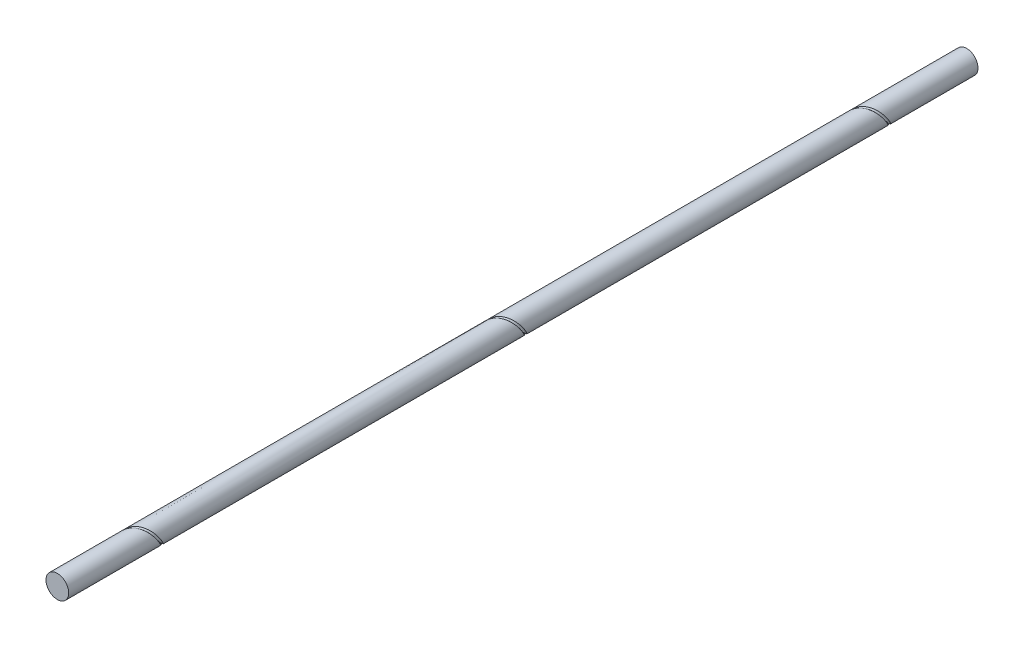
ISO-10303-21;
HEADER;
FILE_DESCRIPTION(('STEP AP214'),'2;1');
FILE_NAME('part.step','',(''),(''),'','','');
FILE_SCHEMA(('AUTOMOTIVE_DESIGN { 1 0 10303 214 1 1 1 1 }'));
ENDSEC;
DATA;
#1=APPLICATION_CONTEXT('core data for automotive mechanical design processes');
#2=APPLICATION_PROTOCOL_DEFINITION('international standard','automotive_design',2000,#1);
#3=PRODUCT_CONTEXT('',#1,'mechanical');
#4=PRODUCT('Part','Part','',(#3));
#5=PRODUCT_RELATED_PRODUCT_CATEGORY('part','',(#4));
#6=PRODUCT_DEFINITION_FORMATION('','',#4);
#7=PRODUCT_DEFINITION_CONTEXT('part definition',#1,'design');
#8=PRODUCT_DEFINITION('design','',#6,#7);
#9=PRODUCT_DEFINITION_SHAPE('','',#8);
#10=(LENGTH_UNIT() NAMED_UNIT(*) SI_UNIT(.MILLI.,.METRE.));
#11=(NAMED_UNIT(*) PLANE_ANGLE_UNIT() SI_UNIT($,.RADIAN.));
#12=(NAMED_UNIT(*) SI_UNIT($,.STERADIAN.) SOLID_ANGLE_UNIT());
#13=UNCERTAINTY_MEASURE_WITH_UNIT(LENGTH_MEASURE(1.E-05),#10,'distance_accuracy_value','');
#14=(GEOMETRIC_REPRESENTATION_CONTEXT(3) GLOBAL_UNCERTAINTY_ASSIGNED_CONTEXT((#13)) GLOBAL_UNIT_ASSIGNED_CONTEXT((#10,
#11,#12)) REPRESENTATION_CONTEXT('',''));
#15=CARTESIAN_POINT('',(0.,0.,0.));
#16=DIRECTION('',(0.,0.,1.));
#17=DIRECTION('',(1.,0.,0.));
#18=AXIS2_PLACEMENT_3D('',#15,#16,#17);
#19=CARTESIAN_POINT('',(0.,0.,2000.));
#20=DIRECTION('',(0.,0.,-1.));
#21=DIRECTION('',(-1.,0.,0.));
#22=AXIS2_PLACEMENT_3D('',#19,#20,#21);
#23=CYLINDRICAL_SURFACE('',#22,25.);
#24=CARTESIAN_POINT('',(-25.,0.,952.958317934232));
#25=CARTESIAN_POINT('',(-25.,-2.31659115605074,954.428906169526));
#26=CARTESIAN_POINT('',(-24.5743274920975,-4.59373794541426,955.89949440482));
#27=CARTESIAN_POINT('',(-24.1486549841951,-6.87088473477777,957.370082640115));
#28=CARTESIAN_POINT('',(-23.3118057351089,-9.03104165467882,958.840670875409));
#29=CARTESIAN_POINT('',(-22.4749564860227,-11.1911985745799,960.311259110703));
#30=CARTESIAN_POINT('',(-21.2554283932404,-13.1608040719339,961.781847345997));
#31=CARTESIAN_POINT('',(-20.035900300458,-15.1304095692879,963.252435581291));
#32=CARTESIAN_POINT('',(-18.4752229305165,-16.8423910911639,964.723023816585));
#33=CARTESIAN_POINT('',(-16.9145455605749,-18.5543726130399,966.193612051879));
#34=CARTESIAN_POINT('',(-15.0658659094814,-19.950430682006,967.664200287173));
#35=CARTESIAN_POINT('',(-13.2171862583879,-21.346488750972,969.134788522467));
#36=CARTESIAN_POINT('',(-11.1434588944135,-22.3790822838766,970.605376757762));
#37=CARTESIAN_POINT('',(-9.06973153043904,-23.4116758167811,972.075964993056));
#38=CARTESIAN_POINT('',(-6.84157475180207,-24.0456410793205,973.54655322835));
#39=CARTESIAN_POINT('',(-4.6134179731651,-24.6796063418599,975.017141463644));
#40=CARTESIAN_POINT('',(-2.30670898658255,-24.8933544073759,976.487729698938));
#41=CARTESIAN_POINT('',(0.,-25.1071024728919,977.958317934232));
#42=CARTESIAN_POINT('',(2.30670898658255,-24.8933544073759,979.428906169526));
#43=CARTESIAN_POINT('',(4.6134179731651,-24.6796063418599,980.89949440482));
#44=CARTESIAN_POINT('',(6.84157475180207,-24.0456410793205,982.370082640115));
#45=CARTESIAN_POINT('',(9.06973153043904,-23.4116758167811,983.840670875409));
#46=CARTESIAN_POINT('',(11.1434588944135,-22.3790822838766,985.311259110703));
#47=CARTESIAN_POINT('',(13.2171862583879,-21.346488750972,986.781847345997));
#48=CARTESIAN_POINT('',(15.0658659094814,-19.950430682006,988.252435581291));
#49=CARTESIAN_POINT('',(16.9145455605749,-18.5543726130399,989.723023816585));
#50=CARTESIAN_POINT('',(18.4752229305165,-16.8423910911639,991.193612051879));
#51=CARTESIAN_POINT('',(20.035900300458,-15.1304095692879,992.664200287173));
#52=CARTESIAN_POINT('',(21.2554283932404,-13.1608040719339,994.134788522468));
#53=CARTESIAN_POINT('',(22.4749564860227,-11.1911985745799,995.605376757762));
#54=CARTESIAN_POINT('',(23.3118057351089,-9.03104165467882,997.075964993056));
#55=CARTESIAN_POINT('',(24.1486549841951,-6.87088473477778,998.54655322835));
#56=CARTESIAN_POINT('',(24.5743274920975,-4.59373794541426,1000.01714146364));
#57=CARTESIAN_POINT('',(25.,-2.31659115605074,1001.48772969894));
#58=CARTESIAN_POINT('',(25.,0.,1002.95831793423));
#59=CARTESIAN_POINT('',(25.,2.31659115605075,1004.42890616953));
#60=CARTESIAN_POINT('',(24.5743274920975,4.59373794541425,1005.89949440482));
#61=CARTESIAN_POINT('',(24.1486549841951,6.87088473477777,1007.37008264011));
#62=CARTESIAN_POINT('',(23.3118057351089,9.03104165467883,1008.84067087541));
#63=CARTESIAN_POINT('',(22.4749564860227,11.1911985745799,1010.3112591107));
#64=CARTESIAN_POINT('',(21.2554283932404,13.1608040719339,1011.781847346));
#65=CARTESIAN_POINT('',(20.035900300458,15.1304095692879,1013.25243558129));
#66=CARTESIAN_POINT('',(18.4752229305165,16.8423910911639,1014.72302381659));
#67=CARTESIAN_POINT('',(16.9145455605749,18.5543726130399,1016.19361205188));
#68=CARTESIAN_POINT('',(15.0658659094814,19.950430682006,1017.66420028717));
#69=CARTESIAN_POINT('',(13.2171862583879,21.346488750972,1019.13478852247));
#70=CARTESIAN_POINT('',(11.1434588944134,22.3790822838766,1020.60537675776));
#71=CARTESIAN_POINT('',(9.06973153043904,23.4116758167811,1022.07596499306));
#72=CARTESIAN_POINT('',(6.84157475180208,24.0456410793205,1023.54655322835));
#73=CARTESIAN_POINT('',(4.61341797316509,24.6796063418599,1025.01714146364));
#74=CARTESIAN_POINT('',(2.30670898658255,24.8933544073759,1026.48772969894));
#75=CARTESIAN_POINT('',(0.,25.1071024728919,1027.95831793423));
#76=CARTESIAN_POINT('',(-2.30670898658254,24.8933544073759,1029.42890616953));
#77=CARTESIAN_POINT('',(-4.6134179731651,24.6796063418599,1030.89949440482));
#78=CARTESIAN_POINT('',(-6.84157475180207,24.0456410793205,1032.37008264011));
#79=CARTESIAN_POINT('',(-9.06973153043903,23.4116758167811,1033.84067087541));
#80=CARTESIAN_POINT('',(-11.1434588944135,22.3790822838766,1035.3112591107));
#81=CARTESIAN_POINT('',(-13.2171862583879,21.346488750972,1036.781847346));
#82=CARTESIAN_POINT('',(-15.0658659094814,19.950430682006,1038.25243558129));
#83=CARTESIAN_POINT('',(-16.9145455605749,18.5543726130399,1039.72302381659));
#84=CARTESIAN_POINT('',(-18.4752229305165,16.8423910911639,1041.19361205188));
#85=CARTESIAN_POINT('',(-20.035900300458,15.1304095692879,1042.66420028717));
#86=CARTESIAN_POINT('',(-21.2554283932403,13.1608040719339,1044.13478852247));
#87=CARTESIAN_POINT('',(-22.4749564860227,11.1911985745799,1045.60537675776));
#88=CARTESIAN_POINT('',(-23.3118057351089,9.03104165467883,1047.07596499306));
#89=CARTESIAN_POINT('',(-24.1486549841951,6.87088473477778,1048.54655322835));
#90=CARTESIAN_POINT('',(-24.5743274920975,4.59373794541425,1050.01714146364));
#91=CARTESIAN_POINT('',(-25.,2.31659115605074,1051.48772969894));
#92=CARTESIAN_POINT('',(-25.,0.,1052.95831793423));
#93=(BOUNDED_CURVE() B_SPLINE_CURVE(2,(#24,#25,#26,#27,#28,#29,#30,#31,#32,#33,#34,#35,#36,#37,
#38,#39,#40,#41,#42,#43,#44,#45,#46,#47,#48,#49,#50,#51,#52,#53,#54,#55,#56,#57,#58,#59,#60,#61,
#62,#63,#64,#65,#66,#67,#68,#69,#70,#71,#72,#73,#74,#75,#76,#77,#78,#79,#80,#81,#82,#83,#84,#85,
#86,#87,#88,#89,#90,#91,#92),.UNSPECIFIED.,.F.,.F.) B_SPLINE_CURVE_WITH_KNOTS((3,2,2,2,2,2,2,2,
2,2,2,2,2,2,2,2,2,2,2,2,2,2,2,2,2,2,2,2,2,2,2,2,2,2,3),(0.,0.0294117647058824,
0.0588235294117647,0.0882352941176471,0.117647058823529,0.147058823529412,0.176470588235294,
0.205882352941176,0.235294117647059,0.264705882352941,0.294117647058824,0.323529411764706,
0.352941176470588,0.382352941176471,0.411764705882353,0.441176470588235,0.470588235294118,0.5,
0.529411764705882,0.558823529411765,0.588235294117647,0.617647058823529,0.647058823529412,
0.676470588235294,0.705882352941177,0.735294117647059,0.764705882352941,0.794117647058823,
0.823529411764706,0.852941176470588,0.882352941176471,0.911764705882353,0.941176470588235,
0.970588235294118,1.),
.UNSPECIFIED.) CURVE() GEOMETRIC_REPRESENTATION_ITEM() RATIONAL_B_SPLINE_CURVE((0.6,
0.59744050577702,0.6,0.59744050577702,0.6,0.59744050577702,0.6,0.59744050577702,0.6,
0.59744050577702,0.6,0.59744050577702,0.6,0.59744050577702,0.6,0.59744050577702,0.6,
0.59744050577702,0.6,0.59744050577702,0.6,0.59744050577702,0.6,0.59744050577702,0.6,
0.59744050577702,0.6,0.59744050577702,0.6,0.59744050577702,0.6,0.59744050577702,0.6,
0.59744050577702,0.6,0.59744050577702,0.6,0.59744050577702,0.6,0.59744050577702,0.6,
0.59744050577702,0.6,0.59744050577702,0.6,0.59744050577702,0.6,0.59744050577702,0.6,
0.59744050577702,0.6,0.59744050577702,0.6,0.59744050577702,0.6,0.59744050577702,0.6,
0.59744050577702,0.6,0.59744050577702,0.6,0.59744050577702,0.6,0.59744050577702,0.6,
0.59744050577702,0.6,0.59744050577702,0.6)) REPRESENTATION_ITEM(''));
#94=CARTESIAN_POINT('',(-25.,0.,1052.95831793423));
#95=VERTEX_POINT('',#94);
#96=CARTESIAN_POINT('',(-24.9999999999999,0.,952.958317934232));
#97=VERTEX_POINT('',#96);
#98=EDGE_CURVE('E114',#95,#97,#93,.F.);
#99=ORIENTED_EDGE('',*,*,#98,.F.);
#100=DIRECTION('',(0.,0.,-1.));
#101=VECTOR('',#100,1.);
#102=CARTESIAN_POINT('',(-25.,0.,2000.));
#103=LINE('',#102,#101);
#104=CARTESIAN_POINT('',(-25.,0.,1047.04168206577));
#105=VERTEX_POINT('',#104);
#106=EDGE_CURVE('E130',#95,#105,#103,.T.);
#107=ORIENTED_EDGE('',*,*,#106,.T.);
#108=CARTESIAN_POINT('',(-25.,0.,947.041682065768));
#109=CARTESIAN_POINT('',(-25.,-2.31659115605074,948.512270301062));
#110=CARTESIAN_POINT('',(-24.5743274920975,-4.59373794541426,949.982858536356));
#111=CARTESIAN_POINT('',(-24.1486549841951,-6.87088473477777,951.45344677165));
#112=CARTESIAN_POINT('',(-23.3118057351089,-9.03104165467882,952.924035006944));
#113=CARTESIAN_POINT('',(-22.4749564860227,-11.1911985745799,954.394623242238));
#114=CARTESIAN_POINT('',(-21.2554283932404,-13.1608040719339,955.865211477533));
#115=CARTESIAN_POINT('',(-20.035900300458,-15.1304095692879,957.335799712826));
#116=CARTESIAN_POINT('',(-18.4752229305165,-16.8423910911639,958.806387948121));
#117=CARTESIAN_POINT('',(-16.9145455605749,-18.5543726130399,960.276976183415));
#118=CARTESIAN_POINT('',(-15.0658659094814,-19.950430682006,961.747564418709));
#119=CARTESIAN_POINT('',(-13.2171862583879,-21.346488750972,963.218152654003));
#120=CARTESIAN_POINT('',(-11.1434588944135,-22.3790822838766,964.688740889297));
#121=CARTESIAN_POINT('',(-9.06973153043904,-23.4116758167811,966.159329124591));
#122=CARTESIAN_POINT('',(-6.84157475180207,-24.0456410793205,967.629917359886));
#123=CARTESIAN_POINT('',(-4.6134179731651,-24.6796063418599,969.100505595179));
#124=CARTESIAN_POINT('',(-2.30670898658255,-24.8933544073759,970.571093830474));
#125=CARTESIAN_POINT('',(0.,-25.1071024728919,972.041682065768));
#126=CARTESIAN_POINT('',(2.30670898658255,-24.8933544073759,973.512270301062));
#127=CARTESIAN_POINT('',(4.6134179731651,-24.6796063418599,974.982858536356));
#128=CARTESIAN_POINT('',(6.84157475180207,-24.0456410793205,976.45344677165));
#129=CARTESIAN_POINT('',(9.06973153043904,-23.4116758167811,977.924035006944));
#130=CARTESIAN_POINT('',(11.1434588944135,-22.3790822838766,979.394623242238));
#131=CARTESIAN_POINT('',(13.2171862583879,-21.346488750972,980.865211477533));
#132=CARTESIAN_POINT('',(15.0658659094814,-19.950430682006,982.335799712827));
#133=CARTESIAN_POINT('',(16.9145455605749,-18.5543726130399,983.80638794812));
#134=CARTESIAN_POINT('',(18.4752229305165,-16.8423910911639,985.276976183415));
#135=CARTESIAN_POINT('',(20.035900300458,-15.1304095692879,986.747564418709));
#136=CARTESIAN_POINT('',(21.2554283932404,-13.1608040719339,988.218152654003));
#137=CARTESIAN_POINT('',(22.4749564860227,-11.1911985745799,989.688740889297));
#138=CARTESIAN_POINT('',(23.3118057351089,-9.03104165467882,991.159329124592));
#139=CARTESIAN_POINT('',(24.1486549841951,-6.87088473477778,992.629917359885));
#140=CARTESIAN_POINT('',(24.5743274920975,-4.59373794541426,994.10050559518));
#141=CARTESIAN_POINT('',(25.,-2.31659115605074,995.571093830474));
#142=CARTESIAN_POINT('',(25.,0.,997.041682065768));
#143=CARTESIAN_POINT('',(25.,2.31659115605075,998.512270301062));
#144=CARTESIAN_POINT('',(24.5743274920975,4.59373794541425,999.982858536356));
#145=CARTESIAN_POINT('',(24.1486549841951,6.87088473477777,1001.45344677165));
#146=CARTESIAN_POINT('',(23.3118057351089,9.03104165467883,1002.92403500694));
#147=CARTESIAN_POINT('',(22.4749564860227,11.1911985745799,1004.39462324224));
#148=CARTESIAN_POINT('',(21.2554283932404,13.1608040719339,1005.86521147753));
#149=CARTESIAN_POINT('',(20.035900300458,15.1304095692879,1007.33579971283));
#150=CARTESIAN_POINT('',(18.4752229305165,16.8423910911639,1008.80638794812));
#151=CARTESIAN_POINT('',(16.9145455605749,18.5543726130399,1010.27697618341));
#152=CARTESIAN_POINT('',(15.0658659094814,19.950430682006,1011.74756441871));
#153=CARTESIAN_POINT('',(13.2171862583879,21.346488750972,1013.218152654));
#154=CARTESIAN_POINT('',(11.1434588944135,22.3790822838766,1014.6887408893));
#155=CARTESIAN_POINT('',(9.06973153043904,23.4116758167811,1016.15932912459));
#156=CARTESIAN_POINT('',(6.84157475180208,24.0456410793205,1017.62991735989));
#157=CARTESIAN_POINT('',(4.61341797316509,24.6796063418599,1019.10050559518));
#158=CARTESIAN_POINT('',(2.30670898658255,24.8933544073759,1020.57109383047));
#159=CARTESIAN_POINT('',(0.,25.1071024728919,1022.04168206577));
#160=CARTESIAN_POINT('',(-2.30670898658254,24.8933544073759,1023.51227030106));
#161=CARTESIAN_POINT('',(-4.6134179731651,24.6796063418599,1024.98285853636));
#162=CARTESIAN_POINT('',(-6.84157475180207,24.0456410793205,1026.45344677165));
#163=CARTESIAN_POINT('',(-9.06973153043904,23.4116758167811,1027.92403500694));
#164=CARTESIAN_POINT('',(-11.1434588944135,22.3790822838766,1029.39462324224));
#165=CARTESIAN_POINT('',(-13.2171862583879,21.346488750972,1030.86521147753));
#166=CARTESIAN_POINT('',(-15.0658659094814,19.950430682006,1032.33579971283));
#167=CARTESIAN_POINT('',(-16.914545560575,18.5543726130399,1033.80638794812));
#168=CARTESIAN_POINT('',(-18.4752229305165,16.8423910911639,1035.27697618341));
#169=CARTESIAN_POINT('',(-20.035900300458,15.1304095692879,1036.74756441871));
#170=CARTESIAN_POINT('',(-21.2554283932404,13.1608040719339,1038.218152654));
#171=CARTESIAN_POINT('',(-22.4749564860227,11.1911985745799,1039.6887408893));
#172=CARTESIAN_POINT('',(-23.3118057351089,9.03104165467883,1041.15932912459));
#173=CARTESIAN_POINT('',(-24.1486549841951,6.87088473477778,1042.62991735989));
#174=CARTESIAN_POINT('',(-24.5743274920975,4.59373794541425,1044.10050559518));
#175=CARTESIAN_POINT('',(-25.,2.31659115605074,1045.57109383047));
#176=CARTESIAN_POINT('',(-25.,0.,1047.04168206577));
#177=(BOUNDED_CURVE() B_SPLINE_CURVE(2,(#108,#109,#110,#111,#112,#113,#114,#115,#116,#117,#118,
#119,#120,#121,#122,#123,#124,#125,#126,#127,#128,#129,#130,#131,#132,#133,#134,#135,#136,#137,
#138,#139,#140,#141,#142,#143,#144,#145,#146,#147,#148,#149,#150,#151,#152,#153,#154,#155,#156,
#157,#158,#159,#160,#161,#162,#163,#164,#165,#166,#167,#168,#169,#170,#171,#172,#173,#174,#175,
#176),.UNSPECIFIED.,.F.,.F.) B_SPLINE_CURVE_WITH_KNOTS((3,2,2,2,2,2,2,2,2,2,2,2,2,2,2,2,2,2,2,2,
2,2,2,2,2,2,2,2,2,2,2,2,2,2,3),(0.,0.0294117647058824,0.0588235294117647,0.0882352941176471,
0.117647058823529,0.147058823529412,0.176470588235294,0.205882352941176,0.235294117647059,
0.264705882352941,0.294117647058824,0.323529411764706,0.352941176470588,0.382352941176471,
0.411764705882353,0.441176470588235,0.470588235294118,0.5,0.529411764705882,0.558823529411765,
0.588235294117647,0.617647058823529,0.647058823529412,0.676470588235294,0.705882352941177,
0.735294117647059,0.764705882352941,0.794117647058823,0.823529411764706,0.852941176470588,
0.882352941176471,0.911764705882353,0.941176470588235,0.970588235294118,1.),
.UNSPECIFIED.) CURVE() GEOMETRIC_REPRESENTATION_ITEM() RATIONAL_B_SPLINE_CURVE((0.6,
0.597440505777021,0.6,0.597440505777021,0.6,0.597440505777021,0.6,0.597440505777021,0.6,
0.597440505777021,0.6,0.597440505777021,0.6,0.597440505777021,0.6,0.597440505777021,0.6,
0.597440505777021,0.6,0.597440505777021,0.6,0.597440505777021,0.6,0.597440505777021,0.6,
0.597440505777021,0.6,0.597440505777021,0.6,0.597440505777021,0.6,0.597440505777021,0.6,
0.597440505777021,0.6,0.597440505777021,0.6,0.597440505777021,0.6,0.597440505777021,0.6,
0.597440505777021,0.6,0.597440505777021,0.6,0.597440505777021,0.6,0.597440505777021,0.6,
0.597440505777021,0.6,0.597440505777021,0.6,0.597440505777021,0.6,0.597440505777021,0.6,
0.597440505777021,0.6,0.597440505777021,0.6,0.597440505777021,0.6,0.597440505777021,0.6,
0.597440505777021,0.6,0.597440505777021,0.6)) REPRESENTATION_ITEM(''));
#178=CARTESIAN_POINT('',(-25.,0.,947.041682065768));
#179=VERTEX_POINT('',#178);
#180=EDGE_CURVE('E134',#105,#179,#177,.F.);
#181=ORIENTED_EDGE('',*,*,#180,.T.);
#182=DIRECTION('',(0.,0.,-1.));
#183=VECTOR('',#182,1.);
#184=CARTESIAN_POINT('',(-25.,0.,2000.));
#185=LINE('',#184,#183);
#186=EDGE_CURVE('E123',#97,#179,#185,.T.);
#187=ORIENTED_EDGE('',*,*,#186,.F.);
#188=EDGE_LOOP('',(#99,#107,#181,#187));
#189=FACE_BOUND('',#188,.T.);
#190=CARTESIAN_POINT('',(0.,0.,0.));
#191=DIRECTION('',(0.,0.,1.));
#192=DIRECTION('',(1.,0.,0.));
#193=AXIS2_PLACEMENT_3D('',#190,#191,#192);
#194=CIRCLE('',#193,25.);
#195=CARTESIAN_POINT('',(25.,0.,0.));
#196=VERTEX_POINT('',#195);
#197=EDGE_CURVE('E168',#196,#196,#194,.T.);
#198=ORIENTED_EDGE('',*,*,#197,.T.);
#199=EDGE_LOOP('',(#198));
#200=FACE_BOUND('',#199,.T.);
#201=CARTESIAN_POINT('',(0.,0.,2000.));
#202=DIRECTION('',(0.,0.,1.));
#203=DIRECTION('',(1.,0.,0.));
#204=AXIS2_PLACEMENT_3D('',#201,#202,#203);
#205=CIRCLE('',#204,25.);
#206=CARTESIAN_POINT('',(25.,0.,2000.));
#207=VERTEX_POINT('',#206);
#208=EDGE_CURVE('E167',#207,#207,#205,.T.);
#209=ORIENTED_EDGE('',*,*,#208,.F.);
#210=EDGE_LOOP('',(#209));
#211=FACE_BOUND('',#210,.T.);
#212=CARTESIAN_POINT('',(-25.,0.,152.958317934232));
#213=CARTESIAN_POINT('',(-25.,-2.31659115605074,154.428906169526));
#214=CARTESIAN_POINT('',(-24.5743274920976,-4.59373794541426,155.89949440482));
#215=CARTESIAN_POINT('',(-24.1486549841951,-6.87088473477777,157.370082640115));
#216=CARTESIAN_POINT('',(-23.3118057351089,-9.03104165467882,158.840670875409));
#217=CARTESIAN_POINT('',(-22.4749564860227,-11.1911985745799,160.311259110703));
#218=CARTESIAN_POINT('',(-21.2554283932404,-13.1608040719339,161.781847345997));
#219=CARTESIAN_POINT('',(-20.035900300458,-15.1304095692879,163.252435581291));
#220=CARTESIAN_POINT('',(-18.4752229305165,-16.8423910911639,164.723023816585));
#221=CARTESIAN_POINT('',(-16.914545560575,-18.55437261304,166.193612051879));
#222=CARTESIAN_POINT('',(-15.0658659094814,-19.950430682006,167.664200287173));
#223=CARTESIAN_POINT('',(-13.2171862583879,-21.346488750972,169.134788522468));
#224=CARTESIAN_POINT('',(-11.1434588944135,-22.3790822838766,170.605376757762));
#225=CARTESIAN_POINT('',(-9.06973153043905,-23.4116758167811,172.075964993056));
#226=CARTESIAN_POINT('',(-6.84157475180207,-24.0456410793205,173.54655322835));
#227=CARTESIAN_POINT('',(-4.6134179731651,-24.6796063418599,175.017141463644));
#228=CARTESIAN_POINT('',(-2.30670898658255,-24.8933544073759,176.487729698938));
#229=CARTESIAN_POINT('',(0.,-25.1071024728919,177.958317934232));
#230=CARTESIAN_POINT('',(2.30670898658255,-24.8933544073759,179.428906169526));
#231=CARTESIAN_POINT('',(4.6134179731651,-24.6796063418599,180.89949440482));
#232=CARTESIAN_POINT('',(6.84157475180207,-24.0456410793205,182.370082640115));
#233=CARTESIAN_POINT('',(9.06973153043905,-23.4116758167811,183.840670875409));
#234=CARTESIAN_POINT('',(11.1434588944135,-22.3790822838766,185.311259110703));
#235=CARTESIAN_POINT('',(13.2171862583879,-21.346488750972,186.781847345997));
#236=CARTESIAN_POINT('',(15.0658659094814,-19.950430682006,188.252435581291));
#237=CARTESIAN_POINT('',(16.914545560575,-18.55437261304,189.723023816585));
#238=CARTESIAN_POINT('',(18.4752229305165,-16.8423910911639,191.193612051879));
#239=CARTESIAN_POINT('',(20.035900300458,-15.1304095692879,192.664200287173));
#240=CARTESIAN_POINT('',(21.2554283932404,-13.1608040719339,194.134788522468));
#241=CARTESIAN_POINT('',(22.4749564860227,-11.1911985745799,195.605376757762));
#242=CARTESIAN_POINT('',(23.3118057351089,-9.03104165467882,197.075964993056));
#243=CARTESIAN_POINT('',(24.1486549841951,-6.87088473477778,198.54655322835));
#244=CARTESIAN_POINT('',(24.5743274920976,-4.59373794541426,200.017141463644));
#245=CARTESIAN_POINT('',(25.,-2.31659115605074,201.487729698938));
#246=CARTESIAN_POINT('',(25.,0.,202.958317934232));
#247=CARTESIAN_POINT('',(25.,2.31659115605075,204.428906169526));
#248=CARTESIAN_POINT('',(24.5743274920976,4.59373794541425,205.89949440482));
#249=CARTESIAN_POINT('',(24.1486549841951,6.87088473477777,207.370082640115));
#250=CARTESIAN_POINT('',(23.3118057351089,9.03104165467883,208.840670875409));
#251=CARTESIAN_POINT('',(22.4749564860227,11.1911985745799,210.311259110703));
#252=CARTESIAN_POINT('',(21.2554283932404,13.1608040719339,211.781847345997));
#253=CARTESIAN_POINT('',(20.035900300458,15.1304095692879,213.252435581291));
#254=CARTESIAN_POINT('',(18.4752229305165,16.8423910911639,214.723023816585));
#255=CARTESIAN_POINT('',(16.914545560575,18.55437261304,216.193612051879));
#256=CARTESIAN_POINT('',(15.0658659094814,19.950430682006,217.664200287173));
#257=CARTESIAN_POINT('',(13.2171862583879,21.346488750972,219.134788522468));
#258=CARTESIAN_POINT('',(11.1434588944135,22.3790822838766,220.605376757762));
#259=CARTESIAN_POINT('',(9.06973153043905,23.4116758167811,222.075964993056));
#260=CARTESIAN_POINT('',(6.84157475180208,24.0456410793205,223.54655322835));
#261=CARTESIAN_POINT('',(4.61341797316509,24.6796063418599,225.017141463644));
#262=CARTESIAN_POINT('',(2.30670898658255,24.8933544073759,226.487729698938));
#263=CARTESIAN_POINT('',(0.,25.1071024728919,227.958317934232));
#264=CARTESIAN_POINT('',(-2.30670898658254,24.8933544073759,229.428906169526));
#265=CARTESIAN_POINT('',(-4.61341797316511,24.6796063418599,230.89949440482));
#266=CARTESIAN_POINT('',(-6.84157475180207,24.0456410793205,232.370082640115));
#267=CARTESIAN_POINT('',(-9.06973153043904,23.4116758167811,233.840670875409));
#268=CARTESIAN_POINT('',(-11.1434588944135,22.3790822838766,235.311259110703));
#269=CARTESIAN_POINT('',(-13.2171862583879,21.346488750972,236.781847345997));
#270=CARTESIAN_POINT('',(-15.0658659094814,19.950430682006,238.252435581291));
#271=CARTESIAN_POINT('',(-16.914545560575,18.5543726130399,239.723023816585));
#272=CARTESIAN_POINT('',(-18.4752229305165,16.8423910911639,241.193612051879));
#273=CARTESIAN_POINT('',(-20.035900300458,15.1304095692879,242.664200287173));
#274=CARTESIAN_POINT('',(-21.2554283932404,13.1608040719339,244.134788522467));
#275=CARTESIAN_POINT('',(-22.4749564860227,11.1911985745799,245.605376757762));
#276=CARTESIAN_POINT('',(-23.3118057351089,9.03104165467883,247.075964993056));
#277=CARTESIAN_POINT('',(-24.1486549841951,6.87088473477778,248.54655322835));
#278=CARTESIAN_POINT('',(-24.5743274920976,4.59373794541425,250.017141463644));
#279=CARTESIAN_POINT('',(-25.,2.31659115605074,251.487729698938));
#280=CARTESIAN_POINT('',(-25.,0.,252.958317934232));
#281=(BOUNDED_CURVE() B_SPLINE_CURVE(2,(#212,#213,#214,#215,#216,#217,#218,#219,#220,#221,#222,
#223,#224,#225,#226,#227,#228,#229,#230,#231,#232,#233,#234,#235,#236,#237,#238,#239,#240,#241,
#242,#243,#244,#245,#246,#247,#248,#249,#250,#251,#252,#253,#254,#255,#256,#257,#258,#259,#260,
#261,#262,#263,#264,#265,#266,#267,#268,#269,#270,#271,#272,#273,#274,#275,#276,#277,#278,#279,
#280),.UNSPECIFIED.,.F.,.F.) B_SPLINE_CURVE_WITH_KNOTS((3,2,2,2,2,2,2,2,2,2,2,2,2,2,2,2,2,2,2,2,
2,2,2,2,2,2,2,2,2,2,2,2,2,2,3),(0.,0.0294117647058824,0.0588235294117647,0.0882352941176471,
0.117647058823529,0.147058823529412,0.176470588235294,0.205882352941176,0.235294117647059,
0.264705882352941,0.294117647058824,0.323529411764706,0.352941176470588,0.382352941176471,
0.411764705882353,0.441176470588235,0.470588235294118,0.5,0.529411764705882,0.558823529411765,
0.588235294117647,0.617647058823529,0.647058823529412,0.676470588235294,0.705882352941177,
0.735294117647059,0.764705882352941,0.794117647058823,0.823529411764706,0.852941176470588,
0.882352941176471,0.911764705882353,0.941176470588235,0.970588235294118,1.),
.UNSPECIFIED.) CURVE() GEOMETRIC_REPRESENTATION_ITEM() RATIONAL_B_SPLINE_CURVE((0.6,
0.597440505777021,0.6,0.597440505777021,0.6,0.597440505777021,0.6,0.597440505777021,0.6,
0.597440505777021,0.6,0.597440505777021,0.6,0.597440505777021,0.6,0.597440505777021,0.6,
0.597440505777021,0.6,0.597440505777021,0.6,0.597440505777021,0.6,0.597440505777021,0.6,
0.597440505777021,0.6,0.597440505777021,0.6,0.597440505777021,0.6,0.597440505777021,0.6,
0.597440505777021,0.6,0.597440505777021,0.6,0.597440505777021,0.6,0.597440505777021,0.6,
0.597440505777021,0.6,0.597440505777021,0.6,0.597440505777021,0.6,0.597440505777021,0.6,
0.597440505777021,0.6,0.597440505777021,0.6,0.597440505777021,0.6,0.597440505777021,0.6,
0.597440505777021,0.6,0.597440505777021,0.6,0.597440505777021,0.6,0.597440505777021,0.6,
0.597440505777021,0.6,0.597440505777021,0.6)) REPRESENTATION_ITEM(''));
#282=CARTESIAN_POINT('',(-25.,0.,252.958317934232));
#283=VERTEX_POINT('',#282);
#284=CARTESIAN_POINT('',(-25.,0.,152.958317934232));
#285=VERTEX_POINT('',#284);
#286=EDGE_CURVE('E140',#283,#285,#281,.F.);
#287=ORIENTED_EDGE('',*,*,#286,.F.);
#288=DIRECTION('',(0.,0.,-1.));
#289=VECTOR('',#288,1.);
#290=CARTESIAN_POINT('',(-25.,0.,2000.));
#291=LINE('',#290,#289);
#292=CARTESIAN_POINT('',(-25.,0.,247.041682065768));
#293=VERTEX_POINT('',#292);
#294=EDGE_CURVE('E157',#283,#293,#291,.T.);
#295=ORIENTED_EDGE('',*,*,#294,.T.);
#296=CARTESIAN_POINT('',(-25.,0.,147.041682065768));
#297=CARTESIAN_POINT('',(-25.,-2.31659115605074,148.512270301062));
#298=CARTESIAN_POINT('',(-24.5743274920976,-4.59373794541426,149.982858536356));
#299=CARTESIAN_POINT('',(-24.1486549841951,-6.87088473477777,151.45344677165));
#300=CARTESIAN_POINT('',(-23.3118057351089,-9.03104165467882,152.924035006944));
#301=CARTESIAN_POINT('',(-22.4749564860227,-11.1911985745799,154.394623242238));
#302=CARTESIAN_POINT('',(-21.2554283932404,-13.1608040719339,155.865211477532));
#303=CARTESIAN_POINT('',(-20.035900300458,-15.1304095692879,157.335799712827));
#304=CARTESIAN_POINT('',(-18.4752229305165,-16.8423910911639,158.806387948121));
#305=CARTESIAN_POINT('',(-16.914545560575,-18.5543726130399,160.276976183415));
#306=CARTESIAN_POINT('',(-15.0658659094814,-19.950430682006,161.747564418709));
#307=CARTESIAN_POINT('',(-13.2171862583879,-21.346488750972,163.218152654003));
#308=CARTESIAN_POINT('',(-11.1434588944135,-22.3790822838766,164.688740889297));
#309=CARTESIAN_POINT('',(-9.06973153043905,-23.4116758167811,166.159329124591));
#310=CARTESIAN_POINT('',(-6.84157475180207,-24.0456410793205,167.629917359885));
#311=CARTESIAN_POINT('',(-4.6134179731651,-24.6796063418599,169.100505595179));
#312=CARTESIAN_POINT('',(-2.30670898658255,-24.8933544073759,170.571093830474));
#313=CARTESIAN_POINT('',(0.,-25.1071024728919,172.041682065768));
#314=CARTESIAN_POINT('',(2.30670898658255,-24.8933544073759,173.512270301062));
#315=CARTESIAN_POINT('',(4.6134179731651,-24.6796063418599,174.982858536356));
#316=CARTESIAN_POINT('',(6.84157475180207,-24.0456410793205,176.45344677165));
#317=CARTESIAN_POINT('',(9.06973153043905,-23.4116758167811,177.924035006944));
#318=CARTESIAN_POINT('',(11.1434588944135,-22.3790822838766,179.394623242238));
#319=CARTESIAN_POINT('',(13.2171862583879,-21.346488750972,180.865211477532));
#320=CARTESIAN_POINT('',(15.0658659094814,-19.950430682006,182.335799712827));
#321=CARTESIAN_POINT('',(16.914545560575,-18.5543726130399,183.806387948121));
#322=CARTESIAN_POINT('',(18.4752229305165,-16.8423910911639,185.276976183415));
#323=CARTESIAN_POINT('',(20.035900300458,-15.1304095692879,186.747564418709));
#324=CARTESIAN_POINT('',(21.2554283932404,-13.1608040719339,188.218152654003));
#325=CARTESIAN_POINT('',(22.4749564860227,-11.1911985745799,189.688740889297));
#326=CARTESIAN_POINT('',(23.3118057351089,-9.03104165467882,191.159329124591));
#327=CARTESIAN_POINT('',(24.1486549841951,-6.87088473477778,192.629917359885));
#328=CARTESIAN_POINT('',(24.5743274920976,-4.59373794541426,194.10050559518));
#329=CARTESIAN_POINT('',(25.,-2.31659115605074,195.571093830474));
#330=CARTESIAN_POINT('',(25.,0.,197.041682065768));
#331=CARTESIAN_POINT('',(25.,2.31659115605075,198.512270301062));
#332=CARTESIAN_POINT('',(24.5743274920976,4.59373794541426,199.982858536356));
#333=CARTESIAN_POINT('',(24.1486549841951,6.87088473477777,201.45344677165));
#334=CARTESIAN_POINT('',(23.3118057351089,9.03104165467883,202.924035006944));
#335=CARTESIAN_POINT('',(22.4749564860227,11.1911985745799,204.394623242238));
#336=CARTESIAN_POINT('',(21.2554283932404,13.1608040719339,205.865211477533));
#337=CARTESIAN_POINT('',(20.035900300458,15.1304095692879,207.335799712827));
#338=CARTESIAN_POINT('',(18.4752229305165,16.8423910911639,208.806387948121));
#339=CARTESIAN_POINT('',(16.914545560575,18.55437261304,210.276976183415));
#340=CARTESIAN_POINT('',(15.0658659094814,19.950430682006,211.747564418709));
#341=CARTESIAN_POINT('',(13.2171862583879,21.346488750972,213.218152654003));
#342=CARTESIAN_POINT('',(11.1434588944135,22.3790822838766,214.688740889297));
#343=CARTESIAN_POINT('',(9.06973153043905,23.4116758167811,216.159329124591));
#344=CARTESIAN_POINT('',(6.84157475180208,24.0456410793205,217.629917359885));
#345=CARTESIAN_POINT('',(4.61341797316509,24.6796063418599,219.10050559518));
#346=CARTESIAN_POINT('',(2.30670898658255,24.8933544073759,220.571093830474));
#347=CARTESIAN_POINT('',(0.,25.1071024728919,222.041682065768));
#348=CARTESIAN_POINT('',(-2.30670898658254,24.8933544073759,223.512270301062));
#349=CARTESIAN_POINT('',(-4.6134179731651,24.6796063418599,224.982858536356));
#350=CARTESIAN_POINT('',(-6.84157475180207,24.0456410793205,226.45344677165));
#351=CARTESIAN_POINT('',(-9.06973153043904,23.4116758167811,227.924035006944));
#352=CARTESIAN_POINT('',(-11.1434588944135,22.3790822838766,229.394623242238));
#353=CARTESIAN_POINT('',(-13.2171862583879,21.346488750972,230.865211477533));
#354=CARTESIAN_POINT('',(-15.0658659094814,19.950430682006,232.335799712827));
#355=CARTESIAN_POINT('',(-16.914545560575,18.5543726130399,233.806387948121));
#356=CARTESIAN_POINT('',(-18.4752229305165,16.8423910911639,235.276976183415));
#357=CARTESIAN_POINT('',(-20.035900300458,15.1304095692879,236.747564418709));
#358=CARTESIAN_POINT('',(-21.2554283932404,13.1608040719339,238.218152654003));
#359=CARTESIAN_POINT('',(-22.4749564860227,11.1911985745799,239.688740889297));
#360=CARTESIAN_POINT('',(-23.3118057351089,9.03104165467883,241.159329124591));
#361=CARTESIAN_POINT('',(-24.1486549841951,6.87088473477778,242.629917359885));
#362=CARTESIAN_POINT('',(-24.5743274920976,4.59373794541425,244.10050559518));
#363=CARTESIAN_POINT('',(-25.,2.31659115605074,245.571093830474));
#364=CARTESIAN_POINT('',(-25.,0.,247.041682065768));
#365=(BOUNDED_CURVE() B_SPLINE_CURVE(2,(#296,#297,#298,#299,#300,#301,#302,#303,#304,#305,#306,
#307,#308,#309,#310,#311,#312,#313,#314,#315,#316,#317,#318,#319,#320,#321,#322,#323,#324,#325,
#326,#327,#328,#329,#330,#331,#332,#333,#334,#335,#336,#337,#338,#339,#340,#341,#342,#343,#344,
#345,#346,#347,#348,#349,#350,#351,#352,#353,#354,#355,#356,#357,#358,#359,#360,#361,#362,#363,
#364),.UNSPECIFIED.,.F.,.F.) B_SPLINE_CURVE_WITH_KNOTS((3,2,2,2,2,2,2,2,2,2,2,2,2,2,2,2,2,2,2,2,
2,2,2,2,2,2,2,2,2,2,2,2,2,2,3),(0.,0.0294117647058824,0.0588235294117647,0.0882352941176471,
0.117647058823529,0.147058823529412,0.176470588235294,0.205882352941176,0.235294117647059,
0.264705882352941,0.294117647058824,0.323529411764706,0.352941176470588,0.382352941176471,
0.411764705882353,0.441176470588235,0.470588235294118,0.5,0.529411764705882,0.558823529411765,
0.588235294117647,0.617647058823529,0.647058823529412,0.676470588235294,0.705882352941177,
0.735294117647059,0.764705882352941,0.794117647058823,0.823529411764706,0.852941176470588,
0.882352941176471,0.911764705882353,0.941176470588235,0.970588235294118,1.),
.UNSPECIFIED.) CURVE() GEOMETRIC_REPRESENTATION_ITEM() RATIONAL_B_SPLINE_CURVE((0.6,
0.597440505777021,0.6,0.597440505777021,0.6,0.597440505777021,0.6,0.597440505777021,0.6,
0.597440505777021,0.6,0.597440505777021,0.6,0.597440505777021,0.6,0.597440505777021,0.6,
0.597440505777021,0.6,0.597440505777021,0.6,0.597440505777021,0.6,0.597440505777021,0.6,
0.597440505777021,0.6,0.597440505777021,0.6,0.597440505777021,0.6,0.597440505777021,0.6,
0.597440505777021,0.6,0.597440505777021,0.6,0.597440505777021,0.6,0.597440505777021,0.6,
0.597440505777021,0.6,0.597440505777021,0.6,0.597440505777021,0.6,0.597440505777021,0.6,
0.597440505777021,0.6,0.597440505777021,0.6,0.597440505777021,0.6,0.597440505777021,0.6,
0.597440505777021,0.6,0.597440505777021,0.6,0.597440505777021,0.6,0.597440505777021,0.6,
0.597440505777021,0.6,0.597440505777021,0.6)) REPRESENTATION_ITEM(''));
#366=CARTESIAN_POINT('',(-25.,0.,147.041682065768));
#367=VERTEX_POINT('',#366);
#368=EDGE_CURVE('E161',#293,#367,#365,.F.);
#369=ORIENTED_EDGE('',*,*,#368,.T.);
#370=DIRECTION('',(0.,0.,-1.));
#371=VECTOR('',#370,1.);
#372=CARTESIAN_POINT('',(-25.,0.,2000.));
#373=LINE('',#372,#371);
#374=EDGE_CURVE('E149',#285,#367,#373,.T.);
#375=ORIENTED_EDGE('',*,*,#374,.F.);
#376=EDGE_LOOP('',(#287,#295,#369,#375));
#377=FACE_BOUND('',#376,.T.);
#378=CARTESIAN_POINT('',(-25.,0.,1752.95831793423));
#379=CARTESIAN_POINT('',(-25.,-2.31659115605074,1754.42890616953));
#380=CARTESIAN_POINT('',(-24.5743274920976,-4.59373794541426,1755.89949440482));
#381=CARTESIAN_POINT('',(-24.1486549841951,-6.87088473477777,1757.37008264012));
#382=CARTESIAN_POINT('',(-23.3118057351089,-9.03104165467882,1758.84067087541));
#383=CARTESIAN_POINT('',(-22.4749564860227,-11.1911985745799,1760.3112591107));
#384=CARTESIAN_POINT('',(-21.2554283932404,-13.1608040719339,1761.781847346));
#385=CARTESIAN_POINT('',(-20.035900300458,-15.1304095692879,1763.25243558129));
#386=CARTESIAN_POINT('',(-18.4752229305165,-16.8423910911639,1764.72302381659));
#387=CARTESIAN_POINT('',(-16.914545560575,-18.5543726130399,1766.19361205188));
#388=CARTESIAN_POINT('',(-15.0658659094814,-19.950430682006,1767.66420028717));
#389=CARTESIAN_POINT('',(-13.2171862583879,-21.346488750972,1769.13478852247));
#390=CARTESIAN_POINT('',(-11.1434588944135,-22.3790822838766,1770.60537675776));
#391=CARTESIAN_POINT('',(-9.06973153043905,-23.4116758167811,1772.07596499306));
#392=CARTESIAN_POINT('',(-6.84157475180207,-24.0456410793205,1773.54655322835));
#393=CARTESIAN_POINT('',(-4.6134179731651,-24.6796063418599,1775.01714146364));
#394=CARTESIAN_POINT('',(-2.30670898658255,-24.8933544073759,1776.48772969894));
#395=CARTESIAN_POINT('',(0.,-25.1071024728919,1777.95831793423));
#396=CARTESIAN_POINT('',(2.30670898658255,-24.8933544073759,1779.42890616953));
#397=CARTESIAN_POINT('',(4.6134179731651,-24.6796063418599,1780.89949440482));
#398=CARTESIAN_POINT('',(6.84157475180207,-24.0456410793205,1782.37008264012));
#399=CARTESIAN_POINT('',(9.06973153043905,-23.4116758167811,1783.84067087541));
#400=CARTESIAN_POINT('',(11.1434588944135,-22.3790822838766,1785.3112591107));
#401=CARTESIAN_POINT('',(13.2171862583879,-21.346488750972,1786.781847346));
#402=CARTESIAN_POINT('',(15.0658659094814,-19.950430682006,1788.25243558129));
#403=CARTESIAN_POINT('',(16.914545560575,-18.5543726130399,1789.72302381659));
#404=CARTESIAN_POINT('',(18.4752229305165,-16.8423910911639,1791.19361205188));
#405=CARTESIAN_POINT('',(20.035900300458,-15.1304095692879,1792.66420028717));
#406=CARTESIAN_POINT('',(21.2554283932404,-13.1608040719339,1794.13478852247));
#407=CARTESIAN_POINT('',(22.4749564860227,-11.1911985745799,1795.60537675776));
#408=CARTESIAN_POINT('',(23.3118057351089,-9.03104165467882,1797.07596499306));
#409=CARTESIAN_POINT('',(24.1486549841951,-6.87088473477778,1798.54655322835));
#410=CARTESIAN_POINT('',(24.5743274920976,-4.59373794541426,1800.01714146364));
#411=CARTESIAN_POINT('',(25.,-2.31659115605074,1801.48772969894));
#412=CARTESIAN_POINT('',(25.,0.,1802.95831793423));
#413=CARTESIAN_POINT('',(25.,2.31659115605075,1804.42890616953));
#414=CARTESIAN_POINT('',(24.5743274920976,4.59373794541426,1805.89949440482));
#415=CARTESIAN_POINT('',(24.1486549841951,6.87088473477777,1807.37008264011));
#416=CARTESIAN_POINT('',(23.3118057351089,9.03104165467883,1808.84067087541));
#417=CARTESIAN_POINT('',(22.4749564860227,11.1911985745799,1810.3112591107));
#418=CARTESIAN_POINT('',(21.2554283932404,13.1608040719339,1811.781847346));
#419=CARTESIAN_POINT('',(20.035900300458,15.1304095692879,1813.25243558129));
#420=CARTESIAN_POINT('',(18.4752229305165,16.8423910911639,1814.72302381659));
#421=CARTESIAN_POINT('',(16.914545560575,18.55437261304,1816.19361205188));
#422=CARTESIAN_POINT('',(15.0658659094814,19.950430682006,1817.66420028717));
#423=CARTESIAN_POINT('',(13.2171862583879,21.346488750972,1819.13478852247));
#424=CARTESIAN_POINT('',(11.1434588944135,22.3790822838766,1820.60537675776));
#425=CARTESIAN_POINT('',(9.06973153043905,23.4116758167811,1822.07596499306));
#426=CARTESIAN_POINT('',(6.84157475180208,24.0456410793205,1823.54655322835));
#427=CARTESIAN_POINT('',(4.61341797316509,24.6796063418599,1825.01714146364));
#428=CARTESIAN_POINT('',(2.30670898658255,24.8933544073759,1826.48772969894));
#429=CARTESIAN_POINT('',(0.,25.1071024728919,1827.95831793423));
#430=CARTESIAN_POINT('',(-2.30670898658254,24.8933544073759,1829.42890616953));
#431=CARTESIAN_POINT('',(-4.6134179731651,24.6796063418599,1830.89949440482));
#432=CARTESIAN_POINT('',(-6.84157475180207,24.0456410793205,1832.37008264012));
#433=CARTESIAN_POINT('',(-9.06973153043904,23.4116758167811,1833.84067087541));
#434=CARTESIAN_POINT('',(-11.1434588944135,22.3790822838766,1835.3112591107));
#435=CARTESIAN_POINT('',(-13.2171862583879,21.346488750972,1836.781847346));
#436=CARTESIAN_POINT('',(-15.0658659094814,19.950430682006,1838.25243558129));
#437=CARTESIAN_POINT('',(-16.914545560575,18.5543726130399,1839.72302381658));
#438=CARTESIAN_POINT('',(-18.4752229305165,16.8423910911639,1841.19361205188));
#439=CARTESIAN_POINT('',(-20.035900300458,15.1304095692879,1842.66420028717));
#440=CARTESIAN_POINT('',(-21.2554283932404,13.1608040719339,1844.13478852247));
#441=CARTESIAN_POINT('',(-22.4749564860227,11.1911985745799,1845.60537675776));
#442=CARTESIAN_POINT('',(-23.3118057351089,9.03104165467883,1847.07596499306));
#443=CARTESIAN_POINT('',(-24.1486549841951,6.87088473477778,1848.54655322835));
#444=CARTESIAN_POINT('',(-24.5743274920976,4.59373794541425,1850.01714146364));
#445=CARTESIAN_POINT('',(-25.,2.31659115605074,1851.48772969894));
#446=CARTESIAN_POINT('',(-25.,0.,1852.95831793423));
#447=(BOUNDED_CURVE() B_SPLINE_CURVE(2,(#378,#379,#380,#381,#382,#383,#384,#385,#386,#387,#388,
#389,#390,#391,#392,#393,#394,#395,#396,#397,#398,#399,#400,#401,#402,#403,#404,#405,#406,#407,
#408,#409,#410,#411,#412,#413,#414,#415,#416,#417,#418,#419,#420,#421,#422,#423,#424,#425,#426,
#427,#428,#429,#430,#431,#432,#433,#434,#435,#436,#437,#438,#439,#440,#441,#442,#443,#444,#445,
#446),.UNSPECIFIED.,.F.,.F.) B_SPLINE_CURVE_WITH_KNOTS((3,2,2,2,2,2,2,2,2,2,2,2,2,2,2,2,2,2,2,2,
2,2,2,2,2,2,2,2,2,2,2,2,2,2,3),(0.,0.0294117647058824,0.0588235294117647,0.0882352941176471,
0.117647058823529,0.147058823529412,0.176470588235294,0.205882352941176,0.235294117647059,
0.264705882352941,0.294117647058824,0.323529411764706,0.352941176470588,0.382352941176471,
0.411764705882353,0.441176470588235,0.470588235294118,0.5,0.529411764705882,0.558823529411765,
0.588235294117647,0.617647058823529,0.647058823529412,0.676470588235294,0.705882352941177,
0.735294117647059,0.764705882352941,0.794117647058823,0.823529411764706,0.852941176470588,
0.882352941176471,0.911764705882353,0.941176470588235,0.970588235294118,1.),
.UNSPECIFIED.) CURVE() GEOMETRIC_REPRESENTATION_ITEM() RATIONAL_B_SPLINE_CURVE((0.6,
0.597440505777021,0.6,0.597440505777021,0.6,0.597440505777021,0.6,0.597440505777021,0.6,
0.597440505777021,0.6,0.597440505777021,0.6,0.597440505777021,0.6,0.597440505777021,0.6,
0.597440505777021,0.6,0.597440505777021,0.6,0.597440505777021,0.6,0.597440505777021,0.6,
0.597440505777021,0.6,0.597440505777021,0.6,0.597440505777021,0.6,0.597440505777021,0.6,
0.597440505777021,0.6,0.597440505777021,0.6,0.597440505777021,0.6,0.597440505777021,0.6,
0.597440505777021,0.6,0.597440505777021,0.6,0.597440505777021,0.6,0.597440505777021,0.6,
0.597440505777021,0.6,0.597440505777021,0.6,0.597440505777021,0.6,0.597440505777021,0.6,
0.597440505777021,0.6,0.597440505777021,0.6,0.597440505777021,0.6,0.597440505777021,0.6,
0.597440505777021,0.6,0.597440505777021,0.6)) REPRESENTATION_ITEM(''));
#448=CARTESIAN_POINT('',(-25.0000000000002,0.,1852.95831793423));
#449=VERTEX_POINT('',#448);
#450=CARTESIAN_POINT('',(-25.0000000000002,0.,1752.95831793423));
#451=VERTEX_POINT('',#450);
#452=EDGE_CURVE('E11',#449,#451,#447,.F.);
#453=ORIENTED_EDGE('',*,*,#452,.F.);
#454=DIRECTION('',(0.,0.,-1.));
#455=VECTOR('',#454,1.);
#456=CARTESIAN_POINT('',(-25.,0.,2000.));
#457=LINE('',#456,#455);
#458=CARTESIAN_POINT('',(-25.0000000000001,0.,1847.04168206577));
#459=VERTEX_POINT('',#458);
#460=EDGE_CURVE('E105',#449,#459,#457,.T.);
#461=ORIENTED_EDGE('',*,*,#460,.T.);
#462=CARTESIAN_POINT('',(-25.,0.,1747.04168206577));
#463=CARTESIAN_POINT('',(-25.,-2.31659115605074,1748.51227030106));
#464=CARTESIAN_POINT('',(-24.5743274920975,-4.59373794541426,1749.98285853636));
#465=CARTESIAN_POINT('',(-24.1486549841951,-6.87088473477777,1751.45344677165));
#466=CARTESIAN_POINT('',(-23.3118057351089,-9.03104165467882,1752.92403500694));
#467=CARTESIAN_POINT('',(-22.4749564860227,-11.1911985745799,1754.39462324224));
#468=CARTESIAN_POINT('',(-21.2554283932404,-13.1608040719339,1755.86521147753));
#469=CARTESIAN_POINT('',(-20.035900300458,-15.1304095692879,1757.33579971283));
#470=CARTESIAN_POINT('',(-18.4752229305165,-16.8423910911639,1758.80638794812));
#471=CARTESIAN_POINT('',(-16.9145455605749,-18.5543726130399,1760.27697618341));
#472=CARTESIAN_POINT('',(-15.0658659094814,-19.950430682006,1761.74756441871));
#473=CARTESIAN_POINT('',(-13.2171862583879,-21.346488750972,1763.218152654));
#474=CARTESIAN_POINT('',(-11.1434588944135,-22.3790822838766,1764.6887408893));
#475=CARTESIAN_POINT('',(-9.06973153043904,-23.4116758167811,1766.15932912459));
#476=CARTESIAN_POINT('',(-6.84157475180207,-24.0456410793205,1767.62991735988));
#477=CARTESIAN_POINT('',(-4.6134179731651,-24.6796063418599,1769.10050559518));
#478=CARTESIAN_POINT('',(-2.30670898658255,-24.8933544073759,1770.57109383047));
#479=CARTESIAN_POINT('',(0.,-25.1071024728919,1772.04168206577));
#480=CARTESIAN_POINT('',(2.30670898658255,-24.8933544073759,1773.51227030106));
#481=CARTESIAN_POINT('',(4.6134179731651,-24.6796063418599,1774.98285853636));
#482=CARTESIAN_POINT('',(6.84157475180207,-24.0456410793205,1776.45344677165));
#483=CARTESIAN_POINT('',(9.06973153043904,-23.4116758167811,1777.92403500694));
#484=CARTESIAN_POINT('',(11.1434588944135,-22.3790822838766,1779.39462324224));
#485=CARTESIAN_POINT('',(13.2171862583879,-21.346488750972,1780.86521147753));
#486=CARTESIAN_POINT('',(15.0658659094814,-19.950430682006,1782.33579971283));
#487=CARTESIAN_POINT('',(16.9145455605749,-18.5543726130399,1783.80638794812));
#488=CARTESIAN_POINT('',(18.4752229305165,-16.8423910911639,1785.27697618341));
#489=CARTESIAN_POINT('',(20.035900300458,-15.1304095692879,1786.74756441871));
#490=CARTESIAN_POINT('',(21.2554283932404,-13.1608040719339,1788.218152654));
#491=CARTESIAN_POINT('',(22.4749564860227,-11.1911985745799,1789.6887408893));
#492=CARTESIAN_POINT('',(23.3118057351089,-9.03104165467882,1791.15932912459));
#493=CARTESIAN_POINT('',(24.1486549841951,-6.87088473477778,1792.62991735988));
#494=CARTESIAN_POINT('',(24.5743274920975,-4.59373794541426,1794.10050559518));
#495=CARTESIAN_POINT('',(25.,-2.31659115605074,1795.57109383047));
#496=CARTESIAN_POINT('',(25.,0.,1797.04168206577));
#497=CARTESIAN_POINT('',(25.,2.31659115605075,1798.51227030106));
#498=CARTESIAN_POINT('',(24.5743274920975,4.59373794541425,1799.98285853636));
#499=CARTESIAN_POINT('',(24.1486549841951,6.87088473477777,1801.45344677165));
#500=CARTESIAN_POINT('',(23.3118057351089,9.03104165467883,1802.92403500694));
#501=CARTESIAN_POINT('',(22.4749564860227,11.1911985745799,1804.39462324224));
#502=CARTESIAN_POINT('',(21.2554283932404,13.1608040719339,1805.86521147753));
#503=CARTESIAN_POINT('',(20.035900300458,15.1304095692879,1807.33579971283));
#504=CARTESIAN_POINT('',(18.4752229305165,16.8423910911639,1808.80638794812));
#505=CARTESIAN_POINT('',(16.9145455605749,18.5543726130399,1810.27697618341));
#506=CARTESIAN_POINT('',(15.0658659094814,19.950430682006,1811.74756441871));
#507=CARTESIAN_POINT('',(13.2171862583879,21.346488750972,1813.218152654));
#508=CARTESIAN_POINT('',(11.1434588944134,22.3790822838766,1814.6887408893));
#509=CARTESIAN_POINT('',(9.06973153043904,23.4116758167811,1816.15932912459));
#510=CARTESIAN_POINT('',(6.84157475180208,24.0456410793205,1817.62991735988));
#511=CARTESIAN_POINT('',(4.61341797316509,24.6796063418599,1819.10050559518));
#512=CARTESIAN_POINT('',(2.30670898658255,24.8933544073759,1820.57109383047));
#513=CARTESIAN_POINT('',(0.,25.1071024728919,1822.04168206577));
#514=CARTESIAN_POINT('',(-2.30670898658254,24.8933544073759,1823.51227030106));
#515=CARTESIAN_POINT('',(-4.6134179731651,24.6796063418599,1824.98285853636));
#516=CARTESIAN_POINT('',(-6.84157475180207,24.0456410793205,1826.45344677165));
#517=CARTESIAN_POINT('',(-9.06973153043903,23.4116758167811,1827.92403500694));
#518=CARTESIAN_POINT('',(-11.1434588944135,22.3790822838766,1829.39462324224));
#519=CARTESIAN_POINT('',(-13.2171862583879,21.346488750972,1830.86521147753));
#520=CARTESIAN_POINT('',(-15.0658659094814,19.950430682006,1832.33579971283));
#521=CARTESIAN_POINT('',(-16.9145455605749,18.5543726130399,1833.80638794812));
#522=CARTESIAN_POINT('',(-18.4752229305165,16.8423910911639,1835.27697618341));
#523=CARTESIAN_POINT('',(-20.035900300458,15.1304095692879,1836.74756441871));
#524=CARTESIAN_POINT('',(-21.2554283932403,13.1608040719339,1838.218152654));
#525=CARTESIAN_POINT('',(-22.4749564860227,11.1911985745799,1839.6887408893));
#526=CARTESIAN_POINT('',(-23.3118057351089,9.03104165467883,1841.15932912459));
#527=CARTESIAN_POINT('',(-24.1486549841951,6.87088473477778,1842.62991735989));
#528=CARTESIAN_POINT('',(-24.5743274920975,4.59373794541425,1844.10050559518));
#529=CARTESIAN_POINT('',(-25.,2.31659115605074,1845.57109383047));
#530=CARTESIAN_POINT('',(-25.,0.,1847.04168206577));
#531=(BOUNDED_CURVE() B_SPLINE_CURVE(2,(#462,#463,#464,#465,#466,#467,#468,#469,#470,#471,#472,
#473,#474,#475,#476,#477,#478,#479,#480,#481,#482,#483,#484,#485,#486,#487,#488,#489,#490,#491,
#492,#493,#494,#495,#496,#497,#498,#499,#500,#501,#502,#503,#504,#505,#506,#507,#508,#509,#510,
#511,#512,#513,#514,#515,#516,#517,#518,#519,#520,#521,#522,#523,#524,#525,#526,#527,#528,#529,
#530),.UNSPECIFIED.,.F.,.F.) B_SPLINE_CURVE_WITH_KNOTS((3,2,2,2,2,2,2,2,2,2,2,2,2,2,2,2,2,2,2,2,
2,2,2,2,2,2,2,2,2,2,2,2,2,2,3),(0.,0.0294117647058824,0.0588235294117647,0.0882352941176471,
0.117647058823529,0.147058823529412,0.176470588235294,0.205882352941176,0.235294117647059,
0.264705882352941,0.294117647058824,0.323529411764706,0.352941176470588,0.382352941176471,
0.411764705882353,0.441176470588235,0.470588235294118,0.5,0.529411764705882,0.558823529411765,
0.588235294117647,0.617647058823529,0.647058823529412,0.676470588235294,0.705882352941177,
0.735294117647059,0.764705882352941,0.794117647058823,0.823529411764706,0.852941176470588,
0.882352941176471,0.911764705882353,0.941176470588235,0.970588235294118,1.),
.UNSPECIFIED.) CURVE() GEOMETRIC_REPRESENTATION_ITEM() RATIONAL_B_SPLINE_CURVE((0.6,
0.59744050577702,0.6,0.59744050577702,0.6,0.59744050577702,0.6,0.59744050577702,0.6,
0.59744050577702,0.6,0.59744050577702,0.6,0.59744050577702,0.6,0.59744050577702,0.6,
0.59744050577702,0.6,0.59744050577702,0.6,0.59744050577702,0.6,0.59744050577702,0.6,
0.59744050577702,0.6,0.59744050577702,0.6,0.59744050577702,0.6,0.59744050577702,0.6,
0.59744050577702,0.6,0.59744050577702,0.6,0.59744050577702,0.6,0.59744050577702,0.6,
0.59744050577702,0.6,0.59744050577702,0.6,0.59744050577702,0.6,0.59744050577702,0.6,
0.59744050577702,0.6,0.59744050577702,0.6,0.59744050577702,0.6,0.59744050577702,0.6,
0.59744050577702,0.6,0.59744050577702,0.6,0.59744050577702,0.6,0.59744050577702,0.6,
0.59744050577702,0.6,0.59744050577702,0.6)) REPRESENTATION_ITEM(''));
#532=CARTESIAN_POINT('',(-25.,0.,1747.04168206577));
#533=VERTEX_POINT('',#532);
#534=EDGE_CURVE('E103',#459,#533,#531,.F.);
#535=ORIENTED_EDGE('',*,*,#534,.T.);
#536=DIRECTION('',(0.,0.,-1.));
#537=VECTOR('',#536,1.);
#538=CARTESIAN_POINT('',(-25.,0.,2000.));
#539=LINE('',#538,#537);
#540=EDGE_CURVE('E49',#451,#533,#539,.T.);
#541=ORIENTED_EDGE('',*,*,#540,.F.);
#542=EDGE_LOOP('',(#453,#461,#535,#541));
#543=FACE_BOUND('',#542,.T.);
#544=ADVANCED_FACE('F39',(#189,#200,#211,#377,#543),#23,.T.);
#545=CARTESIAN_POINT('',(0.,0.,2000.));
#546=DIRECTION('',(0.,0.,1.));
#547=DIRECTION('',(1.,0.,0.));
#548=AXIS2_PLACEMENT_3D('',#545,#546,#547);
#549=PLANE('',#548);
#550=ORIENTED_EDGE('',*,*,#208,.T.);
#551=EDGE_LOOP('',(#550));
#552=FACE_BOUND('',#551,.T.);
#553=ADVANCED_FACE('F215',(#552),#549,.T.);
#554=CARTESIAN_POINT('',(0.,0.,0.));
#555=DIRECTION('',(0.,0.,1.));
#556=DIRECTION('',(1.,0.,0.));
#557=AXIS2_PLACEMENT_3D('',#554,#555,#556);
#558=PLANE('',#557);
#559=ORIENTED_EDGE('',*,*,#197,.F.);
#560=EDGE_LOOP('',(#559));
#561=FACE_BOUND('',#560,.T.);
#562=ADVANCED_FACE('F219',(#561),#558,.F.);
#563=CARTESIAN_POINT('',(-27.646,0.,146.031));
#564=DIRECTION('',(0.,-1.,0.));
#565=DIRECTION('',(0.,0.,-1.));
#566=AXIS2_PLACEMENT_3D('',#563,#564,#565);
#567=PLANE('',#566);
#568=ORIENTED_EDGE('',*,*,#374,.T.);
#569=CARTESIAN_POINT('',(-27.646,0.,150.));
#570=DIRECTION('',(0.,1.,0.));
#571=DIRECTION('',(0.,0.,1.));
#572=AXIS2_PLACEMENT_3D('',#569,#570,#571);
#573=CIRCLE('',#572,3.969);
#574=EDGE_CURVE('E179',#285,#367,#573,.T.);
#575=ORIENTED_EDGE('',*,*,#574,.F.);
#576=EDGE_LOOP('',(#568,#575));
#577=FACE_BOUND('',#576,.T.);
#578=ADVANCED_FACE('F225',(#577),#567,.T.);
#579=CARTESIAN_POINT('',(-27.646,0.,246.031));
#580=DIRECTION('',(0.,-1.,0.));
#581=DIRECTION('',(0.,0.,-1.));
#582=AXIS2_PLACEMENT_3D('',#579,#580,#581);
#583=PLANE('',#582);
#584=CARTESIAN_POINT('',(-27.646,0.,250.));
#585=DIRECTION('',(0.,-1.,0.));
#586=DIRECTION('',(0.,0.,1.));
#587=AXIS2_PLACEMENT_3D('',#584,#585,#586);
#588=CIRCLE('',#587,3.969);
#589=EDGE_CURVE('E175',#293,#283,#588,.T.);
#590=ORIENTED_EDGE('',*,*,#589,.F.);
#591=ORIENTED_EDGE('',*,*,#294,.F.);
#592=EDGE_LOOP('',(#590,#591));
#593=FACE_BOUND('',#592,.T.);
#594=ADVANCED_FACE('F210',(#593),#583,.F.);
#595=CARTESIAN_POINT('',(-27.646,0.,153.969));
#596=CARTESIAN_POINT('',(-27.646,-2.56177916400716,155.439588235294));
#597=CARTESIAN_POINT('',(-27.1752743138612,-5.0799391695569,156.910176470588));
#598=CARTESIAN_POINT('',(-26.7045486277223,-7.59809917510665,158.380764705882));
#599=CARTESIAN_POINT('',(-25.7791272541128,-9.98688710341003,159.851352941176));
#600=CARTESIAN_POINT('',(-24.8537058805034,-12.3756750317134,161.321941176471));
#601=CARTESIAN_POINT('',(-23.5051029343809,-14.5537435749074,162.792529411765));
#602=CARTESIAN_POINT('',(-22.1564999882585,-16.7318121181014,164.263117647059));
#603=CARTESIAN_POINT('',(-20.4306405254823,-18.6249897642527,165.733705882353));
#604=CARTESIAN_POINT('',(-18.7047810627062,-20.5181674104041,167.204294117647));
#605=CARTESIAN_POINT('',(-16.6604371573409,-22.0619842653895,168.674882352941));
#606=CARTESIAN_POINT('',(-14.6160932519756,-23.6058011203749,170.145470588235));
#607=CARTESIAN_POINT('',(-12.3228825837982,-24.7476843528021,171.616058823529));
#608=CARTESIAN_POINT('',(-10.0296719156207,-25.8895675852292,173.086647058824));
#609=CARTESIAN_POINT('',(-7.5656870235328,-26.5906317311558,174.557235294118));
#610=CARTESIAN_POINT('',(-5.10170213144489,-27.2916958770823,176.027823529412));
#611=CARTESIAN_POINT('',(-2.55085106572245,-27.5280670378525,177.498411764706));
#612=CARTESIAN_POINT('',(0.,-27.7644381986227,178.969));
#613=CARTESIAN_POINT('',(2.55085106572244,-27.5280670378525,180.439588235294));
#614=CARTESIAN_POINT('',(5.1017021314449,-27.2916958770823,181.910176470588));
#615=CARTESIAN_POINT('',(7.5656870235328,-26.5906317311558,183.380764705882));
#616=CARTESIAN_POINT('',(10.0296719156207,-25.8895675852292,184.851352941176));
#617=CARTESIAN_POINT('',(12.3228825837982,-24.7476843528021,186.321941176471));
#618=CARTESIAN_POINT('',(14.6160932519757,-23.6058011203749,187.792529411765));
#619=CARTESIAN_POINT('',(16.6604371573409,-22.0619842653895,189.263117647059));
#620=CARTESIAN_POINT('',(18.7047810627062,-20.5181674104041,190.733705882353));
#621=CARTESIAN_POINT('',(20.4306405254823,-18.6249897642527,192.204294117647));
#622=CARTESIAN_POINT('',(22.1564999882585,-16.7318121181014,193.674882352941));
#623=CARTESIAN_POINT('',(23.5051029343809,-14.5537435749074,195.145470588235));
#624=CARTESIAN_POINT('',(24.8537058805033,-12.3756750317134,196.616058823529));
#625=CARTESIAN_POINT('',(25.7791272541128,-9.98688710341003,198.086647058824));
#626=CARTESIAN_POINT('',(26.7045486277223,-7.59809917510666,199.557235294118));
#627=CARTESIAN_POINT('',(27.1752743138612,-5.0799391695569,201.027823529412));
#628=CARTESIAN_POINT('',(27.646,-2.56177916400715,202.498411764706));
#629=CARTESIAN_POINT('',(27.646,0.,203.969));
#630=CARTESIAN_POINT('',(27.646,2.56177916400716,205.439588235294));
#631=CARTESIAN_POINT('',(27.1752743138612,5.0799391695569,206.910176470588));
#632=CARTESIAN_POINT('',(26.7045486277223,7.59809917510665,208.380764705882));
#633=CARTESIAN_POINT('',(25.7791272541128,9.98688710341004,209.851352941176));
#634=CARTESIAN_POINT('',(24.8537058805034,12.3756750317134,211.321941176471));
#635=CARTESIAN_POINT('',(23.5051029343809,14.5537435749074,212.792529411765));
#636=CARTESIAN_POINT('',(22.1564999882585,16.7318121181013,214.263117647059));
#637=CARTESIAN_POINT('',(20.4306405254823,18.6249897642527,215.733705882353));
#638=CARTESIAN_POINT('',(18.7047810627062,20.5181674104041,217.204294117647));
#639=CARTESIAN_POINT('',(16.6604371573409,22.0619842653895,218.674882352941));
#640=CARTESIAN_POINT('',(14.6160932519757,23.6058011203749,220.145470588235));
#641=CARTESIAN_POINT('',(12.3228825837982,24.7476843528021,221.616058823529));
#642=CARTESIAN_POINT('',(10.0296719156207,25.8895675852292,223.086647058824));
#643=CARTESIAN_POINT('',(7.56568702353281,26.5906317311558,224.557235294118));
#644=CARTESIAN_POINT('',(5.10170213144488,27.2916958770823,226.027823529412));
#645=CARTESIAN_POINT('',(2.55085106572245,27.5280670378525,227.498411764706));
#646=CARTESIAN_POINT('',(0.,27.7644381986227,228.969));
#647=CARTESIAN_POINT('',(-2.55085106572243,27.5280670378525,230.439588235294));
#648=CARTESIAN_POINT('',(-5.1017021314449,27.2916958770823,231.910176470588));
#649=CARTESIAN_POINT('',(-7.5656870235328,26.5906317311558,233.380764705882));
#650=CARTESIAN_POINT('',(-10.0296719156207,25.8895675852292,234.851352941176));
#651=CARTESIAN_POINT('',(-12.3228825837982,24.7476843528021,236.321941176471));
#652=CARTESIAN_POINT('',(-14.6160932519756,23.6058011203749,237.792529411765));
#653=CARTESIAN_POINT('',(-16.6604371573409,22.0619842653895,239.263117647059));
#654=CARTESIAN_POINT('',(-18.7047810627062,20.5181674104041,240.733705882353));
#655=CARTESIAN_POINT('',(-20.4306405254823,18.6249897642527,242.204294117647));
#656=CARTESIAN_POINT('',(-22.1564999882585,16.7318121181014,243.674882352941));
#657=CARTESIAN_POINT('',(-23.5051029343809,14.5537435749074,245.145470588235));
#658=CARTESIAN_POINT('',(-24.8537058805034,12.3756750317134,246.616058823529));
#659=CARTESIAN_POINT('',(-25.7791272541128,9.98688710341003,248.086647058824));
#660=CARTESIAN_POINT('',(-26.7045486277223,7.59809917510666,249.557235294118));
#661=CARTESIAN_POINT('',(-27.1752743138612,5.0799391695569,251.027823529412));
#662=CARTESIAN_POINT('',(-27.646,2.56177916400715,252.498411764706));
#663=CARTESIAN_POINT('',(-27.646,0.,253.969));
#664=CARTESIAN_POINT('',(-19.708,0.,153.969));
#665=CARTESIAN_POINT('',(-19.708,-1.82621514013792,155.439588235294));
#666=CARTESIAN_POINT('',(-19.3724338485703,-3.62133549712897,156.910176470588));
#667=CARTESIAN_POINT('',(-19.0368676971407,-5.41645585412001,158.380764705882));
#668=CARTESIAN_POINT('',(-18.377162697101,-7.11935075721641,159.851352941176));
#669=CARTESIAN_POINT('',(-17.7174576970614,-8.82224566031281,161.321941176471));
#670=CARTESIAN_POINT('',(-16.7560793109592,-10.3749250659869,162.792529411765));
#671=CARTESIAN_POINT('',(-15.7947009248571,-11.9276044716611,164.263117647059));
#672=CARTESIAN_POINT('',(-14.5643877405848,-13.2771937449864,165.733705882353));
#673=CARTESIAN_POINT('',(-13.3340745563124,-14.6267830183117,167.204294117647));
#674=CARTESIAN_POINT('',(-11.8767234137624,-15.727323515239,168.674882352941));
#675=CARTESIAN_POINT('',(-10.4193722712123,-16.8278640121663,170.145470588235));
#676=CARTESIAN_POINT('',(-8.78461151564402,-17.6418781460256,171.616058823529));
#677=CARTESIAN_POINT('',(-7.14985076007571,-18.4558922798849,173.086647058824));
#678=CARTESIAN_POINT('',(-5.39335020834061,-18.9556597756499,174.557235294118));
#679=CARTESIAN_POINT('',(-3.63684965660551,-19.455427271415,176.027823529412));
#680=CARTESIAN_POINT('',(-1.81842482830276,-19.6239291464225,177.498411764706));
#681=CARTESIAN_POINT('',(0.,-19.7924310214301,178.969));
#682=CARTESIAN_POINT('',(1.81842482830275,-19.6239291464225,180.439588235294));
#683=CARTESIAN_POINT('',(3.63684965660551,-19.455427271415,181.910176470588));
#684=CARTESIAN_POINT('',(5.39335020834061,-18.9556597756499,183.380764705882));
#685=CARTESIAN_POINT('',(7.14985076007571,-18.4558922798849,184.851352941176));
#686=CARTESIAN_POINT('',(8.78461151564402,-17.6418781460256,186.321941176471));
#687=CARTESIAN_POINT('',(10.4193722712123,-16.8278640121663,187.792529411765));
#688=CARTESIAN_POINT('',(11.8767234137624,-15.727323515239,189.263117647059));
#689=CARTESIAN_POINT('',(13.3340745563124,-14.6267830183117,190.733705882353));
#690=CARTESIAN_POINT('',(14.5643877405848,-13.2771937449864,192.204294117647));
#691=CARTESIAN_POINT('',(15.7947009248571,-11.9276044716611,193.674882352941));
#692=CARTESIAN_POINT('',(16.7560793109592,-10.3749250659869,195.145470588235));
#693=CARTESIAN_POINT('',(17.7174576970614,-8.82224566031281,196.616058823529));
#694=CARTESIAN_POINT('',(18.377162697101,-7.11935075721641,198.086647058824));
#695=CARTESIAN_POINT('',(19.0368676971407,-5.41645585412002,199.557235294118));
#696=CARTESIAN_POINT('',(19.3724338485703,-3.62133549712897,201.027823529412));
#697=CARTESIAN_POINT('',(19.708,-1.82621514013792,202.498411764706));
#698=CARTESIAN_POINT('',(19.708,0.,203.969));
#699=CARTESIAN_POINT('',(19.708,1.82621514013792,205.439588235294));
#700=CARTESIAN_POINT('',(19.3724338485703,3.62133549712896,206.910176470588));
#701=CARTESIAN_POINT('',(19.0368676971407,5.41645585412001,208.380764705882));
#702=CARTESIAN_POINT('',(18.377162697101,7.11935075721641,209.851352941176));
#703=CARTESIAN_POINT('',(17.7174576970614,8.82224566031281,211.321941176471));
#704=CARTESIAN_POINT('',(16.7560793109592,10.3749250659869,212.792529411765));
#705=CARTESIAN_POINT('',(15.7947009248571,11.927604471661,214.263117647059));
#706=CARTESIAN_POINT('',(14.5643877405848,13.2771937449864,215.733705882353));
#707=CARTESIAN_POINT('',(13.3340745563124,14.6267830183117,217.204294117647));
#708=CARTESIAN_POINT('',(11.8767234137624,15.727323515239,218.674882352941));
#709=CARTESIAN_POINT('',(10.4193722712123,16.8278640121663,220.145470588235));
#710=CARTESIAN_POINT('',(8.78461151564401,17.6418781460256,221.616058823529));
#711=CARTESIAN_POINT('',(7.14985076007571,18.4558922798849,223.086647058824));
#712=CARTESIAN_POINT('',(5.39335020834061,18.9556597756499,224.557235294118));
#713=CARTESIAN_POINT('',(3.63684965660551,19.455427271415,226.027823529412));
#714=CARTESIAN_POINT('',(1.81842482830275,19.6239291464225,227.498411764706));
#715=CARTESIAN_POINT('',(0.,19.7924310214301,228.969));
#716=CARTESIAN_POINT('',(-1.81842482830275,19.6239291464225,230.439588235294));
#717=CARTESIAN_POINT('',(-3.63684965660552,19.455427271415,231.910176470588));
#718=CARTESIAN_POINT('',(-5.39335020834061,18.9556597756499,233.380764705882));
#719=CARTESIAN_POINT('',(-7.1498507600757,18.4558922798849,234.851352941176));
#720=CARTESIAN_POINT('',(-8.78461151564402,17.6418781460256,236.321941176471));
#721=CARTESIAN_POINT('',(-10.4193722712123,16.8278640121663,237.792529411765));
#722=CARTESIAN_POINT('',(-11.8767234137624,15.727323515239,239.263117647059));
#723=CARTESIAN_POINT('',(-13.3340745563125,14.6267830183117,240.733705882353));
#724=CARTESIAN_POINT('',(-14.5643877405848,13.2771937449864,242.204294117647));
#725=CARTESIAN_POINT('',(-15.7947009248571,11.9276044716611,243.674882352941));
#726=CARTESIAN_POINT('',(-16.7560793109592,10.3749250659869,245.145470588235));
#727=CARTESIAN_POINT('',(-17.7174576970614,8.82224566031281,246.616058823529));
#728=CARTESIAN_POINT('',(-18.377162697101,7.11935075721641,248.086647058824));
#729=CARTESIAN_POINT('',(-19.0368676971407,5.41645585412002,249.557235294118));
#730=CARTESIAN_POINT('',(-19.3724338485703,3.62133549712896,251.027823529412));
#731=CARTESIAN_POINT('',(-19.708,1.82621514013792,252.498411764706));
#732=CARTESIAN_POINT('',(-19.708,0.,253.969));
#733=CARTESIAN_POINT('',(-19.708,0.,146.031));
#734=CARTESIAN_POINT('',(-19.708,-1.82621514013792,147.501588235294));
#735=CARTESIAN_POINT('',(-19.3724338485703,-3.62133549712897,148.972176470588));
#736=CARTESIAN_POINT('',(-19.0368676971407,-5.41645585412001,150.442764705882));
#737=CARTESIAN_POINT('',(-18.377162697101,-7.11935075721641,151.913352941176));
#738=CARTESIAN_POINT('',(-17.7174576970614,-8.82224566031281,153.383941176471));
#739=CARTESIAN_POINT('',(-16.7560793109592,-10.3749250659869,154.854529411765));
#740=CARTESIAN_POINT('',(-15.7947009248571,-11.9276044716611,156.325117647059));
#741=CARTESIAN_POINT('',(-14.5643877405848,-13.2771937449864,157.795705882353));
#742=CARTESIAN_POINT('',(-13.3340745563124,-14.6267830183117,159.266294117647));
#743=CARTESIAN_POINT('',(-11.8767234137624,-15.727323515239,160.736882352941));
#744=CARTESIAN_POINT('',(-10.4193722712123,-16.8278640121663,162.207470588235));
#745=CARTESIAN_POINT('',(-8.78461151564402,-17.6418781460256,163.678058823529));
#746=CARTESIAN_POINT('',(-7.14985076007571,-18.4558922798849,165.148647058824));
#747=CARTESIAN_POINT('',(-5.39335020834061,-18.9556597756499,166.619235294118));
#748=CARTESIAN_POINT('',(-3.63684965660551,-19.455427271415,168.089823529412));
#749=CARTESIAN_POINT('',(-1.81842482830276,-19.6239291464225,169.560411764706));
#750=CARTESIAN_POINT('',(0.,-19.7924310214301,171.031));
#751=CARTESIAN_POINT('',(1.81842482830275,-19.6239291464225,172.501588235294));
#752=CARTESIAN_POINT('',(3.63684965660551,-19.455427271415,173.972176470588));
#753=CARTESIAN_POINT('',(5.39335020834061,-18.9556597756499,175.442764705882));
#754=CARTESIAN_POINT('',(7.14985076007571,-18.4558922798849,176.913352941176));
#755=CARTESIAN_POINT('',(8.78461151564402,-17.6418781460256,178.383941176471));
#756=CARTESIAN_POINT('',(10.4193722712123,-16.8278640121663,179.854529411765));
#757=CARTESIAN_POINT('',(11.8767234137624,-15.727323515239,181.325117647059));
#758=CARTESIAN_POINT('',(13.3340745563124,-14.6267830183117,182.795705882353));
#759=CARTESIAN_POINT('',(14.5643877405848,-13.2771937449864,184.266294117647));
#760=CARTESIAN_POINT('',(15.7947009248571,-11.9276044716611,185.736882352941));
#761=CARTESIAN_POINT('',(16.7560793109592,-10.3749250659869,187.207470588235));
#762=CARTESIAN_POINT('',(17.7174576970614,-8.82224566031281,188.678058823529));
#763=CARTESIAN_POINT('',(18.377162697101,-7.11935075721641,190.148647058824));
#764=CARTESIAN_POINT('',(19.0368676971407,-5.41645585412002,191.619235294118));
#765=CARTESIAN_POINT('',(19.3724338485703,-3.62133549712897,193.089823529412));
#766=CARTESIAN_POINT('',(19.708,-1.82621514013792,194.560411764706));
#767=CARTESIAN_POINT('',(19.708,0.,196.031));
#768=CARTESIAN_POINT('',(19.708,1.82621514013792,197.501588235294));
#769=CARTESIAN_POINT('',(19.3724338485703,3.62133549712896,198.972176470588));
#770=CARTESIAN_POINT('',(19.0368676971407,5.41645585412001,200.442764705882));
#771=CARTESIAN_POINT('',(18.377162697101,7.11935075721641,201.913352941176));
#772=CARTESIAN_POINT('',(17.7174576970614,8.82224566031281,203.383941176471));
#773=CARTESIAN_POINT('',(16.7560793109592,10.3749250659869,204.854529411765));
#774=CARTESIAN_POINT('',(15.7947009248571,11.927604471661,206.325117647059));
#775=CARTESIAN_POINT('',(14.5643877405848,13.2771937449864,207.795705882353));
#776=CARTESIAN_POINT('',(13.3340745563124,14.6267830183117,209.266294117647));
#777=CARTESIAN_POINT('',(11.8767234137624,15.727323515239,210.736882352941));
#778=CARTESIAN_POINT('',(10.4193722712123,16.8278640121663,212.207470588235));
#779=CARTESIAN_POINT('',(8.78461151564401,17.6418781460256,213.678058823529));
#780=CARTESIAN_POINT('',(7.14985076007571,18.4558922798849,215.148647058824));
#781=CARTESIAN_POINT('',(5.39335020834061,18.9556597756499,216.619235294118));
#782=CARTESIAN_POINT('',(3.63684965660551,19.455427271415,218.089823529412));
#783=CARTESIAN_POINT('',(1.81842482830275,19.6239291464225,219.560411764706));
#784=CARTESIAN_POINT('',(0.,19.7924310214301,221.031));
#785=CARTESIAN_POINT('',(-1.81842482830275,19.6239291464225,222.501588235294));
#786=CARTESIAN_POINT('',(-3.63684965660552,19.455427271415,223.972176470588));
#787=CARTESIAN_POINT('',(-5.39335020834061,18.9556597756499,225.442764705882));
#788=CARTESIAN_POINT('',(-7.1498507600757,18.4558922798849,226.913352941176));
#789=CARTESIAN_POINT('',(-8.78461151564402,17.6418781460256,228.383941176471));
#790=CARTESIAN_POINT('',(-10.4193722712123,16.8278640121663,229.854529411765));
#791=CARTESIAN_POINT('',(-11.8767234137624,15.727323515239,231.325117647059));
#792=CARTESIAN_POINT('',(-13.3340745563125,14.6267830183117,232.795705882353));
#793=CARTESIAN_POINT('',(-14.5643877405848,13.2771937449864,234.266294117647));
#794=CARTESIAN_POINT('',(-15.7947009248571,11.9276044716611,235.736882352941));
#795=CARTESIAN_POINT('',(-16.7560793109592,10.3749250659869,237.207470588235));
#796=CARTESIAN_POINT('',(-17.7174576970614,8.82224566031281,238.678058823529));
#797=CARTESIAN_POINT('',(-18.377162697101,7.11935075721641,240.148647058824));
#798=CARTESIAN_POINT('',(-19.0368676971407,5.41645585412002,241.619235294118));
#799=CARTESIAN_POINT('',(-19.3724338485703,3.62133549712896,243.089823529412));
#800=CARTESIAN_POINT('',(-19.708,1.82621514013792,244.560411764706));
#801=CARTESIAN_POINT('',(-19.708,0.,246.031));
#802=CARTESIAN_POINT('',(-27.646,0.,146.031));
#803=CARTESIAN_POINT('',(-27.646,-2.56177916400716,147.501588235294));
#804=CARTESIAN_POINT('',(-27.1752743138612,-5.0799391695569,148.972176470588));
#805=CARTESIAN_POINT('',(-26.7045486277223,-7.59809917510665,150.442764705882));
#806=CARTESIAN_POINT('',(-25.7791272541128,-9.98688710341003,151.913352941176));
#807=CARTESIAN_POINT('',(-24.8537058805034,-12.3756750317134,153.383941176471));
#808=CARTESIAN_POINT('',(-23.5051029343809,-14.5537435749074,154.854529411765));
#809=CARTESIAN_POINT('',(-22.1564999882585,-16.7318121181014,156.325117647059));
#810=CARTESIAN_POINT('',(-20.4306405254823,-18.6249897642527,157.795705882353));
#811=CARTESIAN_POINT('',(-18.7047810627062,-20.5181674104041,159.266294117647));
#812=CARTESIAN_POINT('',(-16.6604371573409,-22.0619842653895,160.736882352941));
#813=CARTESIAN_POINT('',(-14.6160932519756,-23.6058011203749,162.207470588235));
#814=CARTESIAN_POINT('',(-12.3228825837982,-24.7476843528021,163.678058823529));
#815=CARTESIAN_POINT('',(-10.0296719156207,-25.8895675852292,165.148647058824));
#816=CARTESIAN_POINT('',(-7.5656870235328,-26.5906317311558,166.619235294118));
#817=CARTESIAN_POINT('',(-5.10170213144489,-27.2916958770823,168.089823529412));
#818=CARTESIAN_POINT('',(-2.55085106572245,-27.5280670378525,169.560411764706));
#819=CARTESIAN_POINT('',(0.,-27.7644381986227,171.031));
#820=CARTESIAN_POINT('',(2.55085106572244,-27.5280670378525,172.501588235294));
#821=CARTESIAN_POINT('',(5.1017021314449,-27.2916958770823,173.972176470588));
#822=CARTESIAN_POINT('',(7.5656870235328,-26.5906317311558,175.442764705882));
#823=CARTESIAN_POINT('',(10.0296719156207,-25.8895675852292,176.913352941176));
#824=CARTESIAN_POINT('',(12.3228825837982,-24.7476843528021,178.383941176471));
#825=CARTESIAN_POINT('',(14.6160932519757,-23.6058011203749,179.854529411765));
#826=CARTESIAN_POINT('',(16.6604371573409,-22.0619842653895,181.325117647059));
#827=CARTESIAN_POINT('',(18.7047810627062,-20.5181674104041,182.795705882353));
#828=CARTESIAN_POINT('',(20.4306405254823,-18.6249897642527,184.266294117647));
#829=CARTESIAN_POINT('',(22.1564999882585,-16.7318121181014,185.736882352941));
#830=CARTESIAN_POINT('',(23.5051029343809,-14.5537435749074,187.207470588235));
#831=CARTESIAN_POINT('',(24.8537058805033,-12.3756750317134,188.678058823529));
#832=CARTESIAN_POINT('',(25.7791272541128,-9.98688710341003,190.148647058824));
#833=CARTESIAN_POINT('',(26.7045486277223,-7.59809917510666,191.619235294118));
#834=CARTESIAN_POINT('',(27.1752743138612,-5.0799391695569,193.089823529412));
#835=CARTESIAN_POINT('',(27.646,-2.56177916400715,194.560411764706));
#836=CARTESIAN_POINT('',(27.646,0.,196.031));
#837=CARTESIAN_POINT('',(27.646,2.56177916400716,197.501588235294));
#838=CARTESIAN_POINT('',(27.1752743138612,5.0799391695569,198.972176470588));
#839=CARTESIAN_POINT('',(26.7045486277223,7.59809917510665,200.442764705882));
#840=CARTESIAN_POINT('',(25.7791272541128,9.98688710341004,201.913352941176));
#841=CARTESIAN_POINT('',(24.8537058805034,12.3756750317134,203.383941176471));
#842=CARTESIAN_POINT('',(23.5051029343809,14.5537435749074,204.854529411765));
#843=CARTESIAN_POINT('',(22.1564999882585,16.7318121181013,206.325117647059));
#844=CARTESIAN_POINT('',(20.4306405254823,18.6249897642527,207.795705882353));
#845=CARTESIAN_POINT('',(18.7047810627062,20.5181674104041,209.266294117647));
#846=CARTESIAN_POINT('',(16.6604371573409,22.0619842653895,210.736882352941));
#847=CARTESIAN_POINT('',(14.6160932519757,23.6058011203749,212.207470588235));
#848=CARTESIAN_POINT('',(12.3228825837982,24.7476843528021,213.678058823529));
#849=CARTESIAN_POINT('',(10.0296719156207,25.8895675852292,215.148647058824));
#850=CARTESIAN_POINT('',(7.56568702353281,26.5906317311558,216.619235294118));
#851=CARTESIAN_POINT('',(5.10170213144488,27.2916958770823,218.089823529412));
#852=CARTESIAN_POINT('',(2.55085106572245,27.5280670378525,219.560411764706));
#853=CARTESIAN_POINT('',(0.,27.7644381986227,221.031));
#854=CARTESIAN_POINT('',(-2.55085106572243,27.5280670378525,222.501588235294));
#855=CARTESIAN_POINT('',(-5.1017021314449,27.2916958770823,223.972176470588));
#856=CARTESIAN_POINT('',(-7.5656870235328,26.5906317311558,225.442764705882));
#857=CARTESIAN_POINT('',(-10.0296719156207,25.8895675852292,226.913352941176));
#858=CARTESIAN_POINT('',(-12.3228825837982,24.7476843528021,228.383941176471));
#859=CARTESIAN_POINT('',(-14.6160932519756,23.6058011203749,229.854529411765));
#860=CARTESIAN_POINT('',(-16.6604371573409,22.0619842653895,231.325117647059));
#861=CARTESIAN_POINT('',(-18.7047810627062,20.5181674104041,232.795705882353));
#862=CARTESIAN_POINT('',(-20.4306405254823,18.6249897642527,234.266294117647));
#863=CARTESIAN_POINT('',(-22.1564999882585,16.7318121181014,235.736882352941));
#864=CARTESIAN_POINT('',(-23.5051029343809,14.5537435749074,237.207470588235));
#865=CARTESIAN_POINT('',(-24.8537058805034,12.3756750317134,238.678058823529));
#866=CARTESIAN_POINT('',(-25.7791272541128,9.98688710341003,240.148647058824));
#867=CARTESIAN_POINT('',(-26.7045486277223,7.59809917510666,241.619235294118));
#868=CARTESIAN_POINT('',(-27.1752743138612,5.0799391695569,243.089823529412));
#869=CARTESIAN_POINT('',(-27.646,2.56177916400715,244.560411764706));
#870=CARTESIAN_POINT('',(-27.646,0.,246.031));
#871=CARTESIAN_POINT('',(-35.584,0.,146.031));
#872=CARTESIAN_POINT('',(-35.584,-3.29734318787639,147.501588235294));
#873=CARTESIAN_POINT('',(-34.978114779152,-6.53854284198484,148.972176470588));
#874=CARTESIAN_POINT('',(-34.3722295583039,-9.77974249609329,150.442764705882));
#875=CARTESIAN_POINT('',(-33.1810918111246,-12.8544234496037,151.913352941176));
#876=CARTESIAN_POINT('',(-31.9899540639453,-15.929104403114,153.383941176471));
#877=CARTESIAN_POINT('',(-30.2541265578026,-18.7325620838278,154.854529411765));
#878=CARTESIAN_POINT('',(-28.5182990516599,-21.5360197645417,156.325117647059));
#879=CARTESIAN_POINT('',(-26.2968933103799,-23.9727857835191,157.795705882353));
#880=CARTESIAN_POINT('',(-24.0754875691,-26.4095518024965,159.266294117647));
#881=CARTESIAN_POINT('',(-21.4441509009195,-28.39664501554,160.736882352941));
#882=CARTESIAN_POINT('',(-18.812814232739,-30.3837382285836,162.207470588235));
#883=CARTESIAN_POINT('',(-15.8611536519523,-31.8534905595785,163.678058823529));
#884=CARTESIAN_POINT('',(-12.9094930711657,-33.3232428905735,165.148647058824));
#885=CARTESIAN_POINT('',(-9.73802383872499,-34.2256036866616,166.619235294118));
#886=CARTESIAN_POINT('',(-6.56655460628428,-35.1279644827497,168.089823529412));
#887=CARTESIAN_POINT('',(-3.28327730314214,-35.4322049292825,169.560411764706));
#888=CARTESIAN_POINT('',(0.,-35.7364453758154,171.031));
#889=CARTESIAN_POINT('',(3.28327730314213,-35.4322049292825,172.501588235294));
#890=CARTESIAN_POINT('',(6.56655460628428,-35.1279644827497,173.972176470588));
#891=CARTESIAN_POINT('',(9.738023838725,-34.2256036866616,175.442764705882));
#892=CARTESIAN_POINT('',(12.9094930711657,-33.3232428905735,176.913352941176));
#893=CARTESIAN_POINT('',(15.8611536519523,-31.8534905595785,178.383941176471));
#894=CARTESIAN_POINT('',(18.812814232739,-30.3837382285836,179.854529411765));
#895=CARTESIAN_POINT('',(21.4441509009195,-28.3966450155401,181.325117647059));
#896=CARTESIAN_POINT('',(24.0754875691,-26.4095518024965,182.795705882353));
#897=CARTESIAN_POINT('',(26.2968933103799,-23.9727857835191,184.266294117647));
#898=CARTESIAN_POINT('',(28.5182990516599,-21.5360197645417,185.736882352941));
#899=CARTESIAN_POINT('',(30.2541265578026,-18.7325620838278,187.207470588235));
#900=CARTESIAN_POINT('',(31.9899540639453,-15.929104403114,188.678058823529));
#901=CARTESIAN_POINT('',(33.1810918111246,-12.8544234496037,190.148647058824));
#902=CARTESIAN_POINT('',(34.3722295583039,-9.7797424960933,191.619235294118));
#903=CARTESIAN_POINT('',(34.978114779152,-6.53854284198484,193.089823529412));
#904=CARTESIAN_POINT('',(35.584,-3.29734318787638,194.560411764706));
#905=CARTESIAN_POINT('',(35.584,0.,196.031));
#906=CARTESIAN_POINT('',(35.584,3.29734318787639,197.501588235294));
#907=CARTESIAN_POINT('',(34.978114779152,6.53854284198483,198.972176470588));
#908=CARTESIAN_POINT('',(34.3722295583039,9.77974249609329,200.442764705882));
#909=CARTESIAN_POINT('',(33.1810918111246,12.8544234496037,201.913352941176));
#910=CARTESIAN_POINT('',(31.9899540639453,15.929104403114,203.383941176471));
#911=CARTESIAN_POINT('',(30.2541265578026,18.7325620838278,204.854529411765));
#912=CARTESIAN_POINT('',(28.5182990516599,21.5360197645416,206.325117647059));
#913=CARTESIAN_POINT('',(26.2968933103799,23.9727857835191,207.795705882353));
#914=CARTESIAN_POINT('',(24.0754875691,26.4095518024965,209.266294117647));
#915=CARTESIAN_POINT('',(21.4441509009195,28.39664501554,210.736882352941));
#916=CARTESIAN_POINT('',(18.812814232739,30.3837382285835,212.207470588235));
#917=CARTESIAN_POINT('',(15.8611536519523,31.8534905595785,213.678058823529));
#918=CARTESIAN_POINT('',(12.9094930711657,33.3232428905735,215.148647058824));
#919=CARTESIAN_POINT('',(9.73802383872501,34.2256036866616,216.619235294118));
#920=CARTESIAN_POINT('',(6.56655460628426,35.1279644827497,218.089823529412));
#921=CARTESIAN_POINT('',(3.28327730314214,35.4322049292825,219.560411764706));
#922=CARTESIAN_POINT('',(0.,35.7364453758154,221.031));
#923=CARTESIAN_POINT('',(-3.28327730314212,35.4322049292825,222.501588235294));
#924=CARTESIAN_POINT('',(-6.56655460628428,35.1279644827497,223.972176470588));
#925=CARTESIAN_POINT('',(-9.73802383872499,34.2256036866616,225.442764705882));
#926=CARTESIAN_POINT('',(-12.9094930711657,33.3232428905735,226.913352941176));
#927=CARTESIAN_POINT('',(-15.8611536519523,31.8534905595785,228.383941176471));
#928=CARTESIAN_POINT('',(-18.812814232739,30.3837382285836,229.854529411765));
#929=CARTESIAN_POINT('',(-21.4441509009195,28.3966450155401,231.325117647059));
#930=CARTESIAN_POINT('',(-24.0754875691,26.4095518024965,232.795705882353));
#931=CARTESIAN_POINT('',(-26.2968933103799,23.9727857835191,234.266294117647));
#932=CARTESIAN_POINT('',(-28.5182990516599,21.5360197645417,235.736882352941));
#933=CARTESIAN_POINT('',(-30.2541265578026,18.7325620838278,237.207470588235));
#934=CARTESIAN_POINT('',(-31.9899540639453,15.929104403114,238.678058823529));
#935=CARTESIAN_POINT('',(-33.1810918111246,12.8544234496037,240.148647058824));
#936=CARTESIAN_POINT('',(-34.3722295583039,9.7797424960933,241.619235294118));
#937=CARTESIAN_POINT('',(-34.978114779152,6.53854284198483,243.089823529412));
#938=CARTESIAN_POINT('',(-35.584,3.29734318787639,244.560411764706));
#939=CARTESIAN_POINT('',(-35.584,0.,246.031));
#940=CARTESIAN_POINT('',(-35.584,0.,153.969));
#941=CARTESIAN_POINT('',(-35.584,-3.29734318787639,155.439588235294));
#942=CARTESIAN_POINT('',(-34.978114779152,-6.53854284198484,156.910176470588));
#943=CARTESIAN_POINT('',(-34.3722295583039,-9.77974249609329,158.380764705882));
#944=CARTESIAN_POINT('',(-33.1810918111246,-12.8544234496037,159.851352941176));
#945=CARTESIAN_POINT('',(-31.9899540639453,-15.929104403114,161.321941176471));
#946=CARTESIAN_POINT('',(-30.2541265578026,-18.7325620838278,162.792529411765));
#947=CARTESIAN_POINT('',(-28.5182990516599,-21.5360197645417,164.263117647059));
#948=CARTESIAN_POINT('',(-26.2968933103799,-23.9727857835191,165.733705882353));
#949=CARTESIAN_POINT('',(-24.0754875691,-26.4095518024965,167.204294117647));
#950=CARTESIAN_POINT('',(-21.4441509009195,-28.39664501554,168.674882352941));
#951=CARTESIAN_POINT('',(-18.812814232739,-30.3837382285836,170.145470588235));
#952=CARTESIAN_POINT('',(-15.8611536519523,-31.8534905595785,171.616058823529));
#953=CARTESIAN_POINT('',(-12.9094930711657,-33.3232428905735,173.086647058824));
#954=CARTESIAN_POINT('',(-9.73802383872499,-34.2256036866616,174.557235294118));
#955=CARTESIAN_POINT('',(-6.56655460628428,-35.1279644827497,176.027823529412));
#956=CARTESIAN_POINT('',(-3.28327730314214,-35.4322049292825,177.498411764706));
#957=CARTESIAN_POINT('',(0.,-35.7364453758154,178.969));
#958=CARTESIAN_POINT('',(3.28327730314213,-35.4322049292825,180.439588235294));
#959=CARTESIAN_POINT('',(6.56655460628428,-35.1279644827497,181.910176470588));
#960=CARTESIAN_POINT('',(9.738023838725,-34.2256036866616,183.380764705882));
#961=CARTESIAN_POINT('',(12.9094930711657,-33.3232428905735,184.851352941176));
#962=CARTESIAN_POINT('',(15.8611536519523,-31.8534905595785,186.321941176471));
#963=CARTESIAN_POINT('',(18.812814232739,-30.3837382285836,187.792529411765));
#964=CARTESIAN_POINT('',(21.4441509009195,-28.3966450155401,189.263117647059));
#965=CARTESIAN_POINT('',(24.0754875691,-26.4095518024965,190.733705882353));
#966=CARTESIAN_POINT('',(26.2968933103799,-23.9727857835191,192.204294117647));
#967=CARTESIAN_POINT('',(28.5182990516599,-21.5360197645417,193.674882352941));
#968=CARTESIAN_POINT('',(30.2541265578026,-18.7325620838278,195.145470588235));
#969=CARTESIAN_POINT('',(31.9899540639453,-15.929104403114,196.616058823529));
#970=CARTESIAN_POINT('',(33.1810918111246,-12.8544234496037,198.086647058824));
#971=CARTESIAN_POINT('',(34.3722295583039,-9.7797424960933,199.557235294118));
#972=CARTESIAN_POINT('',(34.978114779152,-6.53854284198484,201.027823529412));
#973=CARTESIAN_POINT('',(35.584,-3.29734318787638,202.498411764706));
#974=CARTESIAN_POINT('',(35.584,0.,203.969));
#975=CARTESIAN_POINT('',(35.584,3.29734318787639,205.439588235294));
#976=CARTESIAN_POINT('',(34.978114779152,6.53854284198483,206.910176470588));
#977=CARTESIAN_POINT('',(34.3722295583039,9.77974249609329,208.380764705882));
#978=CARTESIAN_POINT('',(33.1810918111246,12.8544234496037,209.851352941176));
#979=CARTESIAN_POINT('',(31.9899540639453,15.929104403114,211.321941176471));
#980=CARTESIAN_POINT('',(30.2541265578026,18.7325620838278,212.792529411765));
#981=CARTESIAN_POINT('',(28.5182990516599,21.5360197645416,214.263117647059));
#982=CARTESIAN_POINT('',(26.2968933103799,23.9727857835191,215.733705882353));
#983=CARTESIAN_POINT('',(24.0754875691,26.4095518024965,217.204294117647));
#984=CARTESIAN_POINT('',(21.4441509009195,28.39664501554,218.674882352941));
#985=CARTESIAN_POINT('',(18.812814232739,30.3837382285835,220.145470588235));
#986=CARTESIAN_POINT('',(15.8611536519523,31.8534905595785,221.616058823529));
#987=CARTESIAN_POINT('',(12.9094930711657,33.3232428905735,223.086647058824));
#988=CARTESIAN_POINT('',(9.73802383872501,34.2256036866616,224.557235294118));
#989=CARTESIAN_POINT('',(6.56655460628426,35.1279644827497,226.027823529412));
#990=CARTESIAN_POINT('',(3.28327730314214,35.4322049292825,227.498411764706));
#991=CARTESIAN_POINT('',(0.,35.7364453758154,228.969));
#992=CARTESIAN_POINT('',(-3.28327730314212,35.4322049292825,230.439588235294));
#993=CARTESIAN_POINT('',(-6.56655460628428,35.1279644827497,231.910176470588));
#994=CARTESIAN_POINT('',(-9.73802383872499,34.2256036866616,233.380764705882));
#995=CARTESIAN_POINT('',(-12.9094930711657,33.3232428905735,234.851352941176));
#996=CARTESIAN_POINT('',(-15.8611536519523,31.8534905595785,236.321941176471));
#997=CARTESIAN_POINT('',(-18.812814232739,30.3837382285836,237.792529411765));
#998=CARTESIAN_POINT('',(-21.4441509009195,28.3966450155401,239.263117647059));
#999=CARTESIAN_POINT('',(-24.0754875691,26.4095518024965,240.733705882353));
#1000=CARTESIAN_POINT('',(-26.2968933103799,23.9727857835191,242.204294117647));
#1001=CARTESIAN_POINT('',(-28.5182990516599,21.5360197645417,243.674882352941));
#1002=CARTESIAN_POINT('',(-30.2541265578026,18.7325620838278,245.145470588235));
#1003=CARTESIAN_POINT('',(-31.9899540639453,15.929104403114,246.616058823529));
#1004=CARTESIAN_POINT('',(-33.1810918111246,12.8544234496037,248.086647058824));
#1005=CARTESIAN_POINT('',(-34.3722295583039,9.7797424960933,249.557235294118));
#1006=CARTESIAN_POINT('',(-34.978114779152,6.53854284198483,251.027823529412));
#1007=CARTESIAN_POINT('',(-35.584,3.29734318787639,252.498411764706));
#1008=CARTESIAN_POINT('',(-35.584,0.,253.969));
#1009=CARTESIAN_POINT('',(-27.646,0.,153.969));
#1010=CARTESIAN_POINT('',(-27.646,-2.56177916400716,155.439588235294));
#1011=CARTESIAN_POINT('',(-27.1752743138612,-5.0799391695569,156.910176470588));
#1012=CARTESIAN_POINT('',(-26.7045486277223,-7.59809917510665,158.380764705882));
#1013=CARTESIAN_POINT('',(-25.7791272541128,-9.98688710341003,159.851352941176));
#1014=CARTESIAN_POINT('',(-24.8537058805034,-12.3756750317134,161.321941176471));
#1015=CARTESIAN_POINT('',(-23.5051029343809,-14.5537435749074,162.792529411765));
#1016=CARTESIAN_POINT('',(-22.1564999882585,-16.7318121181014,164.263117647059));
#1017=CARTESIAN_POINT('',(-20.4306405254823,-18.6249897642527,165.733705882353));
#1018=CARTESIAN_POINT('',(-18.7047810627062,-20.5181674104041,167.204294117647));
#1019=CARTESIAN_POINT('',(-16.6604371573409,-22.0619842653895,168.674882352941));
#1020=CARTESIAN_POINT('',(-14.6160932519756,-23.6058011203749,170.145470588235));
#1021=CARTESIAN_POINT('',(-12.3228825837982,-24.7476843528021,171.616058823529));
#1022=CARTESIAN_POINT('',(-10.0296719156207,-25.8895675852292,173.086647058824));
#1023=CARTESIAN_POINT('',(-7.5656870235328,-26.5906317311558,174.557235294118));
#1024=CARTESIAN_POINT('',(-5.10170213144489,-27.2916958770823,176.027823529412));
#1025=CARTESIAN_POINT('',(-2.55085106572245,-27.5280670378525,177.498411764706));
#1026=CARTESIAN_POINT('',(0.,-27.7644381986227,178.969));
#1027=CARTESIAN_POINT('',(2.55085106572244,-27.5280670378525,180.439588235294));
#1028=CARTESIAN_POINT('',(5.1017021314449,-27.2916958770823,181.910176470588));
#1029=CARTESIAN_POINT('',(7.5656870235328,-26.5906317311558,183.380764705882));
#1030=CARTESIAN_POINT('',(10.0296719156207,-25.8895675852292,184.851352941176));
#1031=CARTESIAN_POINT('',(12.3228825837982,-24.7476843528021,186.321941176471));
#1032=CARTESIAN_POINT('',(14.6160932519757,-23.6058011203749,187.792529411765));
#1033=CARTESIAN_POINT('',(16.6604371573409,-22.0619842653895,189.263117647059));
#1034=CARTESIAN_POINT('',(18.7047810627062,-20.5181674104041,190.733705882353));
#1035=CARTESIAN_POINT('',(20.4306405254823,-18.6249897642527,192.204294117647));
#1036=CARTESIAN_POINT('',(22.1564999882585,-16.7318121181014,193.674882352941));
#1037=CARTESIAN_POINT('',(23.5051029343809,-14.5537435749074,195.145470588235));
#1038=CARTESIAN_POINT('',(24.8537058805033,-12.3756750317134,196.616058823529));
#1039=CARTESIAN_POINT('',(25.7791272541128,-9.98688710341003,198.086647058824));
#1040=CARTESIAN_POINT('',(26.7045486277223,-7.59809917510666,199.557235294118));
#1041=CARTESIAN_POINT('',(27.1752743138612,-5.0799391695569,201.027823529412));
#1042=CARTESIAN_POINT('',(27.646,-2.56177916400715,202.498411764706));
#1043=CARTESIAN_POINT('',(27.646,0.,203.969));
#1044=CARTESIAN_POINT('',(27.646,2.56177916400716,205.439588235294));
#1045=CARTESIAN_POINT('',(27.1752743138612,5.0799391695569,206.910176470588));
#1046=CARTESIAN_POINT('',(26.7045486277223,7.59809917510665,208.380764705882));
#1047=CARTESIAN_POINT('',(25.7791272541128,9.98688710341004,209.851352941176));
#1048=CARTESIAN_POINT('',(24.8537058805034,12.3756750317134,211.321941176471));
#1049=CARTESIAN_POINT('',(23.5051029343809,14.5537435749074,212.792529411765));
#1050=CARTESIAN_POINT('',(22.1564999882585,16.7318121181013,214.263117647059));
#1051=CARTESIAN_POINT('',(20.4306405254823,18.6249897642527,215.733705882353));
#1052=CARTESIAN_POINT('',(18.7047810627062,20.5181674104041,217.204294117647));
#1053=CARTESIAN_POINT('',(16.6604371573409,22.0619842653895,218.674882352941));
#1054=CARTESIAN_POINT('',(14.6160932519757,23.6058011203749,220.145470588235));
#1055=CARTESIAN_POINT('',(12.3228825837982,24.7476843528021,221.616058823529));
#1056=CARTESIAN_POINT('',(10.0296719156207,25.8895675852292,223.086647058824));
#1057=CARTESIAN_POINT('',(7.56568702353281,26.5906317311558,224.557235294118));
#1058=CARTESIAN_POINT('',(5.10170213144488,27.2916958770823,226.027823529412));
#1059=CARTESIAN_POINT('',(2.55085106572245,27.5280670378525,227.498411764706));
#1060=CARTESIAN_POINT('',(0.,27.7644381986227,228.969));
#1061=CARTESIAN_POINT('',(-2.55085106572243,27.5280670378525,230.439588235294));
#1062=CARTESIAN_POINT('',(-5.1017021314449,27.2916958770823,231.910176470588));
#1063=CARTESIAN_POINT('',(-7.5656870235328,26.5906317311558,233.380764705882));
#1064=CARTESIAN_POINT('',(-10.0296719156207,25.8895675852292,234.851352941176));
#1065=CARTESIAN_POINT('',(-12.3228825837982,24.7476843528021,236.321941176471));
#1066=CARTESIAN_POINT('',(-14.6160932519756,23.6058011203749,237.792529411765));
#1067=CARTESIAN_POINT('',(-16.6604371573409,22.0619842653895,239.263117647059));
#1068=CARTESIAN_POINT('',(-18.7047810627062,20.5181674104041,240.733705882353));
#1069=CARTESIAN_POINT('',(-20.4306405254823,18.6249897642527,242.204294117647));
#1070=CARTESIAN_POINT('',(-22.1564999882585,16.7318121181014,243.674882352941));
#1071=CARTESIAN_POINT('',(-23.5051029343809,14.5537435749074,245.145470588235));
#1072=CARTESIAN_POINT('',(-24.8537058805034,12.3756750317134,246.616058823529));
#1073=CARTESIAN_POINT('',(-25.7791272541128,9.98688710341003,248.086647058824));
#1074=CARTESIAN_POINT('',(-26.7045486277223,7.59809917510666,249.557235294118));
#1075=CARTESIAN_POINT('',(-27.1752743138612,5.0799391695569,251.027823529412));
#1076=CARTESIAN_POINT('',(-27.646,2.56177916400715,252.498411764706));
#1077=CARTESIAN_POINT('',(-27.646,0.,253.969));
#1078=(BOUNDED_SURFACE() B_SPLINE_SURFACE(3,2,((#595,#596,#597,#598,#599,#600,#601,#602,#603,
#604,#605,#606,#607,#608,#609,#610,#611,#612,#613,#614,#615,#616,#617,#618,#619,#620,#621,#622,
#623,#624,#625,#626,#627,#628,#629,#630,#631,#632,#633,#634,#635,#636,#637,#638,#639,#640,#641,
#642,#643,#644,#645,#646,#647,#648,#649,#650,#651,#652,#653,#654,#655,#656,#657,#658,#659,#660,
#661,#662,#663),(#664,#665,#666,#667,#668,#669,#670,#671,#672,#673,#674,#675,#676,#677,#678,
#679,#680,#681,#682,#683,#684,#685,#686,#687,#688,#689,#690,#691,#692,#693,#694,#695,#696,#697,
#698,#699,#700,#701,#702,#703,#704,#705,#706,#707,#708,#709,#710,#711,#712,#713,#714,#715,#716,
#717,#718,#719,#720,#721,#722,#723,#724,#725,#726,#727,#728,#729,#730,#731,#732),(#733,#734,
#735,#736,#737,#738,#739,#740,#741,#742,#743,#744,#745,#746,#747,#748,#749,#750,#751,#752,#753,
#754,#755,#756,#757,#758,#759,#760,#761,#762,#763,#764,#765,#766,#767,#768,#769,#770,#771,#772,
#773,#774,#775,#776,#777,#778,#779,#780,#781,#782,#783,#784,#785,#786,#787,#788,#789,#790,#791,
#792,#793,#794,#795,#796,#797,#798,#799,#800,#801),(#802,#803,#804,#805,#806,#807,#808,#809,
#810,#811,#812,#813,#814,#815,#816,#817,#818,#819,#820,#821,#822,#823,#824,#825,#826,#827,#828,
#829,#830,#831,#832,#833,#834,#835,#836,#837,#838,#839,#840,#841,#842,#843,#844,#845,#846,#847,
#848,#849,#850,#851,#852,#853,#854,#855,#856,#857,#858,#859,#860,#861,#862,#863,#864,#865,#866,
#867,#868,#869,#870),(#871,#872,#873,#874,#875,#876,#877,#878,#879,#880,#881,#882,#883,#884,
#885,#886,#887,#888,#889,#890,#891,#892,#893,#894,#895,#896,#897,#898,#899,#900,#901,#902,#903,
#904,#905,#906,#907,#908,#909,#910,#911,#912,#913,#914,#915,#916,#917,#918,#919,#920,#921,#922,
#923,#924,#925,#926,#927,#928,#929,#930,#931,#932,#933,#934,#935,#936,#937,#938,#939),(#940,
#941,#942,#943,#944,#945,#946,#947,#948,#949,#950,#951,#952,#953,#954,#955,#956,#957,#958,#959,
#960,#961,#962,#963,#964,#965,#966,#967,#968,#969,#970,#971,#972,#973,#974,#975,#976,#977,#978,
#979,#980,#981,#982,#983,#984,#985,#986,#987,#988,#989,#990,#991,#992,#993,#994,#995,#996,#997,
#998,#999,#1000,#1001,#1002,#1003,#1004,#1005,#1006,#1007,#1008),(#1009,#1010,#1011,#1012,#1013,
#1014,#1015,#1016,#1017,#1018,#1019,#1020,#1021,#1022,#1023,#1024,#1025,#1026,#1027,#1028,#1029,
#1030,#1031,#1032,#1033,#1034,#1035,#1036,#1037,#1038,#1039,#1040,#1041,#1042,#1043,#1044,#1045,
#1046,#1047,#1048,#1049,#1050,#1051,#1052,#1053,#1054,#1055,#1056,#1057,#1058,#1059,#1060,#1061,
#1062,#1063,#1064,#1065,#1066,#1067,#1068,#1069,#1070,#1071,#1072,#1073,#1074,#1075,#1076,
#1077)),.UNSPECIFIED.,.T.,.F.,.F.) B_SPLINE_SURFACE_WITH_KNOTS((4,3,4),(3,2,2,2,2,2,2,2,2,2,2,2,
2,2,2,2,2,2,2,2,2,2,2,2,2,2,2,2,2,2,2,2,2,2,3),(0.,0.5,1.),(0.,0.0294117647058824,
0.0588235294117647,0.0882352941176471,0.117647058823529,0.147058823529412,0.176470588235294,
0.205882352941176,0.235294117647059,0.264705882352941,0.294117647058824,0.323529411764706,
0.352941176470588,0.382352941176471,0.411764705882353,0.441176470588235,0.470588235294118,0.5,
0.529411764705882,0.558823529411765,0.588235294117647,0.617647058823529,0.647058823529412,
0.676470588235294,0.705882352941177,0.735294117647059,0.764705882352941,0.794117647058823,
0.823529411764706,0.852941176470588,0.882352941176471,0.911764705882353,0.941176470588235,
0.970588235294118,1.),
.UNSPECIFIED.) GEOMETRIC_REPRESENTATION_ITEM() RATIONAL_B_SPLINE_SURFACE(((1.,0.995734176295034,
1.,0.995734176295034,1.,0.995734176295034,1.,0.995734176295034,1.,0.995734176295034,1.,
0.995734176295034,1.,0.995734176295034,1.,0.995734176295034,1.,0.995734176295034,1.,
0.995734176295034,1.,0.995734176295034,1.,0.995734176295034,1.,0.995734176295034,1.,
0.995734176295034,1.,0.995734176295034,1.,0.995734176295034,1.,0.995734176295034,1.,
0.995734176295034,1.,0.995734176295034,1.,0.995734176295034,1.,0.995734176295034,1.,
0.995734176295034,1.,0.995734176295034,1.,0.995734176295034,1.,0.995734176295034,1.,
0.995734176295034,1.,0.995734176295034,1.,0.995734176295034,1.,0.995734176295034,1.,
0.995734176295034,1.,0.995734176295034,1.,0.995734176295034,1.,0.995734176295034,1.,
0.995734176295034,1.),(0.333333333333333,0.331911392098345,0.333333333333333,0.331911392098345,
0.333333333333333,0.331911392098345,0.333333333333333,0.331911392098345,0.333333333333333,
0.331911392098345,0.333333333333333,0.331911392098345,0.333333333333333,0.331911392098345,
0.333333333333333,0.331911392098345,0.333333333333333,0.331911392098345,0.333333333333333,
0.331911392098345,0.333333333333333,0.331911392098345,0.333333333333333,0.331911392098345,
0.333333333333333,0.331911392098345,0.333333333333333,0.331911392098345,0.333333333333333,
0.331911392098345,0.333333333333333,0.331911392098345,0.333333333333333,0.331911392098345,
0.333333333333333,0.331911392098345,0.333333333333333,0.331911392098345,0.333333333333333,
0.331911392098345,0.333333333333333,0.331911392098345,0.333333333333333,0.331911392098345,
0.333333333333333,0.331911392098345,0.333333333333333,0.331911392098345,0.333333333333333,
0.331911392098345,0.333333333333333,0.331911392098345,0.333333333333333,0.331911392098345,
0.333333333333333,0.331911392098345,0.333333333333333,0.331911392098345,0.333333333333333,
0.331911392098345,0.333333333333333,0.331911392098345,0.333333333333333,0.331911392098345,
0.333333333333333,0.331911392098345,0.333333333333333,0.331911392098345,0.333333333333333),
(0.333333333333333,0.331911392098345,0.333333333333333,0.331911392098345,0.333333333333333,
0.331911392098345,0.333333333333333,0.331911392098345,0.333333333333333,0.331911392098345,
0.333333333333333,0.331911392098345,0.333333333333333,0.331911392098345,0.333333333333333,
0.331911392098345,0.333333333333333,0.331911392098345,0.333333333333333,0.331911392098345,
0.333333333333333,0.331911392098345,0.333333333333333,0.331911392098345,0.333333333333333,
0.331911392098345,0.333333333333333,0.331911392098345,0.333333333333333,0.331911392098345,
0.333333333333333,0.331911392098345,0.333333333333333,0.331911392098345,0.333333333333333,
0.331911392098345,0.333333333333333,0.331911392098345,0.333333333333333,0.331911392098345,
0.333333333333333,0.331911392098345,0.333333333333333,0.331911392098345,0.333333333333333,
0.331911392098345,0.333333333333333,0.331911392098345,0.333333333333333,0.331911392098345,
0.333333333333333,0.331911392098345,0.333333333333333,0.331911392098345,0.333333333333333,
0.331911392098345,0.333333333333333,0.331911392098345,0.333333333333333,0.331911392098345,
0.333333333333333,0.331911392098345,0.333333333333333,0.331911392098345,0.333333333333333,
0.331911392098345,0.333333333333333,0.331911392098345,0.333333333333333),(1.,0.995734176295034,
1.,0.995734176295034,1.,0.995734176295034,1.,0.995734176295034,1.,0.995734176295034,1.,
0.995734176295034,1.,0.995734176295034,1.,0.995734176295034,1.,0.995734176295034,1.,
0.995734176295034,1.,0.995734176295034,1.,0.995734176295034,1.,0.995734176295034,1.,
0.995734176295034,1.,0.995734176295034,1.,0.995734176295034,1.,0.995734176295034,1.,
0.995734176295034,1.,0.995734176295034,1.,0.995734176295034,1.,0.995734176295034,1.,
0.995734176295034,1.,0.995734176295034,1.,0.995734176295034,1.,0.995734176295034,1.,
0.995734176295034,1.,0.995734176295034,1.,0.995734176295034,1.,0.995734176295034,1.,
0.995734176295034,1.,0.995734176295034,1.,0.995734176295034,1.,0.995734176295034,1.,
0.995734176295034,1.),(0.333333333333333,0.331911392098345,0.333333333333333,0.331911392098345,
0.333333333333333,0.331911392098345,0.333333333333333,0.331911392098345,0.333333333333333,
0.331911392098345,0.333333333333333,0.331911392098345,0.333333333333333,0.331911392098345,
0.333333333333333,0.331911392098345,0.333333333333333,0.331911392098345,0.333333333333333,
0.331911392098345,0.333333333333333,0.331911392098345,0.333333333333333,0.331911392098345,
0.333333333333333,0.331911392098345,0.333333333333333,0.331911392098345,0.333333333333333,
0.331911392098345,0.333333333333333,0.331911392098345,0.333333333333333,0.331911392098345,
0.333333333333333,0.331911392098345,0.333333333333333,0.331911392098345,0.333333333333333,
0.331911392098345,0.333333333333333,0.331911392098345,0.333333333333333,0.331911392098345,
0.333333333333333,0.331911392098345,0.333333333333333,0.331911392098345,0.333333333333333,
0.331911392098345,0.333333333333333,0.331911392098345,0.333333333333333,0.331911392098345,
0.333333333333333,0.331911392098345,0.333333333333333,0.331911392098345,0.333333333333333,
0.331911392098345,0.333333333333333,0.331911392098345,0.333333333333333,0.331911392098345,
0.333333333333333,0.331911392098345,0.333333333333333,0.331911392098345,0.333333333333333),
(0.333333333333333,0.331911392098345,0.333333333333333,0.331911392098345,0.333333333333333,
0.331911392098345,0.333333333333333,0.331911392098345,0.333333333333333,0.331911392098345,
0.333333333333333,0.331911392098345,0.333333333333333,0.331911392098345,0.333333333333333,
0.331911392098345,0.333333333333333,0.331911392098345,0.333333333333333,0.331911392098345,
0.333333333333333,0.331911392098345,0.333333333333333,0.331911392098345,0.333333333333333,
0.331911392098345,0.333333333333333,0.331911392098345,0.333333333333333,0.331911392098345,
0.333333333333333,0.331911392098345,0.333333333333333,0.331911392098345,0.333333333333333,
0.331911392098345,0.333333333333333,0.331911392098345,0.333333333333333,0.331911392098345,
0.333333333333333,0.331911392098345,0.333333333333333,0.331911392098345,0.333333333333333,
0.331911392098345,0.333333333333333,0.331911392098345,0.333333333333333,0.331911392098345,
0.333333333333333,0.331911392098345,0.333333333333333,0.331911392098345,0.333333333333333,
0.331911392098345,0.333333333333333,0.331911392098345,0.333333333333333,0.331911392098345,
0.333333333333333,0.331911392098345,0.333333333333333,0.331911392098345,0.333333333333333,
0.331911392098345,0.333333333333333,0.331911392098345,0.333333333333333),(1.,0.995734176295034,
1.,0.995734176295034,1.,0.995734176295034,1.,0.995734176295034,1.,0.995734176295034,1.,
0.995734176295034,1.,0.995734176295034,1.,0.995734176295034,1.,0.995734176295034,1.,
0.995734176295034,1.,0.995734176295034,1.,0.995734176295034,1.,0.995734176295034,1.,
0.995734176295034,1.,0.995734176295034,1.,0.995734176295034,1.,0.995734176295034,1.,
0.995734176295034,1.,0.995734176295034,1.,0.995734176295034,1.,0.995734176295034,1.,
0.995734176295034,1.,0.995734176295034,1.,0.995734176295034,1.,0.995734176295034,1.,
0.995734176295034,1.,0.995734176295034,1.,0.995734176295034,1.,0.995734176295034,1.,
0.995734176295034,1.,0.995734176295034,1.,0.995734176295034,1.,0.995734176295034,1.,
0.995734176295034,1.))) REPRESENTATION_ITEM('') SURFACE());
#1079=ORIENTED_EDGE('',*,*,#286,.T.);
#1080=ORIENTED_EDGE('',*,*,#574,.T.);
#1081=ORIENTED_EDGE('',*,*,#368,.F.);
#1082=ORIENTED_EDGE('',*,*,#589,.T.);
#1083=EDGE_LOOP('',(#1079,#1080,#1081,#1082));
#1084=FACE_BOUND('',#1083,.T.);
#1085=ADVANCED_FACE('F203',(#1084),#1078,.T.);
#1086=CARTESIAN_POINT('',(-27.646,0.,946.031));
#1087=DIRECTION('',(0.,-1.,0.));
#1088=DIRECTION('',(0.,0.,-1.));
#1089=AXIS2_PLACEMENT_3D('',#1086,#1087,#1088);
#1090=PLANE('',#1089);
#1091=ORIENTED_EDGE('',*,*,#186,.T.);
#1092=CARTESIAN_POINT('',(-27.646,0.,950.));
#1093=DIRECTION('',(0.,1.,0.));
#1094=DIRECTION('',(0.,0.,1.));
#1095=AXIS2_PLACEMENT_3D('',#1092,#1093,#1094);
#1096=CIRCLE('',#1095,3.969);
#1097=EDGE_CURVE('E63',#97,#179,#1096,.T.);
#1098=ORIENTED_EDGE('',*,*,#1097,.F.);
#1099=EDGE_LOOP('',(#1091,#1098));
#1100=FACE_BOUND('',#1099,.T.);
#1101=ADVANCED_FACE('F200',(#1100),#1090,.T.);
#1102=CARTESIAN_POINT('',(-27.646,0.,1046.031));
#1103=DIRECTION('',(0.,-1.,0.));
#1104=DIRECTION('',(0.,0.,-1.));
#1105=AXIS2_PLACEMENT_3D('',#1102,#1103,#1104);
#1106=PLANE('',#1105);
#1107=CARTESIAN_POINT('',(-27.646,0.,1050.));
#1108=DIRECTION('',(0.,-1.,0.));
#1109=DIRECTION('',(0.,0.,1.));
#1110=AXIS2_PLACEMENT_3D('',#1107,#1108,#1109);
#1111=CIRCLE('',#1110,3.969);
#1112=EDGE_CURVE('E182',#105,#95,#1111,.T.);
#1113=ORIENTED_EDGE('',*,*,#1112,.F.);
#1114=ORIENTED_EDGE('',*,*,#106,.F.);
#1115=EDGE_LOOP('',(#1113,#1114));
#1116=FACE_BOUND('',#1115,.T.);
#1117=ADVANCED_FACE('F202',(#1116),#1106,.F.);
#1118=CARTESIAN_POINT('',(-27.646,0.,953.969));
#1119=CARTESIAN_POINT('',(-27.646,-2.56177916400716,955.439588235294));
#1120=CARTESIAN_POINT('',(-27.1752743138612,-5.0799391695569,956.910176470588));
#1121=CARTESIAN_POINT('',(-26.7045486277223,-7.59809917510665,958.380764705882));
#1122=CARTESIAN_POINT('',(-25.7791272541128,-9.98688710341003,959.851352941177));
#1123=CARTESIAN_POINT('',(-24.8537058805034,-12.3756750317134,961.321941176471));
#1124=CARTESIAN_POINT('',(-23.5051029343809,-14.5537435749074,962.792529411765));
#1125=CARTESIAN_POINT('',(-22.1564999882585,-16.7318121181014,964.263117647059));
#1126=CARTESIAN_POINT('',(-20.4306405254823,-18.6249897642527,965.733705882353));
#1127=CARTESIAN_POINT('',(-18.7047810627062,-20.5181674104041,967.204294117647));
#1128=CARTESIAN_POINT('',(-16.6604371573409,-22.0619842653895,968.674882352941));
#1129=CARTESIAN_POINT('',(-14.6160932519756,-23.6058011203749,970.145470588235));
#1130=CARTESIAN_POINT('',(-12.3228825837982,-24.7476843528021,971.61605882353));
#1131=CARTESIAN_POINT('',(-10.0296719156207,-25.8895675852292,973.086647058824));
#1132=CARTESIAN_POINT('',(-7.5656870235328,-26.5906317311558,974.557235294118));
#1133=CARTESIAN_POINT('',(-5.10170213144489,-27.2916958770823,976.027823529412));
#1134=CARTESIAN_POINT('',(-2.55085106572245,-27.5280670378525,977.498411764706));
#1135=CARTESIAN_POINT('',(0.,-27.7644381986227,978.969));
#1136=CARTESIAN_POINT('',(2.55085106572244,-27.5280670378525,980.439588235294));
#1137=CARTESIAN_POINT('',(5.1017021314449,-27.2916958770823,981.910176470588));
#1138=CARTESIAN_POINT('',(7.5656870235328,-26.5906317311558,983.380764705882));
#1139=CARTESIAN_POINT('',(10.0296719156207,-25.8895675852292,984.851352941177));
#1140=CARTESIAN_POINT('',(12.3228825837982,-24.7476843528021,986.321941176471));
#1141=CARTESIAN_POINT('',(14.6160932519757,-23.6058011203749,987.792529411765));
#1142=CARTESIAN_POINT('',(16.6604371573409,-22.0619842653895,989.263117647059));
#1143=CARTESIAN_POINT('',(18.7047810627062,-20.5181674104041,990.733705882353));
#1144=CARTESIAN_POINT('',(20.4306405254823,-18.6249897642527,992.204294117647));
#1145=CARTESIAN_POINT('',(22.1564999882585,-16.7318121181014,993.674882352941));
#1146=CARTESIAN_POINT('',(23.5051029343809,-14.5537435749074,995.145470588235));
#1147=CARTESIAN_POINT('',(24.8537058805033,-12.3756750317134,996.616058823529));
#1148=CARTESIAN_POINT('',(25.7791272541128,-9.98688710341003,998.086647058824));
#1149=CARTESIAN_POINT('',(26.7045486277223,-7.59809917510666,999.557235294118));
#1150=CARTESIAN_POINT('',(27.1752743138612,-5.0799391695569,1001.02782352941));
#1151=CARTESIAN_POINT('',(27.646,-2.56177916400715,1002.49841176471));
#1152=CARTESIAN_POINT('',(27.646,0.,1003.969));
#1153=CARTESIAN_POINT('',(27.646,2.56177916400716,1005.43958823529));
#1154=CARTESIAN_POINT('',(27.1752743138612,5.0799391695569,1006.91017647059));
#1155=CARTESIAN_POINT('',(26.7045486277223,7.59809917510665,1008.38076470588));
#1156=CARTESIAN_POINT('',(25.7791272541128,9.98688710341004,1009.85135294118));
#1157=CARTESIAN_POINT('',(24.8537058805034,12.3756750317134,1011.32194117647));
#1158=CARTESIAN_POINT('',(23.5051029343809,14.5537435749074,1012.79252941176));
#1159=CARTESIAN_POINT('',(22.1564999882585,16.7318121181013,1014.26311764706));
#1160=CARTESIAN_POINT('',(20.4306405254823,18.6249897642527,1015.73370588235));
#1161=CARTESIAN_POINT('',(18.7047810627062,20.5181674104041,1017.20429411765));
#1162=CARTESIAN_POINT('',(16.6604371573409,22.0619842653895,1018.67488235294));
#1163=CARTESIAN_POINT('',(14.6160932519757,23.6058011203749,1020.14547058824));
#1164=CARTESIAN_POINT('',(12.3228825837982,24.7476843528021,1021.61605882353));
#1165=CARTESIAN_POINT('',(10.0296719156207,25.8895675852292,1023.08664705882));
#1166=CARTESIAN_POINT('',(7.56568702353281,26.5906317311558,1024.55723529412));
#1167=CARTESIAN_POINT('',(5.10170213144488,27.2916958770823,1026.02782352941));
#1168=CARTESIAN_POINT('',(2.55085106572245,27.5280670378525,1027.49841176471));
#1169=CARTESIAN_POINT('',(0.,27.7644381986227,1028.969));
#1170=CARTESIAN_POINT('',(-2.55085106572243,27.5280670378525,1030.43958823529));
#1171=CARTESIAN_POINT('',(-5.1017021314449,27.2916958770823,1031.91017647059));
#1172=CARTESIAN_POINT('',(-7.5656870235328,26.5906317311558,1033.38076470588));
#1173=CARTESIAN_POINT('',(-10.0296719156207,25.8895675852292,1034.85135294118));
#1174=CARTESIAN_POINT('',(-12.3228825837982,24.7476843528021,1036.32194117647));
#1175=CARTESIAN_POINT('',(-14.6160932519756,23.6058011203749,1037.79252941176));
#1176=CARTESIAN_POINT('',(-16.6604371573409,22.0619842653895,1039.26311764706));
#1177=CARTESIAN_POINT('',(-18.7047810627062,20.5181674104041,1040.73370588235));
#1178=CARTESIAN_POINT('',(-20.4306405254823,18.6249897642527,1042.20429411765));
#1179=CARTESIAN_POINT('',(-22.1564999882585,16.7318121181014,1043.67488235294));
#1180=CARTESIAN_POINT('',(-23.5051029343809,14.5537435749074,1045.14547058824));
#1181=CARTESIAN_POINT('',(-24.8537058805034,12.3756750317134,1046.61605882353));
#1182=CARTESIAN_POINT('',(-25.7791272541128,9.98688710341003,1048.08664705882));
#1183=CARTESIAN_POINT('',(-26.7045486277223,7.59809917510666,1049.55723529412));
#1184=CARTESIAN_POINT('',(-27.1752743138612,5.0799391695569,1051.02782352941));
#1185=CARTESIAN_POINT('',(-27.646,2.56177916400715,1052.49841176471));
#1186=CARTESIAN_POINT('',(-27.646,0.,1053.969));
#1187=CARTESIAN_POINT('',(-19.708,0.,953.969));
#1188=CARTESIAN_POINT('',(-19.708,-1.82621514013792,955.439588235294));
#1189=CARTESIAN_POINT('',(-19.3724338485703,-3.62133549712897,956.910176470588));
#1190=CARTESIAN_POINT('',(-19.0368676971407,-5.41645585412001,958.380764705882));
#1191=CARTESIAN_POINT('',(-18.377162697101,-7.11935075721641,959.851352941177));
#1192=CARTESIAN_POINT('',(-17.7174576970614,-8.82224566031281,961.321941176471));
#1193=CARTESIAN_POINT('',(-16.7560793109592,-10.3749250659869,962.792529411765));
#1194=CARTESIAN_POINT('',(-15.7947009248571,-11.9276044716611,964.263117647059));
#1195=CARTESIAN_POINT('',(-14.5643877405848,-13.2771937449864,965.733705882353));
#1196=CARTESIAN_POINT('',(-13.3340745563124,-14.6267830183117,967.204294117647));
#1197=CARTESIAN_POINT('',(-11.8767234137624,-15.727323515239,968.674882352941));
#1198=CARTESIAN_POINT('',(-10.4193722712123,-16.8278640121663,970.145470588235));
#1199=CARTESIAN_POINT('',(-8.78461151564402,-17.6418781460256,971.61605882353));
#1200=CARTESIAN_POINT('',(-7.14985076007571,-18.4558922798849,973.086647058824));
#1201=CARTESIAN_POINT('',(-5.39335020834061,-18.9556597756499,974.557235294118));
#1202=CARTESIAN_POINT('',(-3.63684965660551,-19.455427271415,976.027823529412));
#1203=CARTESIAN_POINT('',(-1.81842482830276,-19.6239291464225,977.498411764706));
#1204=CARTESIAN_POINT('',(0.,-19.7924310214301,978.969));
#1205=CARTESIAN_POINT('',(1.81842482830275,-19.6239291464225,980.439588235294));
#1206=CARTESIAN_POINT('',(3.63684965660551,-19.455427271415,981.910176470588));
#1207=CARTESIAN_POINT('',(5.39335020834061,-18.9556597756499,983.380764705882));
#1208=CARTESIAN_POINT('',(7.14985076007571,-18.4558922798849,984.851352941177));
#1209=CARTESIAN_POINT('',(8.78461151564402,-17.6418781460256,986.321941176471));
#1210=CARTESIAN_POINT('',(10.4193722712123,-16.8278640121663,987.792529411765));
#1211=CARTESIAN_POINT('',(11.8767234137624,-15.727323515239,989.263117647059));
#1212=CARTESIAN_POINT('',(13.3340745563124,-14.6267830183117,990.733705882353));
#1213=CARTESIAN_POINT('',(14.5643877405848,-13.2771937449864,992.204294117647));
#1214=CARTESIAN_POINT('',(15.7947009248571,-11.9276044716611,993.674882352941));
#1215=CARTESIAN_POINT('',(16.7560793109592,-10.3749250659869,995.145470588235));
#1216=CARTESIAN_POINT('',(17.7174576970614,-8.82224566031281,996.61605882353));
#1217=CARTESIAN_POINT('',(18.377162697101,-7.11935075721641,998.086647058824));
#1218=CARTESIAN_POINT('',(19.0368676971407,-5.41645585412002,999.557235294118));
#1219=CARTESIAN_POINT('',(19.3724338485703,-3.62133549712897,1001.02782352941));
#1220=CARTESIAN_POINT('',(19.708,-1.82621514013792,1002.49841176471));
#1221=CARTESIAN_POINT('',(19.708,0.,1003.969));
#1222=CARTESIAN_POINT('',(19.708,1.82621514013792,1005.43958823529));
#1223=CARTESIAN_POINT('',(19.3724338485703,3.62133549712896,1006.91017647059));
#1224=CARTESIAN_POINT('',(19.0368676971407,5.41645585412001,1008.38076470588));
#1225=CARTESIAN_POINT('',(18.377162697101,7.11935075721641,1009.85135294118));
#1226=CARTESIAN_POINT('',(17.7174576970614,8.82224566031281,1011.32194117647));
#1227=CARTESIAN_POINT('',(16.7560793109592,10.3749250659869,1012.79252941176));
#1228=CARTESIAN_POINT('',(15.7947009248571,11.927604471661,1014.26311764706));
#1229=CARTESIAN_POINT('',(14.5643877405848,13.2771937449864,1015.73370588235));
#1230=CARTESIAN_POINT('',(13.3340745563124,14.6267830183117,1017.20429411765));
#1231=CARTESIAN_POINT('',(11.8767234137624,15.727323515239,1018.67488235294));
#1232=CARTESIAN_POINT('',(10.4193722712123,16.8278640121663,1020.14547058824));
#1233=CARTESIAN_POINT('',(8.78461151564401,17.6418781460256,1021.61605882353));
#1234=CARTESIAN_POINT('',(7.14985076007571,18.4558922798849,1023.08664705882));
#1235=CARTESIAN_POINT('',(5.39335020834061,18.9556597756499,1024.55723529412));
#1236=CARTESIAN_POINT('',(3.63684965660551,19.455427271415,1026.02782352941));
#1237=CARTESIAN_POINT('',(1.81842482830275,19.6239291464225,1027.49841176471));
#1238=CARTESIAN_POINT('',(0.,19.7924310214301,1028.969));
#1239=CARTESIAN_POINT('',(-1.81842482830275,19.6239291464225,1030.43958823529));
#1240=CARTESIAN_POINT('',(-3.63684965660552,19.455427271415,1031.91017647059));
#1241=CARTESIAN_POINT('',(-5.39335020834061,18.9556597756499,1033.38076470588));
#1242=CARTESIAN_POINT('',(-7.1498507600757,18.4558922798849,1034.85135294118));
#1243=CARTESIAN_POINT('',(-8.78461151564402,17.6418781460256,1036.32194117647));
#1244=CARTESIAN_POINT('',(-10.4193722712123,16.8278640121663,1037.79252941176));
#1245=CARTESIAN_POINT('',(-11.8767234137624,15.727323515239,1039.26311764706));
#1246=CARTESIAN_POINT('',(-13.3340745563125,14.6267830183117,1040.73370588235));
#1247=CARTESIAN_POINT('',(-14.5643877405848,13.2771937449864,1042.20429411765));
#1248=CARTESIAN_POINT('',(-15.7947009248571,11.9276044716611,1043.67488235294));
#1249=CARTESIAN_POINT('',(-16.7560793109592,10.3749250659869,1045.14547058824));
#1250=CARTESIAN_POINT('',(-17.7174576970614,8.82224566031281,1046.61605882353));
#1251=CARTESIAN_POINT('',(-18.377162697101,7.11935075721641,1048.08664705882));
#1252=CARTESIAN_POINT('',(-19.0368676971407,5.41645585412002,1049.55723529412));
#1253=CARTESIAN_POINT('',(-19.3724338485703,3.62133549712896,1051.02782352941));
#1254=CARTESIAN_POINT('',(-19.708,1.82621514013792,1052.49841176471));
#1255=CARTESIAN_POINT('',(-19.708,0.,1053.969));
#1256=CARTESIAN_POINT('',(-19.708,0.,946.031));
#1257=CARTESIAN_POINT('',(-19.708,-1.82621514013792,947.501588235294));
#1258=CARTESIAN_POINT('',(-19.3724338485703,-3.62133549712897,948.972176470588));
#1259=CARTESIAN_POINT('',(-19.0368676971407,-5.41645585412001,950.442764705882));
#1260=CARTESIAN_POINT('',(-18.377162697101,-7.11935075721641,951.913352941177));
#1261=CARTESIAN_POINT('',(-17.7174576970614,-8.82224566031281,953.383941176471));
#1262=CARTESIAN_POINT('',(-16.7560793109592,-10.3749250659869,954.854529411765));
#1263=CARTESIAN_POINT('',(-15.7947009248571,-11.9276044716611,956.325117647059));
#1264=CARTESIAN_POINT('',(-14.5643877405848,-13.2771937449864,957.795705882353));
#1265=CARTESIAN_POINT('',(-13.3340745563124,-14.6267830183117,959.266294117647));
#1266=CARTESIAN_POINT('',(-11.8767234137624,-15.727323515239,960.736882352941));
#1267=CARTESIAN_POINT('',(-10.4193722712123,-16.8278640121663,962.207470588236));
#1268=CARTESIAN_POINT('',(-8.78461151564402,-17.6418781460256,963.67805882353));
#1269=CARTESIAN_POINT('',(-7.14985076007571,-18.4558922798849,965.148647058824));
#1270=CARTESIAN_POINT('',(-5.39335020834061,-18.9556597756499,966.619235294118));
#1271=CARTESIAN_POINT('',(-3.63684965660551,-19.455427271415,968.089823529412));
#1272=CARTESIAN_POINT('',(-1.81842482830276,-19.6239291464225,969.560411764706));
#1273=CARTESIAN_POINT('',(0.,-19.7924310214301,971.031));
#1274=CARTESIAN_POINT('',(1.81842482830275,-19.6239291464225,972.501588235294));
#1275=CARTESIAN_POINT('',(3.63684965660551,-19.455427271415,973.972176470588));
#1276=CARTESIAN_POINT('',(5.39335020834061,-18.9556597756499,975.442764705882));
#1277=CARTESIAN_POINT('',(7.14985076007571,-18.4558922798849,976.913352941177));
#1278=CARTESIAN_POINT('',(8.78461151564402,-17.6418781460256,978.383941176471));
#1279=CARTESIAN_POINT('',(10.4193722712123,-16.8278640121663,979.854529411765));
#1280=CARTESIAN_POINT('',(11.8767234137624,-15.727323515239,981.325117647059));
#1281=CARTESIAN_POINT('',(13.3340745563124,-14.6267830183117,982.795705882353));
#1282=CARTESIAN_POINT('',(14.5643877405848,-13.2771937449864,984.266294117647));
#1283=CARTESIAN_POINT('',(15.7947009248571,-11.9276044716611,985.736882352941));
#1284=CARTESIAN_POINT('',(16.7560793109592,-10.3749250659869,987.207470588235));
#1285=CARTESIAN_POINT('',(17.7174576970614,-8.82224566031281,988.67805882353));
#1286=CARTESIAN_POINT('',(18.377162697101,-7.11935075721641,990.148647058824));
#1287=CARTESIAN_POINT('',(19.0368676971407,-5.41645585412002,991.619235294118));
#1288=CARTESIAN_POINT('',(19.3724338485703,-3.62133549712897,993.089823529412));
#1289=CARTESIAN_POINT('',(19.708,-1.82621514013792,994.560411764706));
#1290=CARTESIAN_POINT('',(19.708,0.,996.031));
#1291=CARTESIAN_POINT('',(19.708,1.82621514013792,997.501588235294));
#1292=CARTESIAN_POINT('',(19.3724338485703,3.62133549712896,998.972176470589));
#1293=CARTESIAN_POINT('',(19.0368676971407,5.41645585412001,1000.44276470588));
#1294=CARTESIAN_POINT('',(18.377162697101,7.11935075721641,1001.91335294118));
#1295=CARTESIAN_POINT('',(17.7174576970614,8.82224566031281,1003.38394117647));
#1296=CARTESIAN_POINT('',(16.7560793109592,10.3749250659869,1004.85452941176));
#1297=CARTESIAN_POINT('',(15.7947009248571,11.927604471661,1006.32511764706));
#1298=CARTESIAN_POINT('',(14.5643877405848,13.2771937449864,1007.79570588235));
#1299=CARTESIAN_POINT('',(13.3340745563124,14.6267830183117,1009.26629411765));
#1300=CARTESIAN_POINT('',(11.8767234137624,15.727323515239,1010.73688235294));
#1301=CARTESIAN_POINT('',(10.4193722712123,16.8278640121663,1012.20747058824));
#1302=CARTESIAN_POINT('',(8.78461151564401,17.6418781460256,1013.67805882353));
#1303=CARTESIAN_POINT('',(7.14985076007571,18.4558922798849,1015.14864705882));
#1304=CARTESIAN_POINT('',(5.39335020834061,18.9556597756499,1016.61923529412));
#1305=CARTESIAN_POINT('',(3.63684965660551,19.455427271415,1018.08982352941));
#1306=CARTESIAN_POINT('',(1.81842482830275,19.6239291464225,1019.56041176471));
#1307=CARTESIAN_POINT('',(0.,19.7924310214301,1021.031));
#1308=CARTESIAN_POINT('',(-1.81842482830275,19.6239291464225,1022.50158823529));
#1309=CARTESIAN_POINT('',(-3.63684965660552,19.455427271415,1023.97217647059));
#1310=CARTESIAN_POINT('',(-5.39335020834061,18.9556597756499,1025.44276470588));
#1311=CARTESIAN_POINT('',(-7.1498507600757,18.4558922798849,1026.91335294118));
#1312=CARTESIAN_POINT('',(-8.78461151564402,17.6418781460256,1028.38394117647));
#1313=CARTESIAN_POINT('',(-10.4193722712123,16.8278640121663,1029.85452941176));
#1314=CARTESIAN_POINT('',(-11.8767234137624,15.727323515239,1031.32511764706));
#1315=CARTESIAN_POINT('',(-13.3340745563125,14.6267830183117,1032.79570588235));
#1316=CARTESIAN_POINT('',(-14.5643877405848,13.2771937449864,1034.26629411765));
#1317=CARTESIAN_POINT('',(-15.7947009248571,11.9276044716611,1035.73688235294));
#1318=CARTESIAN_POINT('',(-16.7560793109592,10.3749250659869,1037.20747058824));
#1319=CARTESIAN_POINT('',(-17.7174576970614,8.82224566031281,1038.67805882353));
#1320=CARTESIAN_POINT('',(-18.377162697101,7.11935075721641,1040.14864705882));
#1321=CARTESIAN_POINT('',(-19.0368676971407,5.41645585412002,1041.61923529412));
#1322=CARTESIAN_POINT('',(-19.3724338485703,3.62133549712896,1043.08982352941));
#1323=CARTESIAN_POINT('',(-19.708,1.82621514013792,1044.56041176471));
#1324=CARTESIAN_POINT('',(-19.708,0.,1046.031));
#1325=CARTESIAN_POINT('',(-27.646,0.,946.031));
#1326=CARTESIAN_POINT('',(-27.646,-2.56177916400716,947.501588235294));
#1327=CARTESIAN_POINT('',(-27.1752743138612,-5.0799391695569,948.972176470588));
#1328=CARTESIAN_POINT('',(-26.7045486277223,-7.59809917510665,950.442764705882));
#1329=CARTESIAN_POINT('',(-25.7791272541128,-9.98688710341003,951.913352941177));
#1330=CARTESIAN_POINT('',(-24.8537058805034,-12.3756750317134,953.383941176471));
#1331=CARTESIAN_POINT('',(-23.5051029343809,-14.5537435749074,954.854529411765));
#1332=CARTESIAN_POINT('',(-22.1564999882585,-16.7318121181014,956.325117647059));
#1333=CARTESIAN_POINT('',(-20.4306405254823,-18.6249897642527,957.795705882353));
#1334=CARTESIAN_POINT('',(-18.7047810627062,-20.5181674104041,959.266294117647));
#1335=CARTESIAN_POINT('',(-16.6604371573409,-22.0619842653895,960.736882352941));
#1336=CARTESIAN_POINT('',(-14.6160932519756,-23.6058011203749,962.207470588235));
#1337=CARTESIAN_POINT('',(-12.3228825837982,-24.7476843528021,963.67805882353));
#1338=CARTESIAN_POINT('',(-10.0296719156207,-25.8895675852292,965.148647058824));
#1339=CARTESIAN_POINT('',(-7.5656870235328,-26.5906317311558,966.619235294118));
#1340=CARTESIAN_POINT('',(-5.10170213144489,-27.2916958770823,968.089823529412));
#1341=CARTESIAN_POINT('',(-2.55085106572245,-27.5280670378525,969.560411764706));
#1342=CARTESIAN_POINT('',(0.,-27.7644381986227,971.031));
#1343=CARTESIAN_POINT('',(2.55085106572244,-27.5280670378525,972.501588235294));
#1344=CARTESIAN_POINT('',(5.1017021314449,-27.2916958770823,973.972176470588));
#1345=CARTESIAN_POINT('',(7.5656870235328,-26.5906317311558,975.442764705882));
#1346=CARTESIAN_POINT('',(10.0296719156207,-25.8895675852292,976.913352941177));
#1347=CARTESIAN_POINT('',(12.3228825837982,-24.7476843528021,978.383941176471));
#1348=CARTESIAN_POINT('',(14.6160932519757,-23.6058011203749,979.854529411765));
#1349=CARTESIAN_POINT('',(16.6604371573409,-22.0619842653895,981.325117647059));
#1350=CARTESIAN_POINT('',(18.7047810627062,-20.5181674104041,982.795705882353));
#1351=CARTESIAN_POINT('',(20.4306405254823,-18.6249897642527,984.266294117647));
#1352=CARTESIAN_POINT('',(22.1564999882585,-16.7318121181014,985.736882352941));
#1353=CARTESIAN_POINT('',(23.5051029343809,-14.5537435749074,987.207470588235));
#1354=CARTESIAN_POINT('',(24.8537058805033,-12.3756750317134,988.678058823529));
#1355=CARTESIAN_POINT('',(25.7791272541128,-9.98688710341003,990.148647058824));
#1356=CARTESIAN_POINT('',(26.7045486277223,-7.59809917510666,991.619235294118));
#1357=CARTESIAN_POINT('',(27.1752743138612,-5.0799391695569,993.089823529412));
#1358=CARTESIAN_POINT('',(27.646,-2.56177916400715,994.560411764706));
#1359=CARTESIAN_POINT('',(27.646,0.,996.031));
#1360=CARTESIAN_POINT('',(27.646,2.56177916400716,997.501588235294));
#1361=CARTESIAN_POINT('',(27.1752743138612,5.0799391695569,998.972176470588));
#1362=CARTESIAN_POINT('',(26.7045486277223,7.59809917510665,1000.44276470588));
#1363=CARTESIAN_POINT('',(25.7791272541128,9.98688710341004,1001.91335294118));
#1364=CARTESIAN_POINT('',(24.8537058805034,12.3756750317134,1003.38394117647));
#1365=CARTESIAN_POINT('',(23.5051029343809,14.5537435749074,1004.85452941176));
#1366=CARTESIAN_POINT('',(22.1564999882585,16.7318121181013,1006.32511764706));
#1367=CARTESIAN_POINT('',(20.4306405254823,18.6249897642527,1007.79570588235));
#1368=CARTESIAN_POINT('',(18.7047810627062,20.5181674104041,1009.26629411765));
#1369=CARTESIAN_POINT('',(16.6604371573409,22.0619842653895,1010.73688235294));
#1370=CARTESIAN_POINT('',(14.6160932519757,23.6058011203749,1012.20747058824));
#1371=CARTESIAN_POINT('',(12.3228825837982,24.7476843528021,1013.67805882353));
#1372=CARTESIAN_POINT('',(10.0296719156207,25.8895675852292,1015.14864705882));
#1373=CARTESIAN_POINT('',(7.56568702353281,26.5906317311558,1016.61923529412));
#1374=CARTESIAN_POINT('',(5.10170213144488,27.2916958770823,1018.08982352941));
#1375=CARTESIAN_POINT('',(2.55085106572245,27.5280670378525,1019.56041176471));
#1376=CARTESIAN_POINT('',(0.,27.7644381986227,1021.031));
#1377=CARTESIAN_POINT('',(-2.55085106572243,27.5280670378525,1022.50158823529));
#1378=CARTESIAN_POINT('',(-5.1017021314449,27.2916958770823,1023.97217647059));
#1379=CARTESIAN_POINT('',(-7.5656870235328,26.5906317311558,1025.44276470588));
#1380=CARTESIAN_POINT('',(-10.0296719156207,25.8895675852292,1026.91335294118));
#1381=CARTESIAN_POINT('',(-12.3228825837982,24.7476843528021,1028.38394117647));
#1382=CARTESIAN_POINT('',(-14.6160932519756,23.6058011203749,1029.85452941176));
#1383=CARTESIAN_POINT('',(-16.6604371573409,22.0619842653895,1031.32511764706));
#1384=CARTESIAN_POINT('',(-18.7047810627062,20.5181674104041,1032.79570588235));
#1385=CARTESIAN_POINT('',(-20.4306405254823,18.6249897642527,1034.26629411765));
#1386=CARTESIAN_POINT('',(-22.1564999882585,16.7318121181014,1035.73688235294));
#1387=CARTESIAN_POINT('',(-23.5051029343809,14.5537435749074,1037.20747058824));
#1388=CARTESIAN_POINT('',(-24.8537058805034,12.3756750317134,1038.67805882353));
#1389=CARTESIAN_POINT('',(-25.7791272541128,9.98688710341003,1040.14864705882));
#1390=CARTESIAN_POINT('',(-26.7045486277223,7.59809917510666,1041.61923529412));
#1391=CARTESIAN_POINT('',(-27.1752743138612,5.0799391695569,1043.08982352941));
#1392=CARTESIAN_POINT('',(-27.646,2.56177916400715,1044.56041176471));
#1393=CARTESIAN_POINT('',(-27.646,0.,1046.031));
#1394=CARTESIAN_POINT('',(-35.584,0.,946.031));
#1395=CARTESIAN_POINT('',(-35.584,-3.29734318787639,947.501588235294));
#1396=CARTESIAN_POINT('',(-34.978114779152,-6.53854284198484,948.972176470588));
#1397=CARTESIAN_POINT('',(-34.3722295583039,-9.77974249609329,950.442764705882));
#1398=CARTESIAN_POINT('',(-33.1810918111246,-12.8544234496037,951.913352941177));
#1399=CARTESIAN_POINT('',(-31.9899540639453,-15.929104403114,953.383941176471));
#1400=CARTESIAN_POINT('',(-30.2541265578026,-18.7325620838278,954.854529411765));
#1401=CARTESIAN_POINT('',(-28.5182990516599,-21.5360197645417,956.325117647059));
#1402=CARTESIAN_POINT('',(-26.2968933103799,-23.9727857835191,957.795705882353));
#1403=CARTESIAN_POINT('',(-24.0754875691,-26.4095518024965,959.266294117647));
#1404=CARTESIAN_POINT('',(-21.4441509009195,-28.39664501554,960.736882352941));
#1405=CARTESIAN_POINT('',(-18.812814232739,-30.3837382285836,962.207470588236));
#1406=CARTESIAN_POINT('',(-15.8611536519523,-31.8534905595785,963.67805882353));
#1407=CARTESIAN_POINT('',(-12.9094930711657,-33.3232428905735,965.148647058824));
#1408=CARTESIAN_POINT('',(-9.73802383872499,-34.2256036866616,966.619235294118));
#1409=CARTESIAN_POINT('',(-6.56655460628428,-35.1279644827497,968.089823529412));
#1410=CARTESIAN_POINT('',(-3.28327730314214,-35.4322049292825,969.560411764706));
#1411=CARTESIAN_POINT('',(0.,-35.7364453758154,971.031));
#1412=CARTESIAN_POINT('',(3.28327730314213,-35.4322049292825,972.501588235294));
#1413=CARTESIAN_POINT('',(6.56655460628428,-35.1279644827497,973.972176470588));
#1414=CARTESIAN_POINT('',(9.738023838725,-34.2256036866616,975.442764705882));
#1415=CARTESIAN_POINT('',(12.9094930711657,-33.3232428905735,976.913352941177));
#1416=CARTESIAN_POINT('',(15.8611536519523,-31.8534905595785,978.383941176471));
#1417=CARTESIAN_POINT('',(18.812814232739,-30.3837382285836,979.854529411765));
#1418=CARTESIAN_POINT('',(21.4441509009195,-28.3966450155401,981.325117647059));
#1419=CARTESIAN_POINT('',(24.0754875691,-26.4095518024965,982.795705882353));
#1420=CARTESIAN_POINT('',(26.2968933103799,-23.9727857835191,984.266294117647));
#1421=CARTESIAN_POINT('',(28.5182990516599,-21.5360197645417,985.736882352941));
#1422=CARTESIAN_POINT('',(30.2541265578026,-18.7325620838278,987.207470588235));
#1423=CARTESIAN_POINT('',(31.9899540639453,-15.929104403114,988.67805882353));
#1424=CARTESIAN_POINT('',(33.1810918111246,-12.8544234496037,990.148647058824));
#1425=CARTESIAN_POINT('',(34.3722295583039,-9.7797424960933,991.619235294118));
#1426=CARTESIAN_POINT('',(34.978114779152,-6.53854284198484,993.089823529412));
#1427=CARTESIAN_POINT('',(35.584,-3.29734318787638,994.560411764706));
#1428=CARTESIAN_POINT('',(35.584,0.,996.031));
#1429=CARTESIAN_POINT('',(35.584,3.29734318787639,997.501588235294));
#1430=CARTESIAN_POINT('',(34.978114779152,6.53854284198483,998.972176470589));
#1431=CARTESIAN_POINT('',(34.3722295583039,9.77974249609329,1000.44276470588));
#1432=CARTESIAN_POINT('',(33.1810918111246,12.8544234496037,1001.91335294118));
#1433=CARTESIAN_POINT('',(31.9899540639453,15.929104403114,1003.38394117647));
#1434=CARTESIAN_POINT('',(30.2541265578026,18.7325620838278,1004.85452941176));
#1435=CARTESIAN_POINT('',(28.5182990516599,21.5360197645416,1006.32511764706));
#1436=CARTESIAN_POINT('',(26.2968933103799,23.9727857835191,1007.79570588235));
#1437=CARTESIAN_POINT('',(24.0754875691,26.4095518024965,1009.26629411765));
#1438=CARTESIAN_POINT('',(21.4441509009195,28.39664501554,1010.73688235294));
#1439=CARTESIAN_POINT('',(18.812814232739,30.3837382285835,1012.20747058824));
#1440=CARTESIAN_POINT('',(15.8611536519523,31.8534905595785,1013.67805882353));
#1441=CARTESIAN_POINT('',(12.9094930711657,33.3232428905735,1015.14864705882));
#1442=CARTESIAN_POINT('',(9.73802383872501,34.2256036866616,1016.61923529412));
#1443=CARTESIAN_POINT('',(6.56655460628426,35.1279644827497,1018.08982352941));
#1444=CARTESIAN_POINT('',(3.28327730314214,35.4322049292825,1019.56041176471));
#1445=CARTESIAN_POINT('',(0.,35.7364453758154,1021.031));
#1446=CARTESIAN_POINT('',(-3.28327730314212,35.4322049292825,1022.50158823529));
#1447=CARTESIAN_POINT('',(-6.56655460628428,35.1279644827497,1023.97217647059));
#1448=CARTESIAN_POINT('',(-9.73802383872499,34.2256036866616,1025.44276470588));
#1449=CARTESIAN_POINT('',(-12.9094930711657,33.3232428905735,1026.91335294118));
#1450=CARTESIAN_POINT('',(-15.8611536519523,31.8534905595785,1028.38394117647));
#1451=CARTESIAN_POINT('',(-18.812814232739,30.3837382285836,1029.85452941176));
#1452=CARTESIAN_POINT('',(-21.4441509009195,28.3966450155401,1031.32511764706));
#1453=CARTESIAN_POINT('',(-24.0754875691,26.4095518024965,1032.79570588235));
#1454=CARTESIAN_POINT('',(-26.2968933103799,23.9727857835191,1034.26629411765));
#1455=CARTESIAN_POINT('',(-28.5182990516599,21.5360197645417,1035.73688235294));
#1456=CARTESIAN_POINT('',(-30.2541265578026,18.7325620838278,1037.20747058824));
#1457=CARTESIAN_POINT('',(-31.9899540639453,15.929104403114,1038.67805882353));
#1458=CARTESIAN_POINT('',(-33.1810918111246,12.8544234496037,1040.14864705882));
#1459=CARTESIAN_POINT('',(-34.3722295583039,9.7797424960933,1041.61923529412));
#1460=CARTESIAN_POINT('',(-34.978114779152,6.53854284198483,1043.08982352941));
#1461=CARTESIAN_POINT('',(-35.584,3.29734318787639,1044.56041176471));
#1462=CARTESIAN_POINT('',(-35.584,0.,1046.031));
#1463=CARTESIAN_POINT('',(-35.584,0.,953.969));
#1464=CARTESIAN_POINT('',(-35.584,-3.29734318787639,955.439588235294));
#1465=CARTESIAN_POINT('',(-34.978114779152,-6.53854284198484,956.910176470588));
#1466=CARTESIAN_POINT('',(-34.3722295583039,-9.77974249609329,958.380764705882));
#1467=CARTESIAN_POINT('',(-33.1810918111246,-12.8544234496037,959.851352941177));
#1468=CARTESIAN_POINT('',(-31.9899540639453,-15.929104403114,961.321941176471));
#1469=CARTESIAN_POINT('',(-30.2541265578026,-18.7325620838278,962.792529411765));
#1470=CARTESIAN_POINT('',(-28.5182990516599,-21.5360197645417,964.263117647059));
#1471=CARTESIAN_POINT('',(-26.2968933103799,-23.9727857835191,965.733705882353));
#1472=CARTESIAN_POINT('',(-24.0754875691,-26.4095518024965,967.204294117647));
#1473=CARTESIAN_POINT('',(-21.4441509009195,-28.39664501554,968.674882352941));
#1474=CARTESIAN_POINT('',(-18.812814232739,-30.3837382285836,970.145470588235));
#1475=CARTESIAN_POINT('',(-15.8611536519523,-31.8534905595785,971.61605882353));
#1476=CARTESIAN_POINT('',(-12.9094930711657,-33.3232428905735,973.086647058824));
#1477=CARTESIAN_POINT('',(-9.73802383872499,-34.2256036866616,974.557235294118));
#1478=CARTESIAN_POINT('',(-6.56655460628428,-35.1279644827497,976.027823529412));
#1479=CARTESIAN_POINT('',(-3.28327730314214,-35.4322049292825,977.498411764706));
#1480=CARTESIAN_POINT('',(0.,-35.7364453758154,978.969));
#1481=CARTESIAN_POINT('',(3.28327730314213,-35.4322049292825,980.439588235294));
#1482=CARTESIAN_POINT('',(6.56655460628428,-35.1279644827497,981.910176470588));
#1483=CARTESIAN_POINT('',(9.738023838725,-34.2256036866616,983.380764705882));
#1484=CARTESIAN_POINT('',(12.9094930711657,-33.3232428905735,984.851352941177));
#1485=CARTESIAN_POINT('',(15.8611536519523,-31.8534905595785,986.321941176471));
#1486=CARTESIAN_POINT('',(18.812814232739,-30.3837382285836,987.792529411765));
#1487=CARTESIAN_POINT('',(21.4441509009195,-28.3966450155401,989.263117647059));
#1488=CARTESIAN_POINT('',(24.0754875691,-26.4095518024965,990.733705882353));
#1489=CARTESIAN_POINT('',(26.2968933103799,-23.9727857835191,992.204294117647));
#1490=CARTESIAN_POINT('',(28.5182990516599,-21.5360197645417,993.674882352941));
#1491=CARTESIAN_POINT('',(30.2541265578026,-18.7325620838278,995.145470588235));
#1492=CARTESIAN_POINT('',(31.9899540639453,-15.929104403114,996.61605882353));
#1493=CARTESIAN_POINT('',(33.1810918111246,-12.8544234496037,998.086647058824));
#1494=CARTESIAN_POINT('',(34.3722295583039,-9.7797424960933,999.557235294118));
#1495=CARTESIAN_POINT('',(34.978114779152,-6.53854284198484,1001.02782352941));
#1496=CARTESIAN_POINT('',(35.584,-3.29734318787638,1002.49841176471));
#1497=CARTESIAN_POINT('',(35.584,0.,1003.969));
#1498=CARTESIAN_POINT('',(35.584,3.29734318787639,1005.43958823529));
#1499=CARTESIAN_POINT('',(34.978114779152,6.53854284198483,1006.91017647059));
#1500=CARTESIAN_POINT('',(34.3722295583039,9.77974249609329,1008.38076470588));
#1501=CARTESIAN_POINT('',(33.1810918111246,12.8544234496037,1009.85135294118));
#1502=CARTESIAN_POINT('',(31.9899540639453,15.929104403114,1011.32194117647));
#1503=CARTESIAN_POINT('',(30.2541265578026,18.7325620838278,1012.79252941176));
#1504=CARTESIAN_POINT('',(28.5182990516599,21.5360197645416,1014.26311764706));
#1505=CARTESIAN_POINT('',(26.2968933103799,23.9727857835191,1015.73370588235));
#1506=CARTESIAN_POINT('',(24.0754875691,26.4095518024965,1017.20429411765));
#1507=CARTESIAN_POINT('',(21.4441509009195,28.39664501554,1018.67488235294));
#1508=CARTESIAN_POINT('',(18.812814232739,30.3837382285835,1020.14547058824));
#1509=CARTESIAN_POINT('',(15.8611536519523,31.8534905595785,1021.61605882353));
#1510=CARTESIAN_POINT('',(12.9094930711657,33.3232428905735,1023.08664705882));
#1511=CARTESIAN_POINT('',(9.73802383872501,34.2256036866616,1024.55723529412));
#1512=CARTESIAN_POINT('',(6.56655460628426,35.1279644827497,1026.02782352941));
#1513=CARTESIAN_POINT('',(3.28327730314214,35.4322049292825,1027.49841176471));
#1514=CARTESIAN_POINT('',(0.,35.7364453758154,1028.969));
#1515=CARTESIAN_POINT('',(-3.28327730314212,35.4322049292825,1030.43958823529));
#1516=CARTESIAN_POINT('',(-6.56655460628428,35.1279644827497,1031.91017647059));
#1517=CARTESIAN_POINT('',(-9.73802383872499,34.2256036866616,1033.38076470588));
#1518=CARTESIAN_POINT('',(-12.9094930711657,33.3232428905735,1034.85135294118));
#1519=CARTESIAN_POINT('',(-15.8611536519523,31.8534905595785,1036.32194117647));
#1520=CARTESIAN_POINT('',(-18.812814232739,30.3837382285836,1037.79252941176));
#1521=CARTESIAN_POINT('',(-21.4441509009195,28.3966450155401,1039.26311764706));
#1522=CARTESIAN_POINT('',(-24.0754875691,26.4095518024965,1040.73370588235));
#1523=CARTESIAN_POINT('',(-26.2968933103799,23.9727857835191,1042.20429411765));
#1524=CARTESIAN_POINT('',(-28.5182990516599,21.5360197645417,1043.67488235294));
#1525=CARTESIAN_POINT('',(-30.2541265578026,18.7325620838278,1045.14547058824));
#1526=CARTESIAN_POINT('',(-31.9899540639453,15.929104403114,1046.61605882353));
#1527=CARTESIAN_POINT('',(-33.1810918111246,12.8544234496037,1048.08664705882));
#1528=CARTESIAN_POINT('',(-34.3722295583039,9.7797424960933,1049.55723529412));
#1529=CARTESIAN_POINT('',(-34.978114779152,6.53854284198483,1051.02782352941));
#1530=CARTESIAN_POINT('',(-35.584,3.29734318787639,1052.49841176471));
#1531=CARTESIAN_POINT('',(-35.584,0.,1053.969));
#1532=CARTESIAN_POINT('',(-27.646,0.,953.969));
#1533=CARTESIAN_POINT('',(-27.646,-2.56177916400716,955.439588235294));
#1534=CARTESIAN_POINT('',(-27.1752743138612,-5.0799391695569,956.910176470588));
#1535=CARTESIAN_POINT('',(-26.7045486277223,-7.59809917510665,958.380764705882));
#1536=CARTESIAN_POINT('',(-25.7791272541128,-9.98688710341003,959.851352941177));
#1537=CARTESIAN_POINT('',(-24.8537058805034,-12.3756750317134,961.321941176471));
#1538=CARTESIAN_POINT('',(-23.5051029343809,-14.5537435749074,962.792529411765));
#1539=CARTESIAN_POINT('',(-22.1564999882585,-16.7318121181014,964.263117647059));
#1540=CARTESIAN_POINT('',(-20.4306405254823,-18.6249897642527,965.733705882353));
#1541=CARTESIAN_POINT('',(-18.7047810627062,-20.5181674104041,967.204294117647));
#1542=CARTESIAN_POINT('',(-16.6604371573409,-22.0619842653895,968.674882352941));
#1543=CARTESIAN_POINT('',(-14.6160932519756,-23.6058011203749,970.145470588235));
#1544=CARTESIAN_POINT('',(-12.3228825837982,-24.7476843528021,971.61605882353));
#1545=CARTESIAN_POINT('',(-10.0296719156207,-25.8895675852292,973.086647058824));
#1546=CARTESIAN_POINT('',(-7.5656870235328,-26.5906317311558,974.557235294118));
#1547=CARTESIAN_POINT('',(-5.10170213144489,-27.2916958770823,976.027823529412));
#1548=CARTESIAN_POINT('',(-2.55085106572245,-27.5280670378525,977.498411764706));
#1549=CARTESIAN_POINT('',(0.,-27.7644381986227,978.969));
#1550=CARTESIAN_POINT('',(2.55085106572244,-27.5280670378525,980.439588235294));
#1551=CARTESIAN_POINT('',(5.1017021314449,-27.2916958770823,981.910176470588));
#1552=CARTESIAN_POINT('',(7.5656870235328,-26.5906317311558,983.380764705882));
#1553=CARTESIAN_POINT('',(10.0296719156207,-25.8895675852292,984.851352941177));
#1554=CARTESIAN_POINT('',(12.3228825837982,-24.7476843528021,986.321941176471));
#1555=CARTESIAN_POINT('',(14.6160932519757,-23.6058011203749,987.792529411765));
#1556=CARTESIAN_POINT('',(16.6604371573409,-22.0619842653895,989.263117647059));
#1557=CARTESIAN_POINT('',(18.7047810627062,-20.5181674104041,990.733705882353));
#1558=CARTESIAN_POINT('',(20.4306405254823,-18.6249897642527,992.204294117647));
#1559=CARTESIAN_POINT('',(22.1564999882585,-16.7318121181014,993.674882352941));
#1560=CARTESIAN_POINT('',(23.5051029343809,-14.5537435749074,995.145470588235));
#1561=CARTESIAN_POINT('',(24.8537058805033,-12.3756750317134,996.616058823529));
#1562=CARTESIAN_POINT('',(25.7791272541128,-9.98688710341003,998.086647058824));
#1563=CARTESIAN_POINT('',(26.7045486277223,-7.59809917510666,999.557235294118));
#1564=CARTESIAN_POINT('',(27.1752743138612,-5.0799391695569,1001.02782352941));
#1565=CARTESIAN_POINT('',(27.646,-2.56177916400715,1002.49841176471));
#1566=CARTESIAN_POINT('',(27.646,0.,1003.969));
#1567=CARTESIAN_POINT('',(27.646,2.56177916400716,1005.43958823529));
#1568=CARTESIAN_POINT('',(27.1752743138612,5.0799391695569,1006.91017647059));
#1569=CARTESIAN_POINT('',(26.7045486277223,7.59809917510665,1008.38076470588));
#1570=CARTESIAN_POINT('',(25.7791272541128,9.98688710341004,1009.85135294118));
#1571=CARTESIAN_POINT('',(24.8537058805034,12.3756750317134,1011.32194117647));
#1572=CARTESIAN_POINT('',(23.5051029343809,14.5537435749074,1012.79252941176));
#1573=CARTESIAN_POINT('',(22.1564999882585,16.7318121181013,1014.26311764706));
#1574=CARTESIAN_POINT('',(20.4306405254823,18.6249897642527,1015.73370588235));
#1575=CARTESIAN_POINT('',(18.7047810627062,20.5181674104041,1017.20429411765));
#1576=CARTESIAN_POINT('',(16.6604371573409,22.0619842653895,1018.67488235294));
#1577=CARTESIAN_POINT('',(14.6160932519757,23.6058011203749,1020.14547058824));
#1578=CARTESIAN_POINT('',(12.3228825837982,24.7476843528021,1021.61605882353));
#1579=CARTESIAN_POINT('',(10.0296719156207,25.8895675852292,1023.08664705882));
#1580=CARTESIAN_POINT('',(7.56568702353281,26.5906317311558,1024.55723529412));
#1581=CARTESIAN_POINT('',(5.10170213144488,27.2916958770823,1026.02782352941));
#1582=CARTESIAN_POINT('',(2.55085106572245,27.5280670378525,1027.49841176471));
#1583=CARTESIAN_POINT('',(0.,27.7644381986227,1028.969));
#1584=CARTESIAN_POINT('',(-2.55085106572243,27.5280670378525,1030.43958823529));
#1585=CARTESIAN_POINT('',(-5.1017021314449,27.2916958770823,1031.91017647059));
#1586=CARTESIAN_POINT('',(-7.5656870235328,26.5906317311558,1033.38076470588));
#1587=CARTESIAN_POINT('',(-10.0296719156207,25.8895675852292,1034.85135294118));
#1588=CARTESIAN_POINT('',(-12.3228825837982,24.7476843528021,1036.32194117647));
#1589=CARTESIAN_POINT('',(-14.6160932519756,23.6058011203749,1037.79252941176));
#1590=CARTESIAN_POINT('',(-16.6604371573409,22.0619842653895,1039.26311764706));
#1591=CARTESIAN_POINT('',(-18.7047810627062,20.5181674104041,1040.73370588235));
#1592=CARTESIAN_POINT('',(-20.4306405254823,18.6249897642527,1042.20429411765));
#1593=CARTESIAN_POINT('',(-22.1564999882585,16.7318121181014,1043.67488235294));
#1594=CARTESIAN_POINT('',(-23.5051029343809,14.5537435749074,1045.14547058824));
#1595=CARTESIAN_POINT('',(-24.8537058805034,12.3756750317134,1046.61605882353));
#1596=CARTESIAN_POINT('',(-25.7791272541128,9.98688710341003,1048.08664705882));
#1597=CARTESIAN_POINT('',(-26.7045486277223,7.59809917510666,1049.55723529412));
#1598=CARTESIAN_POINT('',(-27.1752743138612,5.0799391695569,1051.02782352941));
#1599=CARTESIAN_POINT('',(-27.646,2.56177916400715,1052.49841176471));
#1600=CARTESIAN_POINT('',(-27.646,0.,1053.969));
#1601=(BOUNDED_SURFACE() B_SPLINE_SURFACE(3,2,((#1118,#1119,#1120,#1121,#1122,#1123,#1124,#1125,
#1126,#1127,#1128,#1129,#1130,#1131,#1132,#1133,#1134,#1135,#1136,#1137,#1138,#1139,#1140,#1141,
#1142,#1143,#1144,#1145,#1146,#1147,#1148,#1149,#1150,#1151,#1152,#1153,#1154,#1155,#1156,#1157,
#1158,#1159,#1160,#1161,#1162,#1163,#1164,#1165,#1166,#1167,#1168,#1169,#1170,#1171,#1172,#1173,
#1174,#1175,#1176,#1177,#1178,#1179,#1180,#1181,#1182,#1183,#1184,#1185,#1186),(#1187,#1188,
#1189,#1190,#1191,#1192,#1193,#1194,#1195,#1196,#1197,#1198,#1199,#1200,#1201,#1202,#1203,#1204,
#1205,#1206,#1207,#1208,#1209,#1210,#1211,#1212,#1213,#1214,#1215,#1216,#1217,#1218,#1219,#1220,
#1221,#1222,#1223,#1224,#1225,#1226,#1227,#1228,#1229,#1230,#1231,#1232,#1233,#1234,#1235,#1236,
#1237,#1238,#1239,#1240,#1241,#1242,#1243,#1244,#1245,#1246,#1247,#1248,#1249,#1250,#1251,#1252,
#1253,#1254,#1255),(#1256,#1257,#1258,#1259,#1260,#1261,#1262,#1263,#1264,#1265,#1266,#1267,
#1268,#1269,#1270,#1271,#1272,#1273,#1274,#1275,#1276,#1277,#1278,#1279,#1280,#1281,#1282,#1283,
#1284,#1285,#1286,#1287,#1288,#1289,#1290,#1291,#1292,#1293,#1294,#1295,#1296,#1297,#1298,#1299,
#1300,#1301,#1302,#1303,#1304,#1305,#1306,#1307,#1308,#1309,#1310,#1311,#1312,#1313,#1314,#1315,
#1316,#1317,#1318,#1319,#1320,#1321,#1322,#1323,#1324),(#1325,#1326,#1327,#1328,#1329,#1330,
#1331,#1332,#1333,#1334,#1335,#1336,#1337,#1338,#1339,#1340,#1341,#1342,#1343,#1344,#1345,#1346,
#1347,#1348,#1349,#1350,#1351,#1352,#1353,#1354,#1355,#1356,#1357,#1358,#1359,#1360,#1361,#1362,
#1363,#1364,#1365,#1366,#1367,#1368,#1369,#1370,#1371,#1372,#1373,#1374,#1375,#1376,#1377,#1378,
#1379,#1380,#1381,#1382,#1383,#1384,#1385,#1386,#1387,#1388,#1389,#1390,#1391,#1392,#1393),
(#1394,#1395,#1396,#1397,#1398,#1399,#1400,#1401,#1402,#1403,#1404,#1405,#1406,#1407,#1408,
#1409,#1410,#1411,#1412,#1413,#1414,#1415,#1416,#1417,#1418,#1419,#1420,#1421,#1422,#1423,#1424,
#1425,#1426,#1427,#1428,#1429,#1430,#1431,#1432,#1433,#1434,#1435,#1436,#1437,#1438,#1439,#1440,
#1441,#1442,#1443,#1444,#1445,#1446,#1447,#1448,#1449,#1450,#1451,#1452,#1453,#1454,#1455,#1456,
#1457,#1458,#1459,#1460,#1461,#1462),(#1463,#1464,#1465,#1466,#1467,#1468,#1469,#1470,#1471,
#1472,#1473,#1474,#1475,#1476,#1477,#1478,#1479,#1480,#1481,#1482,#1483,#1484,#1485,#1486,#1487,
#1488,#1489,#1490,#1491,#1492,#1493,#1494,#1495,#1496,#1497,#1498,#1499,#1500,#1501,#1502,#1503,
#1504,#1505,#1506,#1507,#1508,#1509,#1510,#1511,#1512,#1513,#1514,#1515,#1516,#1517,#1518,#1519,
#1520,#1521,#1522,#1523,#1524,#1525,#1526,#1527,#1528,#1529,#1530,#1531),(#1532,#1533,#1534,
#1535,#1536,#1537,#1538,#1539,#1540,#1541,#1542,#1543,#1544,#1545,#1546,#1547,#1548,#1549,#1550,
#1551,#1552,#1553,#1554,#1555,#1556,#1557,#1558,#1559,#1560,#1561,#1562,#1563,#1564,#1565,#1566,
#1567,#1568,#1569,#1570,#1571,#1572,#1573,#1574,#1575,#1576,#1577,#1578,#1579,#1580,#1581,#1582,
#1583,#1584,#1585,#1586,#1587,#1588,#1589,#1590,#1591,#1592,#1593,#1594,#1595,#1596,#1597,#1598,
#1599,#1600)),.UNSPECIFIED.,.T.,.F.,.F.) B_SPLINE_SURFACE_WITH_KNOTS((4,3,4),(3,2,2,2,2,2,2,2,2,
2,2,2,2,2,2,2,2,2,2,2,2,2,2,2,2,2,2,2,2,2,2,2,2,2,3),(0.,0.5,1.),(0.,0.0294117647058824,
0.0588235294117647,0.0882352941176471,0.117647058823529,0.147058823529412,0.176470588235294,
0.205882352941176,0.235294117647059,0.264705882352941,0.294117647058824,0.323529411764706,
0.352941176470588,0.382352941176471,0.411764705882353,0.441176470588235,0.470588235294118,0.5,
0.529411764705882,0.558823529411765,0.588235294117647,0.617647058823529,0.647058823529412,
0.676470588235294,0.705882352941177,0.735294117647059,0.764705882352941,0.794117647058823,
0.823529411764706,0.852941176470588,0.882352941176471,0.911764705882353,0.941176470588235,
0.970588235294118,1.),
.UNSPECIFIED.) GEOMETRIC_REPRESENTATION_ITEM() RATIONAL_B_SPLINE_SURFACE(((1.,0.995734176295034,
1.,0.995734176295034,1.,0.995734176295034,1.,0.995734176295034,1.,0.995734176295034,1.,
0.995734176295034,1.,0.995734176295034,1.,0.995734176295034,1.,0.995734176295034,1.,
0.995734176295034,1.,0.995734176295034,1.,0.995734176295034,1.,0.995734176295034,1.,
0.995734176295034,1.,0.995734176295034,1.,0.995734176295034,1.,0.995734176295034,1.,
0.995734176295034,1.,0.995734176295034,1.,0.995734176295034,1.,0.995734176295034,1.,
0.995734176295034,1.,0.995734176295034,1.,0.995734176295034,1.,0.995734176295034,1.,
0.995734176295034,1.,0.995734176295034,1.,0.995734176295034,1.,0.995734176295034,1.,
0.995734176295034,1.,0.995734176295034,1.,0.995734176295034,1.,0.995734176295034,1.,
0.995734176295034,1.),(0.333333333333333,0.331911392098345,0.333333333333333,0.331911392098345,
0.333333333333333,0.331911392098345,0.333333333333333,0.331911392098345,0.333333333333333,
0.331911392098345,0.333333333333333,0.331911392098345,0.333333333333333,0.331911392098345,
0.333333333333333,0.331911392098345,0.333333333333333,0.331911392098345,0.333333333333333,
0.331911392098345,0.333333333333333,0.331911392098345,0.333333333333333,0.331911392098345,
0.333333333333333,0.331911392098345,0.333333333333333,0.331911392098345,0.333333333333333,
0.331911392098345,0.333333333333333,0.331911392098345,0.333333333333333,0.331911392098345,
0.333333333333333,0.331911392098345,0.333333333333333,0.331911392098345,0.333333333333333,
0.331911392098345,0.333333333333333,0.331911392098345,0.333333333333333,0.331911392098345,
0.333333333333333,0.331911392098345,0.333333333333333,0.331911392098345,0.333333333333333,
0.331911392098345,0.333333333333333,0.331911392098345,0.333333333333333,0.331911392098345,
0.333333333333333,0.331911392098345,0.333333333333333,0.331911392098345,0.333333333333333,
0.331911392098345,0.333333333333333,0.331911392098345,0.333333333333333,0.331911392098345,
0.333333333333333,0.331911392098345,0.333333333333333,0.331911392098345,0.333333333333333),
(0.333333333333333,0.331911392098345,0.333333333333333,0.331911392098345,0.333333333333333,
0.331911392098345,0.333333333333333,0.331911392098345,0.333333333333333,0.331911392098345,
0.333333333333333,0.331911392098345,0.333333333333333,0.331911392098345,0.333333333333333,
0.331911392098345,0.333333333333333,0.331911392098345,0.333333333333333,0.331911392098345,
0.333333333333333,0.331911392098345,0.333333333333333,0.331911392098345,0.333333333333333,
0.331911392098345,0.333333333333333,0.331911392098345,0.333333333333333,0.331911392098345,
0.333333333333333,0.331911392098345,0.333333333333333,0.331911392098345,0.333333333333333,
0.331911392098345,0.333333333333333,0.331911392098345,0.333333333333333,0.331911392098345,
0.333333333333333,0.331911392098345,0.333333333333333,0.331911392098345,0.333333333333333,
0.331911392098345,0.333333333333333,0.331911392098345,0.333333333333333,0.331911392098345,
0.333333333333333,0.331911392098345,0.333333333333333,0.331911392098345,0.333333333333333,
0.331911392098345,0.333333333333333,0.331911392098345,0.333333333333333,0.331911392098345,
0.333333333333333,0.331911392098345,0.333333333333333,0.331911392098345,0.333333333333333,
0.331911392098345,0.333333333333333,0.331911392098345,0.333333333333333),(1.,0.995734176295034,
1.,0.995734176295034,1.,0.995734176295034,1.,0.995734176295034,1.,0.995734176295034,1.,
0.995734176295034,1.,0.995734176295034,1.,0.995734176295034,1.,0.995734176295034,1.,
0.995734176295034,1.,0.995734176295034,1.,0.995734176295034,1.,0.995734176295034,1.,
0.995734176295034,1.,0.995734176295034,1.,0.995734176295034,1.,0.995734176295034,1.,
0.995734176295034,1.,0.995734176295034,1.,0.995734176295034,1.,0.995734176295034,1.,
0.995734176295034,1.,0.995734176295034,1.,0.995734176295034,1.,0.995734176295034,1.,
0.995734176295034,1.,0.995734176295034,1.,0.995734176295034,1.,0.995734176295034,1.,
0.995734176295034,1.,0.995734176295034,1.,0.995734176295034,1.,0.995734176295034,1.,
0.995734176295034,1.),(0.333333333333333,0.331911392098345,0.333333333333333,0.331911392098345,
0.333333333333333,0.331911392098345,0.333333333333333,0.331911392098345,0.333333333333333,
0.331911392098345,0.333333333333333,0.331911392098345,0.333333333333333,0.331911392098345,
0.333333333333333,0.331911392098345,0.333333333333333,0.331911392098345,0.333333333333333,
0.331911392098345,0.333333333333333,0.331911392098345,0.333333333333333,0.331911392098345,
0.333333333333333,0.331911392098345,0.333333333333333,0.331911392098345,0.333333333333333,
0.331911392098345,0.333333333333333,0.331911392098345,0.333333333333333,0.331911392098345,
0.333333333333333,0.331911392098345,0.333333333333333,0.331911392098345,0.333333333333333,
0.331911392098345,0.333333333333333,0.331911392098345,0.333333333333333,0.331911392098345,
0.333333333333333,0.331911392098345,0.333333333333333,0.331911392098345,0.333333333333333,
0.331911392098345,0.333333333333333,0.331911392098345,0.333333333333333,0.331911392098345,
0.333333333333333,0.331911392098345,0.333333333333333,0.331911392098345,0.333333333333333,
0.331911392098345,0.333333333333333,0.331911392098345,0.333333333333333,0.331911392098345,
0.333333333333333,0.331911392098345,0.333333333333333,0.331911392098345,0.333333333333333),
(0.333333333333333,0.331911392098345,0.333333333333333,0.331911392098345,0.333333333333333,
0.331911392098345,0.333333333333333,0.331911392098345,0.333333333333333,0.331911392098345,
0.333333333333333,0.331911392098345,0.333333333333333,0.331911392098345,0.333333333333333,
0.331911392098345,0.333333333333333,0.331911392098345,0.333333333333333,0.331911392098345,
0.333333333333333,0.331911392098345,0.333333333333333,0.331911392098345,0.333333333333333,
0.331911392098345,0.333333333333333,0.331911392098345,0.333333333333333,0.331911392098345,
0.333333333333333,0.331911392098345,0.333333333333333,0.331911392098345,0.333333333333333,
0.331911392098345,0.333333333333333,0.331911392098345,0.333333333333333,0.331911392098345,
0.333333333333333,0.331911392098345,0.333333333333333,0.331911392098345,0.333333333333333,
0.331911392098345,0.333333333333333,0.331911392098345,0.333333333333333,0.331911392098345,
0.333333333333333,0.331911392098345,0.333333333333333,0.331911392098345,0.333333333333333,
0.331911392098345,0.333333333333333,0.331911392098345,0.333333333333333,0.331911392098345,
0.333333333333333,0.331911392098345,0.333333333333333,0.331911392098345,0.333333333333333,
0.331911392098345,0.333333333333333,0.331911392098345,0.333333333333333),(1.,0.995734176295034,
1.,0.995734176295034,1.,0.995734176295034,1.,0.995734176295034,1.,0.995734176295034,1.,
0.995734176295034,1.,0.995734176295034,1.,0.995734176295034,1.,0.995734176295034,1.,
0.995734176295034,1.,0.995734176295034,1.,0.995734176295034,1.,0.995734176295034,1.,
0.995734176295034,1.,0.995734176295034,1.,0.995734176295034,1.,0.995734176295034,1.,
0.995734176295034,1.,0.995734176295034,1.,0.995734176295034,1.,0.995734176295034,1.,
0.995734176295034,1.,0.995734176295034,1.,0.995734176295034,1.,0.995734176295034,1.,
0.995734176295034,1.,0.995734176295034,1.,0.995734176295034,1.,0.995734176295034,1.,
0.995734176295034,1.,0.995734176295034,1.,0.995734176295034,1.,0.995734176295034,1.,
0.995734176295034,1.))) REPRESENTATION_ITEM('') SURFACE());
#1602=ORIENTED_EDGE('',*,*,#98,.T.);
#1603=ORIENTED_EDGE('',*,*,#1097,.T.);
#1604=ORIENTED_EDGE('',*,*,#180,.F.);
#1605=ORIENTED_EDGE('',*,*,#1112,.T.);
#1606=EDGE_LOOP('',(#1602,#1603,#1604,#1605));
#1607=FACE_BOUND('',#1606,.T.);
#1608=ADVANCED_FACE('F194',(#1607),#1601,.T.);
#1609=CARTESIAN_POINT('',(-27.646,0.,1746.031));
#1610=DIRECTION('',(0.,-1.,0.));
#1611=DIRECTION('',(0.,0.,-1.));
#1612=AXIS2_PLACEMENT_3D('',#1609,#1610,#1611);
#1613=PLANE('',#1612);
#1614=ORIENTED_EDGE('',*,*,#540,.T.);
#1615=CARTESIAN_POINT('',(-27.646,0.,1750.));
#1616=DIRECTION('',(0.,1.,0.));
#1617=DIRECTION('',(0.,0.,1.));
#1618=AXIS2_PLACEMENT_3D('',#1615,#1616,#1617);
#1619=CIRCLE('',#1618,3.96900000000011);
#1620=EDGE_CURVE('E55',#451,#533,#1619,.T.);
#1621=ORIENTED_EDGE('',*,*,#1620,.F.);
#1622=EDGE_LOOP('',(#1614,#1621));
#1623=FACE_BOUND('',#1622,.T.);
#1624=ADVANCED_FACE('F99',(#1623),#1613,.T.);
#1625=CARTESIAN_POINT('',(-27.646,0.,1846.031));
#1626=DIRECTION('',(0.,-1.,0.));
#1627=DIRECTION('',(0.,0.,-1.));
#1628=AXIS2_PLACEMENT_3D('',#1625,#1626,#1627);
#1629=PLANE('',#1628);
#1630=CARTESIAN_POINT('',(-27.646,0.,1850.));
#1631=DIRECTION('',(0.,-1.,0.));
#1632=DIRECTION('',(0.,0.,1.));
#1633=AXIS2_PLACEMENT_3D('',#1630,#1631,#1632);
#1634=CIRCLE('',#1633,3.96900000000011);
#1635=EDGE_CURVE('E94',#459,#449,#1634,.T.);
#1636=ORIENTED_EDGE('',*,*,#1635,.F.);
#1637=ORIENTED_EDGE('',*,*,#460,.F.);
#1638=EDGE_LOOP('',(#1636,#1637));
#1639=FACE_BOUND('',#1638,.T.);
#1640=ADVANCED_FACE('F278',(#1639),#1629,.F.);
#1641=CARTESIAN_POINT('',(-27.646,0.,1753.969));
#1642=CARTESIAN_POINT('',(-27.646,-2.56177916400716,1755.43958823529));
#1643=CARTESIAN_POINT('',(-27.1752743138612,-5.0799391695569,1756.91017647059));
#1644=CARTESIAN_POINT('',(-26.7045486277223,-7.59809917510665,1758.38076470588));
#1645=CARTESIAN_POINT('',(-25.7791272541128,-9.98688710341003,1759.85135294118));
#1646=CARTESIAN_POINT('',(-24.8537058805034,-12.3756750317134,1761.32194117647));
#1647=CARTESIAN_POINT('',(-23.5051029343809,-14.5537435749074,1762.79252941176));
#1648=CARTESIAN_POINT('',(-22.1564999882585,-16.7318121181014,1764.26311764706));
#1649=CARTESIAN_POINT('',(-20.4306405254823,-18.6249897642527,1765.73370588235));
#1650=CARTESIAN_POINT('',(-18.7047810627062,-20.5181674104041,1767.20429411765));
#1651=CARTESIAN_POINT('',(-16.6604371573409,-22.0619842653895,1768.67488235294));
#1652=CARTESIAN_POINT('',(-14.6160932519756,-23.6058011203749,1770.14547058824));
#1653=CARTESIAN_POINT('',(-12.3228825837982,-24.7476843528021,1771.61605882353));
#1654=CARTESIAN_POINT('',(-10.0296719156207,-25.8895675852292,1773.08664705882));
#1655=CARTESIAN_POINT('',(-7.5656870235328,-26.5906317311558,1774.55723529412));
#1656=CARTESIAN_POINT('',(-5.10170213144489,-27.2916958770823,1776.02782352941));
#1657=CARTESIAN_POINT('',(-2.55085106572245,-27.5280670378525,1777.49841176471));
#1658=CARTESIAN_POINT('',(0.,-27.7644381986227,1778.969));
#1659=CARTESIAN_POINT('',(2.55085106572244,-27.5280670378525,1780.43958823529));
#1660=CARTESIAN_POINT('',(5.1017021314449,-27.2916958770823,1781.91017647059));
#1661=CARTESIAN_POINT('',(7.5656870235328,-26.5906317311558,1783.38076470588));
#1662=CARTESIAN_POINT('',(10.0296719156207,-25.8895675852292,1784.85135294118));
#1663=CARTESIAN_POINT('',(12.3228825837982,-24.7476843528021,1786.32194117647));
#1664=CARTESIAN_POINT('',(14.6160932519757,-23.6058011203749,1787.79252941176));
#1665=CARTESIAN_POINT('',(16.6604371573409,-22.0619842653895,1789.26311764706));
#1666=CARTESIAN_POINT('',(18.7047810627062,-20.5181674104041,1790.73370588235));
#1667=CARTESIAN_POINT('',(20.4306405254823,-18.6249897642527,1792.20429411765));
#1668=CARTESIAN_POINT('',(22.1564999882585,-16.7318121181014,1793.67488235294));
#1669=CARTESIAN_POINT('',(23.5051029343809,-14.5537435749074,1795.14547058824));
#1670=CARTESIAN_POINT('',(24.8537058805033,-12.3756750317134,1796.61605882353));
#1671=CARTESIAN_POINT('',(25.7791272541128,-9.98688710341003,1798.08664705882));
#1672=CARTESIAN_POINT('',(26.7045486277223,-7.59809917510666,1799.55723529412));
#1673=CARTESIAN_POINT('',(27.1752743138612,-5.0799391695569,1801.02782352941));
#1674=CARTESIAN_POINT('',(27.646,-2.56177916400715,1802.49841176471));
#1675=CARTESIAN_POINT('',(27.646,0.,1803.969));
#1676=CARTESIAN_POINT('',(27.646,2.56177916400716,1805.43958823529));
#1677=CARTESIAN_POINT('',(27.1752743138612,5.0799391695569,1806.91017647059));
#1678=CARTESIAN_POINT('',(26.7045486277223,7.59809917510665,1808.38076470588));
#1679=CARTESIAN_POINT('',(25.7791272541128,9.98688710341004,1809.85135294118));
#1680=CARTESIAN_POINT('',(24.8537058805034,12.3756750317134,1811.32194117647));
#1681=CARTESIAN_POINT('',(23.5051029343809,14.5537435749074,1812.79252941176));
#1682=CARTESIAN_POINT('',(22.1564999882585,16.7318121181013,1814.26311764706));
#1683=CARTESIAN_POINT('',(20.4306405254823,18.6249897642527,1815.73370588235));
#1684=CARTESIAN_POINT('',(18.7047810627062,20.5181674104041,1817.20429411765));
#1685=CARTESIAN_POINT('',(16.6604371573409,22.0619842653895,1818.67488235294));
#1686=CARTESIAN_POINT('',(14.6160932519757,23.6058011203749,1820.14547058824));
#1687=CARTESIAN_POINT('',(12.3228825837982,24.7476843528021,1821.61605882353));
#1688=CARTESIAN_POINT('',(10.0296719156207,25.8895675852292,1823.08664705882));
#1689=CARTESIAN_POINT('',(7.56568702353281,26.5906317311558,1824.55723529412));
#1690=CARTESIAN_POINT('',(5.10170213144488,27.2916958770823,1826.02782352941));
#1691=CARTESIAN_POINT('',(2.55085106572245,27.5280670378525,1827.49841176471));
#1692=CARTESIAN_POINT('',(0.,27.7644381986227,1828.969));
#1693=CARTESIAN_POINT('',(-2.55085106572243,27.5280670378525,1830.43958823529));
#1694=CARTESIAN_POINT('',(-5.1017021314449,27.2916958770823,1831.91017647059));
#1695=CARTESIAN_POINT('',(-7.5656870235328,26.5906317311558,1833.38076470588));
#1696=CARTESIAN_POINT('',(-10.0296719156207,25.8895675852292,1834.85135294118));
#1697=CARTESIAN_POINT('',(-12.3228825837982,24.7476843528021,1836.32194117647));
#1698=CARTESIAN_POINT('',(-14.6160932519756,23.6058011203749,1837.79252941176));
#1699=CARTESIAN_POINT('',(-16.6604371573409,22.0619842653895,1839.26311764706));
#1700=CARTESIAN_POINT('',(-18.7047810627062,20.5181674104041,1840.73370588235));
#1701=CARTESIAN_POINT('',(-20.4306405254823,18.6249897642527,1842.20429411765));
#1702=CARTESIAN_POINT('',(-22.1564999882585,16.7318121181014,1843.67488235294));
#1703=CARTESIAN_POINT('',(-23.5051029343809,14.5537435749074,1845.14547058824));
#1704=CARTESIAN_POINT('',(-24.8537058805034,12.3756750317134,1846.61605882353));
#1705=CARTESIAN_POINT('',(-25.7791272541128,9.98688710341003,1848.08664705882));
#1706=CARTESIAN_POINT('',(-26.7045486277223,7.59809917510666,1849.55723529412));
#1707=CARTESIAN_POINT('',(-27.1752743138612,5.0799391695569,1851.02782352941));
#1708=CARTESIAN_POINT('',(-27.646,2.56177916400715,1852.49841176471));
#1709=CARTESIAN_POINT('',(-27.646,0.,1853.969));
#1710=CARTESIAN_POINT('',(-19.708,0.,1753.969));
#1711=CARTESIAN_POINT('',(-19.708,-1.82621514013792,1755.43958823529));
#1712=CARTESIAN_POINT('',(-19.3724338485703,-3.62133549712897,1756.91017647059));
#1713=CARTESIAN_POINT('',(-19.0368676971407,-5.41645585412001,1758.38076470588));
#1714=CARTESIAN_POINT('',(-18.377162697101,-7.11935075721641,1759.85135294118));
#1715=CARTESIAN_POINT('',(-17.7174576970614,-8.82224566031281,1761.32194117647));
#1716=CARTESIAN_POINT('',(-16.7560793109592,-10.3749250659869,1762.79252941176));
#1717=CARTESIAN_POINT('',(-15.7947009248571,-11.9276044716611,1764.26311764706));
#1718=CARTESIAN_POINT('',(-14.5643877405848,-13.2771937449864,1765.73370588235));
#1719=CARTESIAN_POINT('',(-13.3340745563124,-14.6267830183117,1767.20429411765));
#1720=CARTESIAN_POINT('',(-11.8767234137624,-15.727323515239,1768.67488235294));
#1721=CARTESIAN_POINT('',(-10.4193722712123,-16.8278640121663,1770.14547058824));
#1722=CARTESIAN_POINT('',(-8.78461151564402,-17.6418781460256,1771.61605882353));
#1723=CARTESIAN_POINT('',(-7.14985076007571,-18.4558922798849,1773.08664705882));
#1724=CARTESIAN_POINT('',(-5.39335020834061,-18.9556597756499,1774.55723529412));
#1725=CARTESIAN_POINT('',(-3.63684965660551,-19.455427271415,1776.02782352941));
#1726=CARTESIAN_POINT('',(-1.81842482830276,-19.6239291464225,1777.49841176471));
#1727=CARTESIAN_POINT('',(0.,-19.7924310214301,1778.969));
#1728=CARTESIAN_POINT('',(1.81842482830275,-19.6239291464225,1780.43958823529));
#1729=CARTESIAN_POINT('',(3.63684965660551,-19.455427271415,1781.91017647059));
#1730=CARTESIAN_POINT('',(5.39335020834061,-18.9556597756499,1783.38076470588));
#1731=CARTESIAN_POINT('',(7.14985076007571,-18.4558922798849,1784.85135294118));
#1732=CARTESIAN_POINT('',(8.78461151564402,-17.6418781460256,1786.32194117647));
#1733=CARTESIAN_POINT('',(10.4193722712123,-16.8278640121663,1787.79252941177));
#1734=CARTESIAN_POINT('',(11.8767234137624,-15.727323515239,1789.26311764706));
#1735=CARTESIAN_POINT('',(13.3340745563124,-14.6267830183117,1790.73370588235));
#1736=CARTESIAN_POINT('',(14.5643877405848,-13.2771937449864,1792.20429411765));
#1737=CARTESIAN_POINT('',(15.7947009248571,-11.9276044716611,1793.67488235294));
#1738=CARTESIAN_POINT('',(16.7560793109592,-10.3749250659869,1795.14547058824));
#1739=CARTESIAN_POINT('',(17.7174576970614,-8.82224566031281,1796.61605882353));
#1740=CARTESIAN_POINT('',(18.377162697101,-7.11935075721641,1798.08664705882));
#1741=CARTESIAN_POINT('',(19.0368676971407,-5.41645585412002,1799.55723529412));
#1742=CARTESIAN_POINT('',(19.3724338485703,-3.62133549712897,1801.02782352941));
#1743=CARTESIAN_POINT('',(19.708,-1.82621514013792,1802.49841176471));
#1744=CARTESIAN_POINT('',(19.708,0.,1803.969));
#1745=CARTESIAN_POINT('',(19.708,1.82621514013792,1805.43958823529));
#1746=CARTESIAN_POINT('',(19.3724338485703,3.62133549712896,1806.91017647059));
#1747=CARTESIAN_POINT('',(19.0368676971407,5.41645585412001,1808.38076470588));
#1748=CARTESIAN_POINT('',(18.377162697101,7.11935075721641,1809.85135294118));
#1749=CARTESIAN_POINT('',(17.7174576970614,8.82224566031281,1811.32194117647));
#1750=CARTESIAN_POINT('',(16.7560793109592,10.3749250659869,1812.79252941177));
#1751=CARTESIAN_POINT('',(15.7947009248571,11.927604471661,1814.26311764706));
#1752=CARTESIAN_POINT('',(14.5643877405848,13.2771937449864,1815.73370588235));
#1753=CARTESIAN_POINT('',(13.3340745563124,14.6267830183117,1817.20429411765));
#1754=CARTESIAN_POINT('',(11.8767234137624,15.727323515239,1818.67488235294));
#1755=CARTESIAN_POINT('',(10.4193722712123,16.8278640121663,1820.14547058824));
#1756=CARTESIAN_POINT('',(8.78461151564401,17.6418781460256,1821.61605882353));
#1757=CARTESIAN_POINT('',(7.14985076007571,18.4558922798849,1823.08664705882));
#1758=CARTESIAN_POINT('',(5.39335020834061,18.9556597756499,1824.55723529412));
#1759=CARTESIAN_POINT('',(3.63684965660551,19.455427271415,1826.02782352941));
#1760=CARTESIAN_POINT('',(1.81842482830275,19.6239291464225,1827.49841176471));
#1761=CARTESIAN_POINT('',(0.,19.7924310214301,1828.969));
#1762=CARTESIAN_POINT('',(-1.81842482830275,19.6239291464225,1830.43958823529));
#1763=CARTESIAN_POINT('',(-3.63684965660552,19.455427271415,1831.91017647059));
#1764=CARTESIAN_POINT('',(-5.39335020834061,18.9556597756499,1833.38076470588));
#1765=CARTESIAN_POINT('',(-7.1498507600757,18.4558922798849,1834.85135294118));
#1766=CARTESIAN_POINT('',(-8.78461151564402,17.6418781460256,1836.32194117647));
#1767=CARTESIAN_POINT('',(-10.4193722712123,16.8278640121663,1837.79252941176));
#1768=CARTESIAN_POINT('',(-11.8767234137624,15.727323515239,1839.26311764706));
#1769=CARTESIAN_POINT('',(-13.3340745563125,14.6267830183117,1840.73370588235));
#1770=CARTESIAN_POINT('',(-14.5643877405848,13.2771937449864,1842.20429411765));
#1771=CARTESIAN_POINT('',(-15.7947009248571,11.9276044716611,1843.67488235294));
#1772=CARTESIAN_POINT('',(-16.7560793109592,10.3749250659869,1845.14547058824));
#1773=CARTESIAN_POINT('',(-17.7174576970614,8.82224566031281,1846.61605882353));
#1774=CARTESIAN_POINT('',(-18.377162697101,7.11935075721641,1848.08664705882));
#1775=CARTESIAN_POINT('',(-19.0368676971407,5.41645585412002,1849.55723529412));
#1776=CARTESIAN_POINT('',(-19.3724338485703,3.62133549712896,1851.02782352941));
#1777=CARTESIAN_POINT('',(-19.708,1.82621514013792,1852.49841176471));
#1778=CARTESIAN_POINT('',(-19.708,0.,1853.969));
#1779=CARTESIAN_POINT('',(-19.708,0.,1746.031));
#1780=CARTESIAN_POINT('',(-19.708,-1.82621514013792,1747.50158823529));
#1781=CARTESIAN_POINT('',(-19.3724338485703,-3.62133549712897,1748.97217647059));
#1782=CARTESIAN_POINT('',(-19.0368676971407,-5.41645585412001,1750.44276470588));
#1783=CARTESIAN_POINT('',(-18.377162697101,-7.11935075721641,1751.91335294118));
#1784=CARTESIAN_POINT('',(-17.7174576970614,-8.82224566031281,1753.38394117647));
#1785=CARTESIAN_POINT('',(-16.7560793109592,-10.3749250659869,1754.85452941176));
#1786=CARTESIAN_POINT('',(-15.7947009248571,-11.9276044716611,1756.32511764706));
#1787=CARTESIAN_POINT('',(-14.5643877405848,-13.2771937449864,1757.79570588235));
#1788=CARTESIAN_POINT('',(-13.3340745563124,-14.6267830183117,1759.26629411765));
#1789=CARTESIAN_POINT('',(-11.8767234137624,-15.727323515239,1760.73688235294));
#1790=CARTESIAN_POINT('',(-10.4193722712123,-16.8278640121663,1762.20747058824));
#1791=CARTESIAN_POINT('',(-8.78461151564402,-17.6418781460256,1763.67805882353));
#1792=CARTESIAN_POINT('',(-7.14985076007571,-18.4558922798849,1765.14864705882));
#1793=CARTESIAN_POINT('',(-5.39335020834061,-18.9556597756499,1766.61923529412));
#1794=CARTESIAN_POINT('',(-3.63684965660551,-19.455427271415,1768.08982352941));
#1795=CARTESIAN_POINT('',(-1.81842482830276,-19.6239291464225,1769.56041176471));
#1796=CARTESIAN_POINT('',(0.,-19.7924310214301,1771.031));
#1797=CARTESIAN_POINT('',(1.81842482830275,-19.6239291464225,1772.50158823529));
#1798=CARTESIAN_POINT('',(3.63684965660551,-19.455427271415,1773.97217647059));
#1799=CARTESIAN_POINT('',(5.39335020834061,-18.9556597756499,1775.44276470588));
#1800=CARTESIAN_POINT('',(7.14985076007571,-18.4558922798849,1776.91335294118));
#1801=CARTESIAN_POINT('',(8.78461151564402,-17.6418781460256,1778.38394117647));
#1802=CARTESIAN_POINT('',(10.4193722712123,-16.8278640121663,1779.85452941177));
#1803=CARTESIAN_POINT('',(11.8767234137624,-15.727323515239,1781.32511764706));
#1804=CARTESIAN_POINT('',(13.3340745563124,-14.6267830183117,1782.79570588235));
#1805=CARTESIAN_POINT('',(14.5643877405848,-13.2771937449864,1784.26629411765));
#1806=CARTESIAN_POINT('',(15.7947009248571,-11.9276044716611,1785.73688235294));
#1807=CARTESIAN_POINT('',(16.7560793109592,-10.3749250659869,1787.20747058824));
#1808=CARTESIAN_POINT('',(17.7174576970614,-8.82224566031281,1788.67805882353));
#1809=CARTESIAN_POINT('',(18.377162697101,-7.11935075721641,1790.14864705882));
#1810=CARTESIAN_POINT('',(19.0368676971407,-5.41645585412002,1791.61923529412));
#1811=CARTESIAN_POINT('',(19.3724338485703,-3.62133549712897,1793.08982352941));
#1812=CARTESIAN_POINT('',(19.708,-1.82621514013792,1794.56041176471));
#1813=CARTESIAN_POINT('',(19.708,0.,1796.031));
#1814=CARTESIAN_POINT('',(19.708,1.82621514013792,1797.50158823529));
#1815=CARTESIAN_POINT('',(19.3724338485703,3.62133549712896,1798.97217647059));
#1816=CARTESIAN_POINT('',(19.0368676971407,5.41645585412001,1800.44276470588));
#1817=CARTESIAN_POINT('',(18.377162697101,7.11935075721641,1801.91335294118));
#1818=CARTESIAN_POINT('',(17.7174576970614,8.82224566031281,1803.38394117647));
#1819=CARTESIAN_POINT('',(16.7560793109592,10.3749250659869,1804.85452941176));
#1820=CARTESIAN_POINT('',(15.7947009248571,11.927604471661,1806.32511764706));
#1821=CARTESIAN_POINT('',(14.5643877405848,13.2771937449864,1807.79570588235));
#1822=CARTESIAN_POINT('',(13.3340745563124,14.6267830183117,1809.26629411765));
#1823=CARTESIAN_POINT('',(11.8767234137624,15.727323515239,1810.73688235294));
#1824=CARTESIAN_POINT('',(10.4193722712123,16.8278640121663,1812.20747058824));
#1825=CARTESIAN_POINT('',(8.78461151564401,17.6418781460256,1813.67805882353));
#1826=CARTESIAN_POINT('',(7.14985076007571,18.4558922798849,1815.14864705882));
#1827=CARTESIAN_POINT('',(5.39335020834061,18.9556597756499,1816.61923529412));
#1828=CARTESIAN_POINT('',(3.63684965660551,19.455427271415,1818.08982352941));
#1829=CARTESIAN_POINT('',(1.81842482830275,19.6239291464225,1819.56041176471));
#1830=CARTESIAN_POINT('',(0.,19.7924310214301,1821.031));
#1831=CARTESIAN_POINT('',(-1.81842482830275,19.6239291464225,1822.50158823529));
#1832=CARTESIAN_POINT('',(-3.63684965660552,19.455427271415,1823.97217647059));
#1833=CARTESIAN_POINT('',(-5.39335020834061,18.9556597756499,1825.44276470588));
#1834=CARTESIAN_POINT('',(-7.1498507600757,18.4558922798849,1826.91335294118));
#1835=CARTESIAN_POINT('',(-8.78461151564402,17.6418781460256,1828.38394117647));
#1836=CARTESIAN_POINT('',(-10.4193722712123,16.8278640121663,1829.85452941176));
#1837=CARTESIAN_POINT('',(-11.8767234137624,15.727323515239,1831.32511764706));
#1838=CARTESIAN_POINT('',(-13.3340745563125,14.6267830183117,1832.79570588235));
#1839=CARTESIAN_POINT('',(-14.5643877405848,13.2771937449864,1834.26629411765));
#1840=CARTESIAN_POINT('',(-15.7947009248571,11.9276044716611,1835.73688235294));
#1841=CARTESIAN_POINT('',(-16.7560793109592,10.3749250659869,1837.20747058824));
#1842=CARTESIAN_POINT('',(-17.7174576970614,8.82224566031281,1838.67805882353));
#1843=CARTESIAN_POINT('',(-18.377162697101,7.11935075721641,1840.14864705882));
#1844=CARTESIAN_POINT('',(-19.0368676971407,5.41645585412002,1841.61923529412));
#1845=CARTESIAN_POINT('',(-19.3724338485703,3.62133549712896,1843.08982352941));
#1846=CARTESIAN_POINT('',(-19.708,1.82621514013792,1844.56041176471));
#1847=CARTESIAN_POINT('',(-19.708,0.,1846.031));
#1848=CARTESIAN_POINT('',(-27.646,0.,1746.031));
#1849=CARTESIAN_POINT('',(-27.646,-2.56177916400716,1747.50158823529));
#1850=CARTESIAN_POINT('',(-27.1752743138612,-5.0799391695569,1748.97217647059));
#1851=CARTESIAN_POINT('',(-26.7045486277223,-7.59809917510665,1750.44276470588));
#1852=CARTESIAN_POINT('',(-25.7791272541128,-9.98688710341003,1751.91335294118));
#1853=CARTESIAN_POINT('',(-24.8537058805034,-12.3756750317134,1753.38394117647));
#1854=CARTESIAN_POINT('',(-23.5051029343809,-14.5537435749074,1754.85452941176));
#1855=CARTESIAN_POINT('',(-22.1564999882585,-16.7318121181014,1756.32511764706));
#1856=CARTESIAN_POINT('',(-20.4306405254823,-18.6249897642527,1757.79570588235));
#1857=CARTESIAN_POINT('',(-18.7047810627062,-20.5181674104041,1759.26629411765));
#1858=CARTESIAN_POINT('',(-16.6604371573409,-22.0619842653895,1760.73688235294));
#1859=CARTESIAN_POINT('',(-14.6160932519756,-23.6058011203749,1762.20747058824));
#1860=CARTESIAN_POINT('',(-12.3228825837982,-24.7476843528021,1763.67805882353));
#1861=CARTESIAN_POINT('',(-10.0296719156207,-25.8895675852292,1765.14864705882));
#1862=CARTESIAN_POINT('',(-7.5656870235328,-26.5906317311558,1766.61923529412));
#1863=CARTESIAN_POINT('',(-5.10170213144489,-27.2916958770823,1768.08982352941));
#1864=CARTESIAN_POINT('',(-2.55085106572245,-27.5280670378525,1769.56041176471));
#1865=CARTESIAN_POINT('',(0.,-27.7644381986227,1771.031));
#1866=CARTESIAN_POINT('',(2.55085106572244,-27.5280670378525,1772.50158823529));
#1867=CARTESIAN_POINT('',(5.1017021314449,-27.2916958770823,1773.97217647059));
#1868=CARTESIAN_POINT('',(7.5656870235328,-26.5906317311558,1775.44276470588));
#1869=CARTESIAN_POINT('',(10.0296719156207,-25.8895675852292,1776.91335294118));
#1870=CARTESIAN_POINT('',(12.3228825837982,-24.7476843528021,1778.38394117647));
#1871=CARTESIAN_POINT('',(14.6160932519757,-23.6058011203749,1779.85452941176));
#1872=CARTESIAN_POINT('',(16.6604371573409,-22.0619842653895,1781.32511764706));
#1873=CARTESIAN_POINT('',(18.7047810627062,-20.5181674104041,1782.79570588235));
#1874=CARTESIAN_POINT('',(20.4306405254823,-18.6249897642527,1784.26629411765));
#1875=CARTESIAN_POINT('',(22.1564999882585,-16.7318121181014,1785.73688235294));
#1876=CARTESIAN_POINT('',(23.5051029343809,-14.5537435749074,1787.20747058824));
#1877=CARTESIAN_POINT('',(24.8537058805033,-12.3756750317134,1788.67805882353));
#1878=CARTESIAN_POINT('',(25.7791272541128,-9.98688710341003,1790.14864705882));
#1879=CARTESIAN_POINT('',(26.7045486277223,-7.59809917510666,1791.61923529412));
#1880=CARTESIAN_POINT('',(27.1752743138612,-5.0799391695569,1793.08982352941));
#1881=CARTESIAN_POINT('',(27.646,-2.56177916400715,1794.56041176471));
#1882=CARTESIAN_POINT('',(27.646,0.,1796.031));
#1883=CARTESIAN_POINT('',(27.646,2.56177916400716,1797.50158823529));
#1884=CARTESIAN_POINT('',(27.1752743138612,5.0799391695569,1798.97217647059));
#1885=CARTESIAN_POINT('',(26.7045486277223,7.59809917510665,1800.44276470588));
#1886=CARTESIAN_POINT('',(25.7791272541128,9.98688710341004,1801.91335294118));
#1887=CARTESIAN_POINT('',(24.8537058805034,12.3756750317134,1803.38394117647));
#1888=CARTESIAN_POINT('',(23.5051029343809,14.5537435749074,1804.85452941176));
#1889=CARTESIAN_POINT('',(22.1564999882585,16.7318121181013,1806.32511764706));
#1890=CARTESIAN_POINT('',(20.4306405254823,18.6249897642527,1807.79570588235));
#1891=CARTESIAN_POINT('',(18.7047810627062,20.5181674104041,1809.26629411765));
#1892=CARTESIAN_POINT('',(16.6604371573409,22.0619842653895,1810.73688235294));
#1893=CARTESIAN_POINT('',(14.6160932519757,23.6058011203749,1812.20747058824));
#1894=CARTESIAN_POINT('',(12.3228825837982,24.7476843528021,1813.67805882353));
#1895=CARTESIAN_POINT('',(10.0296719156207,25.8895675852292,1815.14864705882));
#1896=CARTESIAN_POINT('',(7.56568702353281,26.5906317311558,1816.61923529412));
#1897=CARTESIAN_POINT('',(5.10170213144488,27.2916958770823,1818.08982352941));
#1898=CARTESIAN_POINT('',(2.55085106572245,27.5280670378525,1819.56041176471));
#1899=CARTESIAN_POINT('',(0.,27.7644381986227,1821.031));
#1900=CARTESIAN_POINT('',(-2.55085106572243,27.5280670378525,1822.50158823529));
#1901=CARTESIAN_POINT('',(-5.1017021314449,27.2916958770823,1823.97217647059));
#1902=CARTESIAN_POINT('',(-7.5656870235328,26.5906317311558,1825.44276470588));
#1903=CARTESIAN_POINT('',(-10.0296719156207,25.8895675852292,1826.91335294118));
#1904=CARTESIAN_POINT('',(-12.3228825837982,24.7476843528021,1828.38394117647));
#1905=CARTESIAN_POINT('',(-14.6160932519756,23.6058011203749,1829.85452941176));
#1906=CARTESIAN_POINT('',(-16.6604371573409,22.0619842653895,1831.32511764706));
#1907=CARTESIAN_POINT('',(-18.7047810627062,20.5181674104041,1832.79570588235));
#1908=CARTESIAN_POINT('',(-20.4306405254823,18.6249897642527,1834.26629411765));
#1909=CARTESIAN_POINT('',(-22.1564999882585,16.7318121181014,1835.73688235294));
#1910=CARTESIAN_POINT('',(-23.5051029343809,14.5537435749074,1837.20747058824));
#1911=CARTESIAN_POINT('',(-24.8537058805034,12.3756750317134,1838.67805882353));
#1912=CARTESIAN_POINT('',(-25.7791272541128,9.98688710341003,1840.14864705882));
#1913=CARTESIAN_POINT('',(-26.7045486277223,7.59809917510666,1841.61923529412));
#1914=CARTESIAN_POINT('',(-27.1752743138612,5.0799391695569,1843.08982352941));
#1915=CARTESIAN_POINT('',(-27.646,2.56177916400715,1844.56041176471));
#1916=CARTESIAN_POINT('',(-27.646,0.,1846.031));
#1917=CARTESIAN_POINT('',(-35.584,0.,1746.031));
#1918=CARTESIAN_POINT('',(-35.584,-3.29734318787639,1747.50158823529));
#1919=CARTESIAN_POINT('',(-34.978114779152,-6.53854284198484,1748.97217647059));
#1920=CARTESIAN_POINT('',(-34.3722295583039,-9.77974249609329,1750.44276470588));
#1921=CARTESIAN_POINT('',(-33.1810918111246,-12.8544234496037,1751.91335294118));
#1922=CARTESIAN_POINT('',(-31.9899540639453,-15.929104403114,1753.38394117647));
#1923=CARTESIAN_POINT('',(-30.2541265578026,-18.7325620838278,1754.85452941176));
#1924=CARTESIAN_POINT('',(-28.5182990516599,-21.5360197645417,1756.32511764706));
#1925=CARTESIAN_POINT('',(-26.2968933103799,-23.9727857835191,1757.79570588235));
#1926=CARTESIAN_POINT('',(-24.0754875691,-26.4095518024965,1759.26629411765));
#1927=CARTESIAN_POINT('',(-21.4441509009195,-28.39664501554,1760.73688235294));
#1928=CARTESIAN_POINT('',(-18.812814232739,-30.3837382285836,1762.20747058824));
#1929=CARTESIAN_POINT('',(-15.8611536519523,-31.8534905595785,1763.67805882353));
#1930=CARTESIAN_POINT('',(-12.9094930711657,-33.3232428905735,1765.14864705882));
#1931=CARTESIAN_POINT('',(-9.73802383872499,-34.2256036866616,1766.61923529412));
#1932=CARTESIAN_POINT('',(-6.56655460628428,-35.1279644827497,1768.08982352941));
#1933=CARTESIAN_POINT('',(-3.28327730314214,-35.4322049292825,1769.56041176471));
#1934=CARTESIAN_POINT('',(0.,-35.7364453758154,1771.031));
#1935=CARTESIAN_POINT('',(3.28327730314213,-35.4322049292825,1772.50158823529));
#1936=CARTESIAN_POINT('',(6.56655460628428,-35.1279644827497,1773.97217647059));
#1937=CARTESIAN_POINT('',(9.738023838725,-34.2256036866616,1775.44276470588));
#1938=CARTESIAN_POINT('',(12.9094930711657,-33.3232428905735,1776.91335294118));
#1939=CARTESIAN_POINT('',(15.8611536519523,-31.8534905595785,1778.38394117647));
#1940=CARTESIAN_POINT('',(18.812814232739,-30.3837382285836,1779.85452941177));
#1941=CARTESIAN_POINT('',(21.4441509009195,-28.3966450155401,1781.32511764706));
#1942=CARTESIAN_POINT('',(24.0754875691,-26.4095518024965,1782.79570588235));
#1943=CARTESIAN_POINT('',(26.2968933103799,-23.9727857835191,1784.26629411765));
#1944=CARTESIAN_POINT('',(28.5182990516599,-21.5360197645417,1785.73688235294));
#1945=CARTESIAN_POINT('',(30.2541265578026,-18.7325620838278,1787.20747058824));
#1946=CARTESIAN_POINT('',(31.9899540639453,-15.929104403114,1788.67805882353));
#1947=CARTESIAN_POINT('',(33.1810918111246,-12.8544234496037,1790.14864705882));
#1948=CARTESIAN_POINT('',(34.3722295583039,-9.7797424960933,1791.61923529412));
#1949=CARTESIAN_POINT('',(34.978114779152,-6.53854284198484,1793.08982352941));
#1950=CARTESIAN_POINT('',(35.584,-3.29734318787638,1794.56041176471));
#1951=CARTESIAN_POINT('',(35.584,0.,1796.031));
#1952=CARTESIAN_POINT('',(35.584,3.29734318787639,1797.50158823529));
#1953=CARTESIAN_POINT('',(34.978114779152,6.53854284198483,1798.97217647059));
#1954=CARTESIAN_POINT('',(34.3722295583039,9.77974249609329,1800.44276470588));
#1955=CARTESIAN_POINT('',(33.1810918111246,12.8544234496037,1801.91335294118));
#1956=CARTESIAN_POINT('',(31.9899540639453,15.929104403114,1803.38394117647));
#1957=CARTESIAN_POINT('',(30.2541265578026,18.7325620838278,1804.85452941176));
#1958=CARTESIAN_POINT('',(28.5182990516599,21.5360197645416,1806.32511764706));
#1959=CARTESIAN_POINT('',(26.2968933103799,23.9727857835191,1807.79570588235));
#1960=CARTESIAN_POINT('',(24.0754875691,26.4095518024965,1809.26629411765));
#1961=CARTESIAN_POINT('',(21.4441509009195,28.39664501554,1810.73688235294));
#1962=CARTESIAN_POINT('',(18.812814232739,30.3837382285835,1812.20747058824));
#1963=CARTESIAN_POINT('',(15.8611536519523,31.8534905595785,1813.67805882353));
#1964=CARTESIAN_POINT('',(12.9094930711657,33.3232428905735,1815.14864705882));
#1965=CARTESIAN_POINT('',(9.73802383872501,34.2256036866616,1816.61923529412));
#1966=CARTESIAN_POINT('',(6.56655460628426,35.1279644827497,1818.08982352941));
#1967=CARTESIAN_POINT('',(3.28327730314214,35.4322049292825,1819.56041176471));
#1968=CARTESIAN_POINT('',(0.,35.7364453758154,1821.031));
#1969=CARTESIAN_POINT('',(-3.28327730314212,35.4322049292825,1822.50158823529));
#1970=CARTESIAN_POINT('',(-6.56655460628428,35.1279644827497,1823.97217647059));
#1971=CARTESIAN_POINT('',(-9.73802383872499,34.2256036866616,1825.44276470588));
#1972=CARTESIAN_POINT('',(-12.9094930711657,33.3232428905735,1826.91335294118));
#1973=CARTESIAN_POINT('',(-15.8611536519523,31.8534905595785,1828.38394117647));
#1974=CARTESIAN_POINT('',(-18.812814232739,30.3837382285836,1829.85452941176));
#1975=CARTESIAN_POINT('',(-21.4441509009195,28.3966450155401,1831.32511764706));
#1976=CARTESIAN_POINT('',(-24.0754875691,26.4095518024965,1832.79570588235));
#1977=CARTESIAN_POINT('',(-26.2968933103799,23.9727857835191,1834.26629411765));
#1978=CARTESIAN_POINT('',(-28.5182990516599,21.5360197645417,1835.73688235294));
#1979=CARTESIAN_POINT('',(-30.2541265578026,18.7325620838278,1837.20747058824));
#1980=CARTESIAN_POINT('',(-31.9899540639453,15.929104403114,1838.67805882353));
#1981=CARTESIAN_POINT('',(-33.1810918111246,12.8544234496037,1840.14864705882));
#1982=CARTESIAN_POINT('',(-34.3722295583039,9.7797424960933,1841.61923529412));
#1983=CARTESIAN_POINT('',(-34.978114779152,6.53854284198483,1843.08982352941));
#1984=CARTESIAN_POINT('',(-35.584,3.29734318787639,1844.56041176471));
#1985=CARTESIAN_POINT('',(-35.584,0.,1846.031));
#1986=CARTESIAN_POINT('',(-35.584,0.,1753.969));
#1987=CARTESIAN_POINT('',(-35.584,-3.29734318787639,1755.43958823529));
#1988=CARTESIAN_POINT('',(-34.978114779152,-6.53854284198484,1756.91017647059));
#1989=CARTESIAN_POINT('',(-34.3722295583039,-9.77974249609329,1758.38076470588));
#1990=CARTESIAN_POINT('',(-33.1810918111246,-12.8544234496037,1759.85135294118));
#1991=CARTESIAN_POINT('',(-31.9899540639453,-15.929104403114,1761.32194117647));
#1992=CARTESIAN_POINT('',(-30.2541265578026,-18.7325620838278,1762.79252941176));
#1993=CARTESIAN_POINT('',(-28.5182990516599,-21.5360197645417,1764.26311764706));
#1994=CARTESIAN_POINT('',(-26.2968933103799,-23.9727857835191,1765.73370588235));
#1995=CARTESIAN_POINT('',(-24.0754875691,-26.4095518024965,1767.20429411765));
#1996=CARTESIAN_POINT('',(-21.4441509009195,-28.39664501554,1768.67488235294));
#1997=CARTESIAN_POINT('',(-18.812814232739,-30.3837382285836,1770.14547058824));
#1998=CARTESIAN_POINT('',(-15.8611536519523,-31.8534905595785,1771.61605882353));
#1999=CARTESIAN_POINT('',(-12.9094930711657,-33.3232428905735,1773.08664705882));
#2000=CARTESIAN_POINT('',(-9.73802383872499,-34.2256036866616,1774.55723529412));
#2001=CARTESIAN_POINT('',(-6.56655460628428,-35.1279644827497,1776.02782352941));
#2002=CARTESIAN_POINT('',(-3.28327730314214,-35.4322049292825,1777.49841176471));
#2003=CARTESIAN_POINT('',(0.,-35.7364453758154,1778.969));
#2004=CARTESIAN_POINT('',(3.28327730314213,-35.4322049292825,1780.43958823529));
#2005=CARTESIAN_POINT('',(6.56655460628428,-35.1279644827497,1781.91017647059));
#2006=CARTESIAN_POINT('',(9.738023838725,-34.2256036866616,1783.38076470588));
#2007=CARTESIAN_POINT('',(12.9094930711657,-33.3232428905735,1784.85135294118));
#2008=CARTESIAN_POINT('',(15.8611536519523,-31.8534905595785,1786.32194117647));
#2009=CARTESIAN_POINT('',(18.812814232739,-30.3837382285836,1787.79252941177));
#2010=CARTESIAN_POINT('',(21.4441509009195,-28.3966450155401,1789.26311764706));
#2011=CARTESIAN_POINT('',(24.0754875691,-26.4095518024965,1790.73370588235));
#2012=CARTESIAN_POINT('',(26.2968933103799,-23.9727857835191,1792.20429411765));
#2013=CARTESIAN_POINT('',(28.5182990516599,-21.5360197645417,1793.67488235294));
#2014=CARTESIAN_POINT('',(30.2541265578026,-18.7325620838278,1795.14547058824));
#2015=CARTESIAN_POINT('',(31.9899540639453,-15.929104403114,1796.61605882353));
#2016=CARTESIAN_POINT('',(33.1810918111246,-12.8544234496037,1798.08664705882));
#2017=CARTESIAN_POINT('',(34.3722295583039,-9.7797424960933,1799.55723529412));
#2018=CARTESIAN_POINT('',(34.978114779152,-6.53854284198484,1801.02782352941));
#2019=CARTESIAN_POINT('',(35.584,-3.29734318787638,1802.49841176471));
#2020=CARTESIAN_POINT('',(35.584,0.,1803.969));
#2021=CARTESIAN_POINT('',(35.584,3.29734318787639,1805.43958823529));
#2022=CARTESIAN_POINT('',(34.978114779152,6.53854284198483,1806.91017647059));
#2023=CARTESIAN_POINT('',(34.3722295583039,9.77974249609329,1808.38076470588));
#2024=CARTESIAN_POINT('',(33.1810918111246,12.8544234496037,1809.85135294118));
#2025=CARTESIAN_POINT('',(31.9899540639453,15.929104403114,1811.32194117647));
#2026=CARTESIAN_POINT('',(30.2541265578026,18.7325620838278,1812.79252941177));
#2027=CARTESIAN_POINT('',(28.5182990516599,21.5360197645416,1814.26311764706));
#2028=CARTESIAN_POINT('',(26.2968933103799,23.9727857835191,1815.73370588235));
#2029=CARTESIAN_POINT('',(24.0754875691,26.4095518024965,1817.20429411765));
#2030=CARTESIAN_POINT('',(21.4441509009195,28.39664501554,1818.67488235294));
#2031=CARTESIAN_POINT('',(18.812814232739,30.3837382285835,1820.14547058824));
#2032=CARTESIAN_POINT('',(15.8611536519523,31.8534905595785,1821.61605882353));
#2033=CARTESIAN_POINT('',(12.9094930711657,33.3232428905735,1823.08664705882));
#2034=CARTESIAN_POINT('',(9.73802383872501,34.2256036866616,1824.55723529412));
#2035=CARTESIAN_POINT('',(6.56655460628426,35.1279644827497,1826.02782352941));
#2036=CARTESIAN_POINT('',(3.28327730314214,35.4322049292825,1827.49841176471));
#2037=CARTESIAN_POINT('',(0.,35.7364453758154,1828.969));
#2038=CARTESIAN_POINT('',(-3.28327730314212,35.4322049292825,1830.43958823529));
#2039=CARTESIAN_POINT('',(-6.56655460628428,35.1279644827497,1831.91017647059));
#2040=CARTESIAN_POINT('',(-9.73802383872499,34.2256036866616,1833.38076470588));
#2041=CARTESIAN_POINT('',(-12.9094930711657,33.3232428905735,1834.85135294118));
#2042=CARTESIAN_POINT('',(-15.8611536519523,31.8534905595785,1836.32194117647));
#2043=CARTESIAN_POINT('',(-18.812814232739,30.3837382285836,1837.79252941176));
#2044=CARTESIAN_POINT('',(-21.4441509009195,28.3966450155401,1839.26311764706));
#2045=CARTESIAN_POINT('',(-24.0754875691,26.4095518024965,1840.73370588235));
#2046=CARTESIAN_POINT('',(-26.2968933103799,23.9727857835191,1842.20429411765));
#2047=CARTESIAN_POINT('',(-28.5182990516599,21.5360197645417,1843.67488235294));
#2048=CARTESIAN_POINT('',(-30.2541265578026,18.7325620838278,1845.14547058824));
#2049=CARTESIAN_POINT('',(-31.9899540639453,15.929104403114,1846.61605882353));
#2050=CARTESIAN_POINT('',(-33.1810918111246,12.8544234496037,1848.08664705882));
#2051=CARTESIAN_POINT('',(-34.3722295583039,9.7797424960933,1849.55723529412));
#2052=CARTESIAN_POINT('',(-34.978114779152,6.53854284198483,1851.02782352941));
#2053=CARTESIAN_POINT('',(-35.584,3.29734318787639,1852.49841176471));
#2054=CARTESIAN_POINT('',(-35.584,0.,1853.969));
#2055=CARTESIAN_POINT('',(-27.646,0.,1753.969));
#2056=CARTESIAN_POINT('',(-27.646,-2.56177916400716,1755.43958823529));
#2057=CARTESIAN_POINT('',(-27.1752743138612,-5.0799391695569,1756.91017647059));
#2058=CARTESIAN_POINT('',(-26.7045486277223,-7.59809917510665,1758.38076470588));
#2059=CARTESIAN_POINT('',(-25.7791272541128,-9.98688710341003,1759.85135294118));
#2060=CARTESIAN_POINT('',(-24.8537058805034,-12.3756750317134,1761.32194117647));
#2061=CARTESIAN_POINT('',(-23.5051029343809,-14.5537435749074,1762.79252941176));
#2062=CARTESIAN_POINT('',(-22.1564999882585,-16.7318121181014,1764.26311764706));
#2063=CARTESIAN_POINT('',(-20.4306405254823,-18.6249897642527,1765.73370588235));
#2064=CARTESIAN_POINT('',(-18.7047810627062,-20.5181674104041,1767.20429411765));
#2065=CARTESIAN_POINT('',(-16.6604371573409,-22.0619842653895,1768.67488235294));
#2066=CARTESIAN_POINT('',(-14.6160932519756,-23.6058011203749,1770.14547058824));
#2067=CARTESIAN_POINT('',(-12.3228825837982,-24.7476843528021,1771.61605882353));
#2068=CARTESIAN_POINT('',(-10.0296719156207,-25.8895675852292,1773.08664705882));
#2069=CARTESIAN_POINT('',(-7.5656870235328,-26.5906317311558,1774.55723529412));
#2070=CARTESIAN_POINT('',(-5.10170213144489,-27.2916958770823,1776.02782352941));
#2071=CARTESIAN_POINT('',(-2.55085106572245,-27.5280670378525,1777.49841176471));
#2072=CARTESIAN_POINT('',(0.,-27.7644381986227,1778.969));
#2073=CARTESIAN_POINT('',(2.55085106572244,-27.5280670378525,1780.43958823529));
#2074=CARTESIAN_POINT('',(5.1017021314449,-27.2916958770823,1781.91017647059));
#2075=CARTESIAN_POINT('',(7.5656870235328,-26.5906317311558,1783.38076470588));
#2076=CARTESIAN_POINT('',(10.0296719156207,-25.8895675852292,1784.85135294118));
#2077=CARTESIAN_POINT('',(12.3228825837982,-24.7476843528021,1786.32194117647));
#2078=CARTESIAN_POINT('',(14.6160932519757,-23.6058011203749,1787.79252941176));
#2079=CARTESIAN_POINT('',(16.6604371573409,-22.0619842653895,1789.26311764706));
#2080=CARTESIAN_POINT('',(18.7047810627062,-20.5181674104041,1790.73370588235));
#2081=CARTESIAN_POINT('',(20.4306405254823,-18.6249897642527,1792.20429411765));
#2082=CARTESIAN_POINT('',(22.1564999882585,-16.7318121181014,1793.67488235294));
#2083=CARTESIAN_POINT('',(23.5051029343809,-14.5537435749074,1795.14547058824));
#2084=CARTESIAN_POINT('',(24.8537058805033,-12.3756750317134,1796.61605882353));
#2085=CARTESIAN_POINT('',(25.7791272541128,-9.98688710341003,1798.08664705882));
#2086=CARTESIAN_POINT('',(26.7045486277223,-7.59809917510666,1799.55723529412));
#2087=CARTESIAN_POINT('',(27.1752743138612,-5.0799391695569,1801.02782352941));
#2088=CARTESIAN_POINT('',(27.646,-2.56177916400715,1802.49841176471));
#2089=CARTESIAN_POINT('',(27.646,0.,1803.969));
#2090=CARTESIAN_POINT('',(27.646,2.56177916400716,1805.43958823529));
#2091=CARTESIAN_POINT('',(27.1752743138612,5.0799391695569,1806.91017647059));
#2092=CARTESIAN_POINT('',(26.7045486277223,7.59809917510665,1808.38076470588));
#2093=CARTESIAN_POINT('',(25.7791272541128,9.98688710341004,1809.85135294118));
#2094=CARTESIAN_POINT('',(24.8537058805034,12.3756750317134,1811.32194117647));
#2095=CARTESIAN_POINT('',(23.5051029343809,14.5537435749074,1812.79252941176));
#2096=CARTESIAN_POINT('',(22.1564999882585,16.7318121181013,1814.26311764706));
#2097=CARTESIAN_POINT('',(20.4306405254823,18.6249897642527,1815.73370588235));
#2098=CARTESIAN_POINT('',(18.7047810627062,20.5181674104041,1817.20429411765));
#2099=CARTESIAN_POINT('',(16.6604371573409,22.0619842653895,1818.67488235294));
#2100=CARTESIAN_POINT('',(14.6160932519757,23.6058011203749,1820.14547058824));
#2101=CARTESIAN_POINT('',(12.3228825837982,24.7476843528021,1821.61605882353));
#2102=CARTESIAN_POINT('',(10.0296719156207,25.8895675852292,1823.08664705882));
#2103=CARTESIAN_POINT('',(7.56568702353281,26.5906317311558,1824.55723529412));
#2104=CARTESIAN_POINT('',(5.10170213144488,27.2916958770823,1826.02782352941));
#2105=CARTESIAN_POINT('',(2.55085106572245,27.5280670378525,1827.49841176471));
#2106=CARTESIAN_POINT('',(0.,27.7644381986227,1828.969));
#2107=CARTESIAN_POINT('',(-2.55085106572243,27.5280670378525,1830.43958823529));
#2108=CARTESIAN_POINT('',(-5.1017021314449,27.2916958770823,1831.91017647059));
#2109=CARTESIAN_POINT('',(-7.5656870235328,26.5906317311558,1833.38076470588));
#2110=CARTESIAN_POINT('',(-10.0296719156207,25.8895675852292,1834.85135294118));
#2111=CARTESIAN_POINT('',(-12.3228825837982,24.7476843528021,1836.32194117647));
#2112=CARTESIAN_POINT('',(-14.6160932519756,23.6058011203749,1837.79252941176));
#2113=CARTESIAN_POINT('',(-16.6604371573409,22.0619842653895,1839.26311764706));
#2114=CARTESIAN_POINT('',(-18.7047810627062,20.5181674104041,1840.73370588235));
#2115=CARTESIAN_POINT('',(-20.4306405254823,18.6249897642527,1842.20429411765));
#2116=CARTESIAN_POINT('',(-22.1564999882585,16.7318121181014,1843.67488235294));
#2117=CARTESIAN_POINT('',(-23.5051029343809,14.5537435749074,1845.14547058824));
#2118=CARTESIAN_POINT('',(-24.8537058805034,12.3756750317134,1846.61605882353));
#2119=CARTESIAN_POINT('',(-25.7791272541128,9.98688710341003,1848.08664705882));
#2120=CARTESIAN_POINT('',(-26.7045486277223,7.59809917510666,1849.55723529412));
#2121=CARTESIAN_POINT('',(-27.1752743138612,5.0799391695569,1851.02782352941));
#2122=CARTESIAN_POINT('',(-27.646,2.56177916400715,1852.49841176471));
#2123=CARTESIAN_POINT('',(-27.646,0.,1853.969));
#2124=(BOUNDED_SURFACE() B_SPLINE_SURFACE(3,2,((#1641,#1642,#1643,#1644,#1645,#1646,#1647,#1648,
#1649,#1650,#1651,#1652,#1653,#1654,#1655,#1656,#1657,#1658,#1659,#1660,#1661,#1662,#1663,#1664,
#1665,#1666,#1667,#1668,#1669,#1670,#1671,#1672,#1673,#1674,#1675,#1676,#1677,#1678,#1679,#1680,
#1681,#1682,#1683,#1684,#1685,#1686,#1687,#1688,#1689,#1690,#1691,#1692,#1693,#1694,#1695,#1696,
#1697,#1698,#1699,#1700,#1701,#1702,#1703,#1704,#1705,#1706,#1707,#1708,#1709),(#1710,#1711,
#1712,#1713,#1714,#1715,#1716,#1717,#1718,#1719,#1720,#1721,#1722,#1723,#1724,#1725,#1726,#1727,
#1728,#1729,#1730,#1731,#1732,#1733,#1734,#1735,#1736,#1737,#1738,#1739,#1740,#1741,#1742,#1743,
#1744,#1745,#1746,#1747,#1748,#1749,#1750,#1751,#1752,#1753,#1754,#1755,#1756,#1757,#1758,#1759,
#1760,#1761,#1762,#1763,#1764,#1765,#1766,#1767,#1768,#1769,#1770,#1771,#1772,#1773,#1774,#1775,
#1776,#1777,#1778),(#1779,#1780,#1781,#1782,#1783,#1784,#1785,#1786,#1787,#1788,#1789,#1790,
#1791,#1792,#1793,#1794,#1795,#1796,#1797,#1798,#1799,#1800,#1801,#1802,#1803,#1804,#1805,#1806,
#1807,#1808,#1809,#1810,#1811,#1812,#1813,#1814,#1815,#1816,#1817,#1818,#1819,#1820,#1821,#1822,
#1823,#1824,#1825,#1826,#1827,#1828,#1829,#1830,#1831,#1832,#1833,#1834,#1835,#1836,#1837,#1838,
#1839,#1840,#1841,#1842,#1843,#1844,#1845,#1846,#1847),(#1848,#1849,#1850,#1851,#1852,#1853,
#1854,#1855,#1856,#1857,#1858,#1859,#1860,#1861,#1862,#1863,#1864,#1865,#1866,#1867,#1868,#1869,
#1870,#1871,#1872,#1873,#1874,#1875,#1876,#1877,#1878,#1879,#1880,#1881,#1882,#1883,#1884,#1885,
#1886,#1887,#1888,#1889,#1890,#1891,#1892,#1893,#1894,#1895,#1896,#1897,#1898,#1899,#1900,#1901,
#1902,#1903,#1904,#1905,#1906,#1907,#1908,#1909,#1910,#1911,#1912,#1913,#1914,#1915,#1916),
(#1917,#1918,#1919,#1920,#1921,#1922,#1923,#1924,#1925,#1926,#1927,#1928,#1929,#1930,#1931,
#1932,#1933,#1934,#1935,#1936,#1937,#1938,#1939,#1940,#1941,#1942,#1943,#1944,#1945,#1946,#1947,
#1948,#1949,#1950,#1951,#1952,#1953,#1954,#1955,#1956,#1957,#1958,#1959,#1960,#1961,#1962,#1963,
#1964,#1965,#1966,#1967,#1968,#1969,#1970,#1971,#1972,#1973,#1974,#1975,#1976,#1977,#1978,#1979,
#1980,#1981,#1982,#1983,#1984,#1985),(#1986,#1987,#1988,#1989,#1990,#1991,#1992,#1993,#1994,
#1995,#1996,#1997,#1998,#1999,#2000,#2001,#2002,#2003,#2004,#2005,#2006,#2007,#2008,#2009,#2010,
#2011,#2012,#2013,#2014,#2015,#2016,#2017,#2018,#2019,#2020,#2021,#2022,#2023,#2024,#2025,#2026,
#2027,#2028,#2029,#2030,#2031,#2032,#2033,#2034,#2035,#2036,#2037,#2038,#2039,#2040,#2041,#2042,
#2043,#2044,#2045,#2046,#2047,#2048,#2049,#2050,#2051,#2052,#2053,#2054),(#2055,#2056,#2057,
#2058,#2059,#2060,#2061,#2062,#2063,#2064,#2065,#2066,#2067,#2068,#2069,#2070,#2071,#2072,#2073,
#2074,#2075,#2076,#2077,#2078,#2079,#2080,#2081,#2082,#2083,#2084,#2085,#2086,#2087,#2088,#2089,
#2090,#2091,#2092,#2093,#2094,#2095,#2096,#2097,#2098,#2099,#2100,#2101,#2102,#2103,#2104,#2105,
#2106,#2107,#2108,#2109,#2110,#2111,#2112,#2113,#2114,#2115,#2116,#2117,#2118,#2119,#2120,#2121,
#2122,#2123)),.UNSPECIFIED.,.T.,.F.,.F.) B_SPLINE_SURFACE_WITH_KNOTS((4,3,4),(3,2,2,2,2,2,2,2,2,
2,2,2,2,2,2,2,2,2,2,2,2,2,2,2,2,2,2,2,2,2,2,2,2,2,3),(0.,0.5,1.),(0.,0.0294117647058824,
0.0588235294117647,0.0882352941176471,0.117647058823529,0.147058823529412,0.176470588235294,
0.205882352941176,0.235294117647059,0.264705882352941,0.294117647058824,0.323529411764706,
0.352941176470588,0.382352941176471,0.411764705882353,0.441176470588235,0.470588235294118,0.5,
0.529411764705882,0.558823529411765,0.588235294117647,0.617647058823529,0.647058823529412,
0.676470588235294,0.705882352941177,0.735294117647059,0.764705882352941,0.794117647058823,
0.823529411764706,0.852941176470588,0.882352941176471,0.911764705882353,0.941176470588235,
0.970588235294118,1.),
.UNSPECIFIED.) GEOMETRIC_REPRESENTATION_ITEM() RATIONAL_B_SPLINE_SURFACE(((1.,0.995734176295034,
1.,0.995734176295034,1.,0.995734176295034,1.,0.995734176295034,1.,0.995734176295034,1.,
0.995734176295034,1.,0.995734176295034,1.,0.995734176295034,1.,0.995734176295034,1.,
0.995734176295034,1.,0.995734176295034,1.,0.995734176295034,1.,0.995734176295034,1.,
0.995734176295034,1.,0.995734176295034,1.,0.995734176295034,1.,0.995734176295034,1.,
0.995734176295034,1.,0.995734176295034,1.,0.995734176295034,1.,0.995734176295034,1.,
0.995734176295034,1.,0.995734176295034,1.,0.995734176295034,1.,0.995734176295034,1.,
0.995734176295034,1.,0.995734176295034,1.,0.995734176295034,1.,0.995734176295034,1.,
0.995734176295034,1.,0.995734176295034,1.,0.995734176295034,1.,0.995734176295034,1.,
0.995734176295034,1.),(0.333333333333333,0.331911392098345,0.333333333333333,0.331911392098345,
0.333333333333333,0.331911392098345,0.333333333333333,0.331911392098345,0.333333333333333,
0.331911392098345,0.333333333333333,0.331911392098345,0.333333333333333,0.331911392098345,
0.333333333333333,0.331911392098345,0.333333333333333,0.331911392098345,0.333333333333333,
0.331911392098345,0.333333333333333,0.331911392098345,0.333333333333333,0.331911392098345,
0.333333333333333,0.331911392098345,0.333333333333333,0.331911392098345,0.333333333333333,
0.331911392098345,0.333333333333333,0.331911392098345,0.333333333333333,0.331911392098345,
0.333333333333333,0.331911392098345,0.333333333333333,0.331911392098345,0.333333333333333,
0.331911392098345,0.333333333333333,0.331911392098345,0.333333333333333,0.331911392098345,
0.333333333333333,0.331911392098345,0.333333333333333,0.331911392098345,0.333333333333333,
0.331911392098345,0.333333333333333,0.331911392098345,0.333333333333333,0.331911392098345,
0.333333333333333,0.331911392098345,0.333333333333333,0.331911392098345,0.333333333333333,
0.331911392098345,0.333333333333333,0.331911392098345,0.333333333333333,0.331911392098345,
0.333333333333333,0.331911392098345,0.333333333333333,0.331911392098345,0.333333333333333),
(0.333333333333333,0.331911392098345,0.333333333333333,0.331911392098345,0.333333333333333,
0.331911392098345,0.333333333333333,0.331911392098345,0.333333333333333,0.331911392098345,
0.333333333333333,0.331911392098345,0.333333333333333,0.331911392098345,0.333333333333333,
0.331911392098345,0.333333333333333,0.331911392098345,0.333333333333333,0.331911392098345,
0.333333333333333,0.331911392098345,0.333333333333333,0.331911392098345,0.333333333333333,
0.331911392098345,0.333333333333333,0.331911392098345,0.333333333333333,0.331911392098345,
0.333333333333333,0.331911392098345,0.333333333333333,0.331911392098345,0.333333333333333,
0.331911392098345,0.333333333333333,0.331911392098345,0.333333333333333,0.331911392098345,
0.333333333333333,0.331911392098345,0.333333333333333,0.331911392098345,0.333333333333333,
0.331911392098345,0.333333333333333,0.331911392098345,0.333333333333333,0.331911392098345,
0.333333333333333,0.331911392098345,0.333333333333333,0.331911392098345,0.333333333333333,
0.331911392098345,0.333333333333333,0.331911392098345,0.333333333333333,0.331911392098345,
0.333333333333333,0.331911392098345,0.333333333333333,0.331911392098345,0.333333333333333,
0.331911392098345,0.333333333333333,0.331911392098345,0.333333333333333),(1.,0.995734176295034,
1.,0.995734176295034,1.,0.995734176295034,1.,0.995734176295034,1.,0.995734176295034,1.,
0.995734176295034,1.,0.995734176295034,1.,0.995734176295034,1.,0.995734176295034,1.,
0.995734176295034,1.,0.995734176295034,1.,0.995734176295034,1.,0.995734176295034,1.,
0.995734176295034,1.,0.995734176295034,1.,0.995734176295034,1.,0.995734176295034,1.,
0.995734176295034,1.,0.995734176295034,1.,0.995734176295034,1.,0.995734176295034,1.,
0.995734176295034,1.,0.995734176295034,1.,0.995734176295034,1.,0.995734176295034,1.,
0.995734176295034,1.,0.995734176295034,1.,0.995734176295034,1.,0.995734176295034,1.,
0.995734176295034,1.,0.995734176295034,1.,0.995734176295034,1.,0.995734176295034,1.,
0.995734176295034,1.),(0.333333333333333,0.331911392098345,0.333333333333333,0.331911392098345,
0.333333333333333,0.331911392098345,0.333333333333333,0.331911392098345,0.333333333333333,
0.331911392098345,0.333333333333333,0.331911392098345,0.333333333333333,0.331911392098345,
0.333333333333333,0.331911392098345,0.333333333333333,0.331911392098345,0.333333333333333,
0.331911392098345,0.333333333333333,0.331911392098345,0.333333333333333,0.331911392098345,
0.333333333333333,0.331911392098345,0.333333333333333,0.331911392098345,0.333333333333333,
0.331911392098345,0.333333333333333,0.331911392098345,0.333333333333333,0.331911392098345,
0.333333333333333,0.331911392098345,0.333333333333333,0.331911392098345,0.333333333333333,
0.331911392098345,0.333333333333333,0.331911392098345,0.333333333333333,0.331911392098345,
0.333333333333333,0.331911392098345,0.333333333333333,0.331911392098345,0.333333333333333,
0.331911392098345,0.333333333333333,0.331911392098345,0.333333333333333,0.331911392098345,
0.333333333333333,0.331911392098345,0.333333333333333,0.331911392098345,0.333333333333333,
0.331911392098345,0.333333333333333,0.331911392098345,0.333333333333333,0.331911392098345,
0.333333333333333,0.331911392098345,0.333333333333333,0.331911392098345,0.333333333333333),
(0.333333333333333,0.331911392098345,0.333333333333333,0.331911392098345,0.333333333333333,
0.331911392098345,0.333333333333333,0.331911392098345,0.333333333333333,0.331911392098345,
0.333333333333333,0.331911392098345,0.333333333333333,0.331911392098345,0.333333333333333,
0.331911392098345,0.333333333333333,0.331911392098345,0.333333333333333,0.331911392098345,
0.333333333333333,0.331911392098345,0.333333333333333,0.331911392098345,0.333333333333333,
0.331911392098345,0.333333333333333,0.331911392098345,0.333333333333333,0.331911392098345,
0.333333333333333,0.331911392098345,0.333333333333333,0.331911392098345,0.333333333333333,
0.331911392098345,0.333333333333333,0.331911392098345,0.333333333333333,0.331911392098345,
0.333333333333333,0.331911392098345,0.333333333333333,0.331911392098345,0.333333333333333,
0.331911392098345,0.333333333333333,0.331911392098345,0.333333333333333,0.331911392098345,
0.333333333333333,0.331911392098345,0.333333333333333,0.331911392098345,0.333333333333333,
0.331911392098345,0.333333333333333,0.331911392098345,0.333333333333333,0.331911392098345,
0.333333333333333,0.331911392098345,0.333333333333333,0.331911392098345,0.333333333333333,
0.331911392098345,0.333333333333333,0.331911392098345,0.333333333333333),(1.,0.995734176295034,
1.,0.995734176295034,1.,0.995734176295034,1.,0.995734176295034,1.,0.995734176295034,1.,
0.995734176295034,1.,0.995734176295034,1.,0.995734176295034,1.,0.995734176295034,1.,
0.995734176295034,1.,0.995734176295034,1.,0.995734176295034,1.,0.995734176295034,1.,
0.995734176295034,1.,0.995734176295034,1.,0.995734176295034,1.,0.995734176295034,1.,
0.995734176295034,1.,0.995734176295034,1.,0.995734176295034,1.,0.995734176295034,1.,
0.995734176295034,1.,0.995734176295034,1.,0.995734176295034,1.,0.995734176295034,1.,
0.995734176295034,1.,0.995734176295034,1.,0.995734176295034,1.,0.995734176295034,1.,
0.995734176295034,1.,0.995734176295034,1.,0.995734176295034,1.,0.995734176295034,1.,
0.995734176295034,1.))) REPRESENTATION_ITEM('') SURFACE());
#2125=ORIENTED_EDGE('',*,*,#452,.T.);
#2126=ORIENTED_EDGE('',*,*,#1620,.T.);
#2127=ORIENTED_EDGE('',*,*,#534,.F.);
#2128=ORIENTED_EDGE('',*,*,#1635,.T.);
#2129=EDGE_LOOP('',(#2125,#2126,#2127,#2128));
#2130=FACE_BOUND('',#2129,.T.);
#2131=ADVANCED_FACE('F92',(#2130),#2124,.T.);
#2132=CLOSED_SHELL('',(#544,#553,#562,#578,#594,#1085,#1101,#1117,#1608,#1624,#1640,#2131));
#2133=MANIFOLD_SOLID_BREP('B2',#2132);
#2134=ADVANCED_BREP_SHAPE_REPRESENTATION('',(#18,#2133),#14);
#2135=SHAPE_DEFINITION_REPRESENTATION(#9,#2134);
ENDSEC;
END-ISO-10303-21;
